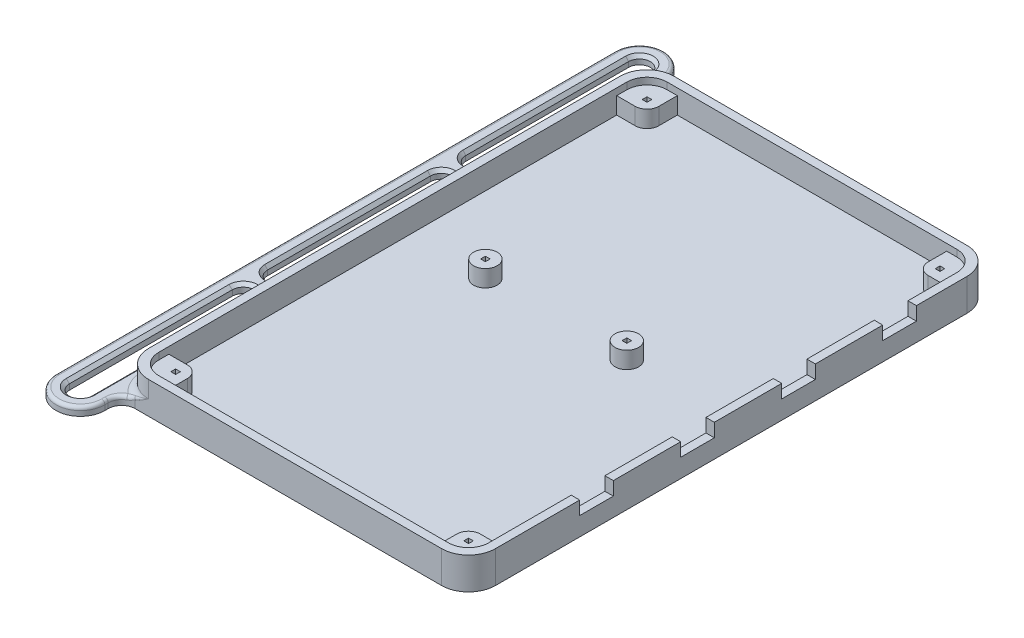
ISO-10303-21;
HEADER;
FILE_DESCRIPTION(('STEP AP214'),'2;1');
FILE_NAME('part.step','',(''),(''),'','','');
FILE_SCHEMA(('AUTOMOTIVE_DESIGN { 1 0 10303 214 1 1 1 1 }'));
ENDSEC;
DATA;
#1=APPLICATION_CONTEXT('core data for automotive mechanical design processes');
#2=APPLICATION_PROTOCOL_DEFINITION('international standard','automotive_design',2000,#1);
#3=PRODUCT_CONTEXT('',#1,'mechanical');
#4=PRODUCT('Part','Part','',(#3));
#5=PRODUCT_RELATED_PRODUCT_CATEGORY('part','',(#4));
#6=PRODUCT_DEFINITION_FORMATION('','',#4);
#7=PRODUCT_DEFINITION_CONTEXT('part definition',#1,'design');
#8=PRODUCT_DEFINITION('design','',#6,#7);
#9=PRODUCT_DEFINITION_SHAPE('','',#8);
#10=(LENGTH_UNIT() NAMED_UNIT(*) SI_UNIT(.MILLI.,.METRE.));
#11=(NAMED_UNIT(*) PLANE_ANGLE_UNIT() SI_UNIT($,.RADIAN.));
#12=(NAMED_UNIT(*) SI_UNIT($,.STERADIAN.) SOLID_ANGLE_UNIT());
#13=UNCERTAINTY_MEASURE_WITH_UNIT(LENGTH_MEASURE(1.E-05),#10,'distance_accuracy_value','');
#14=(GEOMETRIC_REPRESENTATION_CONTEXT(3) GLOBAL_UNCERTAINTY_ASSIGNED_CONTEXT((#13)) GLOBAL_UNIT_ASSIGNED_CONTEXT((#10,
#11,#12)) REPRESENTATION_CONTEXT('',''));
#15=CARTESIAN_POINT('',(0.,0.,0.));
#16=DIRECTION('',(0.,0.,1.));
#17=DIRECTION('',(1.,0.,0.));
#18=AXIS2_PLACEMENT_3D('',#15,#16,#17);
#19=CARTESIAN_POINT('',(0.,7.,0.));
#20=DIRECTION('',(0.,-1.,0.));
#21=DIRECTION('',(0.,0.,-1.));
#22=AXIS2_PLACEMENT_3D('',#19,#20,#21);
#23=PLANE('',#22);
#24=DIRECTION('',(0.,0.,-1.));
#25=VECTOR('',#24,1.);
#26=CARTESIAN_POINT('',(49.,7.,-75.5));
#27=LINE('',#26,#25);
#28=CARTESIAN_POINT('',(49.,7.,-55.));
#29=VERTEX_POINT('',#28);
#30=CARTESIAN_POINT('',(49.,7.,-69.5));
#31=VERTEX_POINT('',#30);
#32=EDGE_CURVE('E826',#29,#31,#27,.T.);
#33=ORIENTED_EDGE('',*,*,#32,.F.);
#34=DIRECTION('',(-1.,0.,0.));
#35=VECTOR('',#34,1.);
#36=CARTESIAN_POINT('',(59.,7.,-55.));
#37=LINE('',#36,#35);
#38=CARTESIAN_POINT('',(51.5,7.,-55.));
#39=VERTEX_POINT('',#38);
#40=EDGE_CURVE('E722',#39,#29,#37,.T.);
#41=ORIENTED_EDGE('',*,*,#40,.F.);
#42=DIRECTION('',(0.,0.,-1.));
#43=VECTOR('',#42,1.);
#44=CARTESIAN_POINT('',(51.5,7.,-78.));
#45=LINE('',#44,#43);
#46=CARTESIAN_POINT('',(51.5,7.,-70.));
#47=VERTEX_POINT('',#46);
#48=EDGE_CURVE('E831',#39,#47,#45,.T.);
#49=ORIENTED_EDGE('',*,*,#48,.T.);
#50=CARTESIAN_POINT('',(43.5,7.,-70.));
#51=DIRECTION('',(0.,-1.,0.));
#52=DIRECTION('',(0.,0.,-1.));
#53=AXIS2_PLACEMENT_3D('',#50,#51,#52);
#54=CIRCLE('',#53,8.);
#55=CARTESIAN_POINT('',(43.5,7.,-78.));
#56=VERTEX_POINT('',#55);
#57=EDGE_CURVE('E1418',#47,#56,#54,.F.);
#58=ORIENTED_EDGE('',*,*,#57,.T.);
#59=DIRECTION('',(-1.,0.,0.));
#60=VECTOR('',#59,1.);
#61=CARTESIAN_POINT('',(51.5,7.,-78.));
#62=LINE('',#61,#60);
#63=CARTESIAN_POINT('',(-43.5,7.,-78.));
#64=VERTEX_POINT('',#63);
#65=EDGE_CURVE('E852',#56,#64,#62,.T.);
#66=ORIENTED_EDGE('',*,*,#65,.T.);
#67=CARTESIAN_POINT('',(-43.5,7.,-70.));
#68=DIRECTION('',(0.,-1.,0.));
#69=DIRECTION('',(0.,0.,-1.));
#70=AXIS2_PLACEMENT_3D('',#67,#68,#69);
#71=CIRCLE('',#70,8.);
#72=CARTESIAN_POINT('',(-51.5,7.,-70.));
#73=VERTEX_POINT('',#72);
#74=EDGE_CURVE('E1441',#64,#73,#71,.F.);
#75=ORIENTED_EDGE('',*,*,#74,.T.);
#76=DIRECTION('',(0.,0.,1.));
#77=VECTOR('',#76,1.);
#78=CARTESIAN_POINT('',(-51.5,7.,-78.));
#79=LINE('',#78,#77);
#80=CARTESIAN_POINT('',(-51.5,7.,70.));
#81=VERTEX_POINT('',#80);
#82=EDGE_CURVE('E857',#73,#81,#79,.T.);
#83=ORIENTED_EDGE('',*,*,#82,.T.);
#84=CARTESIAN_POINT('',(-43.5,7.,70.));
#85=DIRECTION('',(0.,-1.,0.));
#86=DIRECTION('',(0.,0.,-1.));
#87=AXIS2_PLACEMENT_3D('',#84,#85,#86);
#88=CIRCLE('',#87,8.);
#89=CARTESIAN_POINT('',(-43.5,7.,78.));
#90=VERTEX_POINT('',#89);
#91=EDGE_CURVE('E1451',#81,#90,#88,.F.);
#92=ORIENTED_EDGE('',*,*,#91,.T.);
#93=DIRECTION('',(1.,0.,0.));
#94=VECTOR('',#93,1.);
#95=CARTESIAN_POINT('',(51.5,7.,78.));
#96=LINE('',#95,#94);
#97=CARTESIAN_POINT('',(43.5,7.,78.));
#98=VERTEX_POINT('',#97);
#99=EDGE_CURVE('E861',#90,#98,#96,.T.);
#100=ORIENTED_EDGE('',*,*,#99,.T.);
#101=CARTESIAN_POINT('',(43.5,7.,70.));
#102=DIRECTION('',(0.,-1.,0.));
#103=DIRECTION('',(0.,0.,-1.));
#104=AXIS2_PLACEMENT_3D('',#101,#102,#103);
#105=CIRCLE('',#104,8.);
#106=CARTESIAN_POINT('',(51.5,7.,70.));
#107=VERTEX_POINT('',#106);
#108=EDGE_CURVE('E1415',#98,#107,#105,.F.);
#109=ORIENTED_EDGE('',*,*,#108,.T.);
#110=CARTESIAN_POINT('',(51.5,7.,45.));
#111=VERTEX_POINT('',#110);
#112=EDGE_CURVE('E848',#107,#111,#45,.T.);
#113=ORIENTED_EDGE('',*,*,#112,.T.);
#114=DIRECTION('',(-1.,0.,0.));
#115=VECTOR('',#114,1.);
#116=CARTESIAN_POINT('',(59.,7.,45.));
#117=LINE('',#116,#115);
#118=CARTESIAN_POINT('',(49.,7.,45.));
#119=VERTEX_POINT('',#118);
#120=EDGE_CURVE('E804',#111,#119,#117,.T.);
#121=ORIENTED_EDGE('',*,*,#120,.T.);
#122=CARTESIAN_POINT('',(49.,7.,69.5));
#123=VERTEX_POINT('',#122);
#124=EDGE_CURVE('E827',#123,#119,#27,.T.);
#125=ORIENTED_EDGE('',*,*,#124,.F.);
#126=CARTESIAN_POINT('',(43.,7.,69.5));
#127=DIRECTION('',(0.,-1.,0.));
#128=DIRECTION('',(0.,0.,-1.));
#129=AXIS2_PLACEMENT_3D('',#126,#127,#128);
#130=CIRCLE('',#129,6.);
#131=CARTESIAN_POINT('',(43.,7.,75.5));
#132=VERTEX_POINT('',#131);
#133=EDGE_CURVE('E1843',#123,#132,#130,.T.);
#134=ORIENTED_EDGE('',*,*,#133,.T.);
#135=DIRECTION('',(1.,0.,0.));
#136=VECTOR('',#135,1.);
#137=CARTESIAN_POINT('',(49.,7.,75.5));
#138=LINE('',#137,#136);
#139=CARTESIAN_POINT('',(-43.,7.,75.5));
#140=VERTEX_POINT('',#139);
#141=EDGE_CURVE('E822',#140,#132,#138,.T.);
#142=ORIENTED_EDGE('',*,*,#141,.F.);
#143=CARTESIAN_POINT('',(-43.,7.,69.5));
#144=DIRECTION('',(0.,-1.,0.));
#145=DIRECTION('',(0.,0.,-1.));
#146=AXIS2_PLACEMENT_3D('',#143,#144,#145);
#147=CIRCLE('',#146,6.);
#148=CARTESIAN_POINT('',(-49.,7.,69.5));
#149=VERTEX_POINT('',#148);
#150=EDGE_CURVE('E1840',#140,#149,#147,.T.);
#151=ORIENTED_EDGE('',*,*,#150,.T.);
#152=DIRECTION('',(0.,0.,1.));
#153=VECTOR('',#152,1.);
#154=CARTESIAN_POINT('',(-49.,7.,-75.5));
#155=LINE('',#154,#153);
#156=CARTESIAN_POINT('',(-49.,7.,-69.5));
#157=VERTEX_POINT('',#156);
#158=EDGE_CURVE('E817',#157,#149,#155,.T.);
#159=ORIENTED_EDGE('',*,*,#158,.F.);
#160=CARTESIAN_POINT('',(-43.,7.,-69.5));
#161=DIRECTION('',(0.,-1.,0.));
#162=DIRECTION('',(0.,0.,-1.));
#163=AXIS2_PLACEMENT_3D('',#160,#161,#162);
#164=CIRCLE('',#163,6.);
#165=CARTESIAN_POINT('',(-43.,7.,-75.5));
#166=VERTEX_POINT('',#165);
#167=EDGE_CURVE('E1850',#157,#166,#164,.T.);
#168=ORIENTED_EDGE('',*,*,#167,.T.);
#169=DIRECTION('',(-1.,0.,0.));
#170=VECTOR('',#169,1.);
#171=CARTESIAN_POINT('',(49.,7.,-75.5));
#172=LINE('',#171,#170);
#173=CARTESIAN_POINT('',(43.,7.,-75.5));
#174=VERTEX_POINT('',#173);
#175=EDGE_CURVE('E813',#174,#166,#172,.T.);
#176=ORIENTED_EDGE('',*,*,#175,.F.);
#177=CARTESIAN_POINT('',(43.,7.,-69.5));
#178=DIRECTION('',(0.,-1.,0.));
#179=DIRECTION('',(0.,0.,-1.));
#180=AXIS2_PLACEMENT_3D('',#177,#178,#179);
#181=CIRCLE('',#180,6.);
#182=EDGE_CURVE('E1846',#174,#31,#181,.T.);
#183=ORIENTED_EDGE('',*,*,#182,.T.);
#184=EDGE_LOOP('',(#33,#41,#49,#58,#66,#75,#83,#92,#100,#109,#113,#121,#125,#134,#142,#151,#159,
#168,#176,#183));
#185=FACE_BOUND('',#184,.T.);
#186=ADVANCED_FACE('F84',(#185),#23,.F.);
#187=CARTESIAN_POINT('',(51.5,7.,-25.));
#188=VERTEX_POINT('',#187);
#189=CARTESIAN_POINT('',(51.5,7.,-45.));
#190=VERTEX_POINT('',#189);
#191=EDGE_CURVE('E1896',#188,#190,#45,.T.);
#192=ORIENTED_EDGE('',*,*,#191,.T.);
#193=DIRECTION('',(-1.,0.,0.));
#194=VECTOR('',#193,1.);
#195=CARTESIAN_POINT('',(59.,7.,-45.));
#196=LINE('',#195,#194);
#197=CARTESIAN_POINT('',(49.,7.,-45.));
#198=VERTEX_POINT('',#197);
#199=EDGE_CURVE('E738',#190,#198,#196,.T.);
#200=ORIENTED_EDGE('',*,*,#199,.T.);
#201=CARTESIAN_POINT('',(49.,7.,-25.));
#202=VERTEX_POINT('',#201);
#203=EDGE_CURVE('E2119',#202,#198,#27,.T.);
#204=ORIENTED_EDGE('',*,*,#203,.F.);
#205=DIRECTION('',(-1.,0.,0.));
#206=VECTOR('',#205,1.);
#207=CARTESIAN_POINT('',(59.,7.,-25.));
#208=LINE('',#207,#206);
#209=EDGE_CURVE('E726',#188,#202,#208,.T.);
#210=ORIENTED_EDGE('',*,*,#209,.F.);
#211=EDGE_LOOP('',(#192,#200,#204,#210));
#212=FACE_BOUND('',#211,.T.);
#213=ADVANCED_FACE('F1900',(#212),#23,.F.);
#214=CARTESIAN_POINT('',(51.5,7.,5.));
#215=VERTEX_POINT('',#214);
#216=CARTESIAN_POINT('',(51.5,7.,-15.));
#217=VERTEX_POINT('',#216);
#218=EDGE_CURVE('E1903',#215,#217,#45,.T.);
#219=ORIENTED_EDGE('',*,*,#218,.T.);
#220=DIRECTION('',(-1.,0.,0.));
#221=VECTOR('',#220,1.);
#222=CARTESIAN_POINT('',(59.,7.,-15.));
#223=LINE('',#222,#221);
#224=CARTESIAN_POINT('',(49.,7.,-15.));
#225=VERTEX_POINT('',#224);
#226=EDGE_CURVE('E758',#217,#225,#223,.T.);
#227=ORIENTED_EDGE('',*,*,#226,.T.);
#228=CARTESIAN_POINT('',(49.,7.,5.));
#229=VERTEX_POINT('',#228);
#230=EDGE_CURVE('E2116',#229,#225,#27,.T.);
#231=ORIENTED_EDGE('',*,*,#230,.F.);
#232=DIRECTION('',(-1.,0.,0.));
#233=VECTOR('',#232,1.);
#234=CARTESIAN_POINT('',(59.,7.,5.));
#235=LINE('',#234,#233);
#236=EDGE_CURVE('E749',#215,#229,#235,.T.);
#237=ORIENTED_EDGE('',*,*,#236,.F.);
#238=EDGE_LOOP('',(#219,#227,#231,#237));
#239=FACE_BOUND('',#238,.T.);
#240=ADVANCED_FACE('F2081',(#239),#23,.F.);
#241=CARTESIAN_POINT('',(-43.5,-2.5,70.));
#242=DIRECTION('',(0.,1.,0.));
#243=DIRECTION('',(0.,0.,1.));
#244=AXIS2_PLACEMENT_3D('',#241,#242,#243);
#245=CYLINDRICAL_SURFACE('',#244,8.);
#246=DIRECTION('',(0.,-1.,0.));
#247=VECTOR('',#246,1.);
#248=CARTESIAN_POINT('',(-51.5,-2.5,70.));
#249=LINE('',#248,#247);
#250=CARTESIAN_POINT('',(-51.5,2.,70.));
#251=VERTEX_POINT('',#250);
#252=EDGE_CURVE('E1448',#251,#81,#249,.F.);
#253=ORIENTED_EDGE('',*,*,#252,.F.);
#254=CARTESIAN_POINT('',(-43.5,2.,70.));
#255=DIRECTION('',(0.,-1.,0.));
#256=DIRECTION('',(0.,0.,-1.));
#257=AXIS2_PLACEMENT_3D('',#254,#255,#256);
#258=CIRCLE('',#257,8.);
#259=CARTESIAN_POINT('',(-43.5,2.,78.));
#260=VERTEX_POINT('',#259);
#261=EDGE_CURVE('E1454',#251,#260,#258,.F.);
#262=ORIENTED_EDGE('',*,*,#261,.T.);
#263=DIRECTION('',(0.,-1.,0.));
#264=VECTOR('',#263,1.);
#265=CARTESIAN_POINT('',(-43.5,-2.5,78.));
#266=LINE('',#265,#264);
#267=EDGE_CURVE('E1444',#90,#260,#266,.T.);
#268=ORIENTED_EDGE('',*,*,#267,.F.);
#269=ORIENTED_EDGE('',*,*,#91,.F.);
#270=EDGE_LOOP('',(#253,#262,#268,#269));
#271=FACE_BOUND('',#270,.T.);
#272=ADVANCED_FACE('F2099',(#271),#245,.T.);
#273=CARTESIAN_POINT('',(-43.5,5.,-70.));
#274=DIRECTION('',(0.,1.,0.));
#275=DIRECTION('',(0.,0.,1.));
#276=AXIS2_PLACEMENT_3D('',#273,#274,#275);
#277=CYLINDRICAL_SURFACE('',#276,8.);
#278=DIRECTION('',(0.,-1.,0.));
#279=VECTOR('',#278,1.);
#280=CARTESIAN_POINT('',(-43.5,5.,-78.));
#281=LINE('',#280,#279);
#282=CARTESIAN_POINT('',(-43.5,2.,-78.));
#283=VERTEX_POINT('',#282);
#284=EDGE_CURVE('E1438',#283,#64,#281,.F.);
#285=ORIENTED_EDGE('',*,*,#284,.F.);
#286=CARTESIAN_POINT('',(-43.5,2.,-70.));
#287=DIRECTION('',(0.,-1.,0.));
#288=DIRECTION('',(0.,0.,-1.));
#289=AXIS2_PLACEMENT_3D('',#286,#287,#288);
#290=CIRCLE('',#289,8.);
#291=CARTESIAN_POINT('',(-51.5,2.,-70.));
#292=VERTEX_POINT('',#291);
#293=EDGE_CURVE('E1468',#283,#292,#290,.F.);
#294=ORIENTED_EDGE('',*,*,#293,.T.);
#295=DIRECTION('',(0.,-1.,0.));
#296=VECTOR('',#295,1.);
#297=CARTESIAN_POINT('',(-51.5,5.,-70.));
#298=LINE('',#297,#296);
#299=EDGE_CURVE('E1434',#73,#292,#298,.T.);
#300=ORIENTED_EDGE('',*,*,#299,.F.);
#301=ORIENTED_EDGE('',*,*,#74,.F.);
#302=EDGE_LOOP('',(#285,#294,#300,#301));
#303=FACE_BOUND('',#302,.T.);
#304=ADVANCED_FACE('F2104',(#303),#277,.T.);
#305=CARTESIAN_POINT('',(0.,5.,0.));
#306=DIRECTION('',(0.,1.,0.));
#307=DIRECTION('',(0.,0.,1.));
#308=AXIS2_PLACEMENT_3D('',#305,#306,#307);
#309=PLANE('',#308);
#310=DIRECTION('',(-1.,0.,0.));
#311=VECTOR('',#310,1.);
#312=CARTESIAN_POINT('',(49.,5.,-75.5));
#313=LINE('',#312,#311);
#314=CARTESIAN_POINT('',(-40.,5.,-75.5));
#315=VERTEX_POINT('',#314);
#316=CARTESIAN_POINT('',(-43.,5.,-75.5));
#317=VERTEX_POINT('',#316);
#318=EDGE_CURVE('E837',#315,#317,#313,.T.);
#319=ORIENTED_EDGE('',*,*,#318,.T.);
#320=CARTESIAN_POINT('',(-43.,5.,-69.5));
#321=DIRECTION('',(0.,1.,0.));
#322=DIRECTION('',(0.,0.,1.));
#323=AXIS2_PLACEMENT_3D('',#320,#321,#322);
#324=CIRCLE('',#323,6.);
#325=CARTESIAN_POINT('',(-49.,5.,-69.5));
#326=VERTEX_POINT('',#325);
#327=EDGE_CURVE('E1837',#317,#326,#324,.T.);
#328=ORIENTED_EDGE('',*,*,#327,.T.);
#329=DIRECTION('',(0.,0.,1.));
#330=VECTOR('',#329,1.);
#331=CARTESIAN_POINT('',(-49.,5.,-75.5));
#332=LINE('',#331,#330);
#333=CARTESIAN_POINT('',(-49.,5.,-66.5));
#334=VERTEX_POINT('',#333);
#335=EDGE_CURVE('E838',#326,#334,#332,.T.);
#336=ORIENTED_EDGE('',*,*,#335,.T.);
#337=DIRECTION('',(-1.,0.,0.));
#338=VECTOR('',#337,1.);
#339=CARTESIAN_POINT('',(-3.35590141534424E-13,5.,-66.5000000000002));
#340=LINE('',#339,#338);
#341=CARTESIAN_POINT('',(-43.5,5.,-66.5));
#342=VERTEX_POINT('',#341);
#343=EDGE_CURVE('E887',#342,#334,#340,.T.);
#344=ORIENTED_EDGE('',*,*,#343,.F.);
#345=CARTESIAN_POINT('',(-43.5,5.,-70.));
#346=DIRECTION('',(0.,1.,0.));
#347=DIRECTION('',(0.,0.,1.));
#348=AXIS2_PLACEMENT_3D('',#345,#346,#347);
#349=CIRCLE('',#348,3.5);
#350=CARTESIAN_POINT('',(-40.,5.,-70.));
#351=VERTEX_POINT('',#350);
#352=EDGE_CURVE('E891',#351,#342,#349,.F.);
#353=ORIENTED_EDGE('',*,*,#352,.F.);
#354=DIRECTION('',(0.,0.,-1.));
#355=VECTOR('',#354,1.);
#356=CARTESIAN_POINT('',(-40.0000000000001,5.,0.));
#357=LINE('',#356,#355);
#358=EDGE_CURVE('E895',#351,#315,#357,.T.);
#359=ORIENTED_EDGE('',*,*,#358,.T.);
#360=EDGE_LOOP('',(#319,#328,#336,#344,#353,#359));
#361=FACE_BOUND('',#360,.T.);
#362=DIRECTION('',(0.,0.,-1.));
#363=VECTOR('',#362,1.);
#364=CARTESIAN_POINT('',(-42.7928932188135,5.,0.));
#365=LINE('',#364,#363);
#366=CARTESIAN_POINT('',(-42.7928932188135,5.,-69.2928932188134));
#367=VERTEX_POINT('',#366);
#368=CARTESIAN_POINT('',(-42.7928932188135,5.,-70.7071067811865));
#369=VERTEX_POINT('',#368);
#370=EDGE_CURVE('E908',#367,#369,#365,.T.);
#371=ORIENTED_EDGE('',*,*,#370,.F.);
#372=DIRECTION('',(-1.,0.,0.));
#373=VECTOR('',#372,1.);
#374=CARTESIAN_POINT('',(0.,5.,-69.2928932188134));
#375=LINE('',#374,#373);
#376=CARTESIAN_POINT('',(-44.2071067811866,5.,-69.2928932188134));
#377=VERTEX_POINT('',#376);
#378=EDGE_CURVE('E912',#367,#377,#375,.T.);
#379=ORIENTED_EDGE('',*,*,#378,.T.);
#380=DIRECTION('',(0.,0.,-1.));
#381=VECTOR('',#380,1.);
#382=CARTESIAN_POINT('',(-44.2071067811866,5.,0.));
#383=LINE('',#382,#381);
#384=CARTESIAN_POINT('',(-44.2071067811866,5.,-70.7071067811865));
#385=VERTEX_POINT('',#384);
#386=EDGE_CURVE('E916',#377,#385,#383,.T.);
#387=ORIENTED_EDGE('',*,*,#386,.T.);
#388=DIRECTION('',(-1.,0.,0.));
#389=VECTOR('',#388,1.);
#390=CARTESIAN_POINT('',(0.,5.,-70.7071067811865));
#391=LINE('',#390,#389);
#392=EDGE_CURVE('E919',#369,#385,#391,.T.);
#393=ORIENTED_EDGE('',*,*,#392,.F.);
#394=EDGE_LOOP('',(#371,#379,#387,#393));
#395=FACE_BOUND('',#394,.T.);
#396=ADVANCED_FACE('F2237',(#361,#395),#309,.T.);
#397=CARTESIAN_POINT('',(-49.,5.,66.5));
#398=VERTEX_POINT('',#397);
#399=CARTESIAN_POINT('',(-49.,5.,69.5));
#400=VERTEX_POINT('',#399);
#401=EDGE_CURVE('E836',#398,#400,#332,.T.);
#402=ORIENTED_EDGE('',*,*,#401,.T.);
#403=CARTESIAN_POINT('',(-43.,5.,69.5));
#404=DIRECTION('',(0.,1.,0.));
#405=DIRECTION('',(0.,0.,1.));
#406=AXIS2_PLACEMENT_3D('',#403,#404,#405);
#407=CIRCLE('',#406,6.);
#408=CARTESIAN_POINT('',(-43.,5.,75.5));
#409=VERTEX_POINT('',#408);
#410=EDGE_CURVE('E1807',#400,#409,#407,.T.);
#411=ORIENTED_EDGE('',*,*,#410,.T.);
#412=DIRECTION('',(1.,0.,0.));
#413=VECTOR('',#412,1.);
#414=CARTESIAN_POINT('',(49.,5.,75.5));
#415=LINE('',#414,#413);
#416=CARTESIAN_POINT('',(-40.,5.,75.5));
#417=VERTEX_POINT('',#416);
#418=EDGE_CURVE('E842',#409,#417,#415,.T.);
#419=ORIENTED_EDGE('',*,*,#418,.T.);
#420=DIRECTION('',(0.,0.,1.));
#421=VECTOR('',#420,1.);
#422=CARTESIAN_POINT('',(-40.0000000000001,5.,0.));
#423=LINE('',#422,#421);
#424=CARTESIAN_POINT('',(-40.,5.,70.));
#425=VERTEX_POINT('',#424);
#426=EDGE_CURVE('E877',#425,#417,#423,.T.);
#427=ORIENTED_EDGE('',*,*,#426,.F.);
#428=CARTESIAN_POINT('',(-43.5,5.,70.));
#429=DIRECTION('',(0.,1.,0.));
#430=DIRECTION('',(0.,0.,1.));
#431=AXIS2_PLACEMENT_3D('',#428,#429,#430);
#432=CIRCLE('',#431,3.5);
#433=CARTESIAN_POINT('',(-43.5,5.,66.5));
#434=VERTEX_POINT('',#433);
#435=EDGE_CURVE('E881',#425,#434,#432,.T.);
#436=ORIENTED_EDGE('',*,*,#435,.T.);
#437=DIRECTION('',(-1.,0.,0.));
#438=VECTOR('',#437,1.);
#439=CARTESIAN_POINT('',(-3.35590141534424E-13,5.,66.5000000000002));
#440=LINE('',#439,#438);
#441=EDGE_CURVE('E884',#434,#398,#440,.T.);
#442=ORIENTED_EDGE('',*,*,#441,.T.);
#443=EDGE_LOOP('',(#402,#411,#419,#427,#436,#442));
#444=FACE_BOUND('',#443,.T.);
#445=DIRECTION('',(0.,0.,1.));
#446=VECTOR('',#445,1.);
#447=CARTESIAN_POINT('',(-42.7928932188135,5.,0.));
#448=LINE('',#447,#446);
#449=CARTESIAN_POINT('',(-42.7928932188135,5.,69.2928932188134));
#450=VERTEX_POINT('',#449);
#451=CARTESIAN_POINT('',(-42.7928932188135,5.,70.7071067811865));
#452=VERTEX_POINT('',#451);
#453=EDGE_CURVE('E938',#450,#452,#448,.T.);
#454=ORIENTED_EDGE('',*,*,#453,.T.);
#455=DIRECTION('',(-1.,0.,0.));
#456=VECTOR('',#455,1.);
#457=CARTESIAN_POINT('',(0.,5.,70.7071067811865));
#458=LINE('',#457,#456);
#459=CARTESIAN_POINT('',(-44.2071067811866,5.,70.7071067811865));
#460=VERTEX_POINT('',#459);
#461=EDGE_CURVE('E942',#452,#460,#458,.T.);
#462=ORIENTED_EDGE('',*,*,#461,.T.);
#463=DIRECTION('',(0.,0.,1.));
#464=VECTOR('',#463,1.);
#465=CARTESIAN_POINT('',(-44.2071067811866,5.,0.));
#466=LINE('',#465,#464);
#467=CARTESIAN_POINT('',(-44.2071067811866,5.,69.2928932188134));
#468=VERTEX_POINT('',#467);
#469=EDGE_CURVE('E945',#468,#460,#466,.T.);
#470=ORIENTED_EDGE('',*,*,#469,.F.);
#471=DIRECTION('',(-1.,0.,0.));
#472=VECTOR('',#471,1.);
#473=CARTESIAN_POINT('',(0.,5.,69.2928932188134));
#474=LINE('',#473,#472);
#475=EDGE_CURVE('E949',#450,#468,#474,.T.);
#476=ORIENTED_EDGE('',*,*,#475,.F.);
#477=EDGE_LOOP('',(#454,#462,#470,#476));
#478=FACE_BOUND('',#477,.T.);
#479=ADVANCED_FACE('F2242',(#444,#478),#309,.T.);
#480=DIRECTION('',(0.,0.,-1.));
#481=VECTOR('',#480,1.);
#482=CARTESIAN_POINT('',(49.,5.,-75.5));
#483=LINE('',#482,#481);
#484=CARTESIAN_POINT('',(49.,5.,-66.5));
#485=VERTEX_POINT('',#484);
#486=CARTESIAN_POINT('',(49.,5.,-69.5));
#487=VERTEX_POINT('',#486);
#488=EDGE_CURVE('E845',#485,#487,#483,.T.);
#489=ORIENTED_EDGE('',*,*,#488,.T.);
#490=CARTESIAN_POINT('',(43.,5.,-69.5));
#491=DIRECTION('',(0.,1.,0.));
#492=DIRECTION('',(0.,0.,1.));
#493=AXIS2_PLACEMENT_3D('',#490,#491,#492);
#494=CIRCLE('',#493,6.);
#495=CARTESIAN_POINT('',(43.,5.,-75.5));
#496=VERTEX_POINT('',#495);
#497=EDGE_CURVE('E1827',#487,#496,#494,.T.);
#498=ORIENTED_EDGE('',*,*,#497,.T.);
#499=CARTESIAN_POINT('',(40.,5.,-75.5));
#500=VERTEX_POINT('',#499);
#501=EDGE_CURVE('E833',#496,#500,#313,.T.);
#502=ORIENTED_EDGE('',*,*,#501,.T.);
#503=DIRECTION('',(0.,0.,-1.));
#504=VECTOR('',#503,1.);
#505=CARTESIAN_POINT('',(40.0000000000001,5.,0.));
#506=LINE('',#505,#504);
#507=CARTESIAN_POINT('',(40.,5.,-70.));
#508=VERTEX_POINT('',#507);
#509=EDGE_CURVE('E898',#508,#500,#506,.T.);
#510=ORIENTED_EDGE('',*,*,#509,.F.);
#511=CARTESIAN_POINT('',(43.5,5.,-70.));
#512=DIRECTION('',(0.,1.,0.));
#513=DIRECTION('',(0.,0.,1.));
#514=AXIS2_PLACEMENT_3D('',#511,#512,#513);
#515=CIRCLE('',#514,3.5);
#516=CARTESIAN_POINT('',(43.5,5.,-66.5));
#517=VERTEX_POINT('',#516);
#518=EDGE_CURVE('E902',#508,#517,#515,.T.);
#519=ORIENTED_EDGE('',*,*,#518,.T.);
#520=DIRECTION('',(1.,0.,0.));
#521=VECTOR('',#520,1.);
#522=CARTESIAN_POINT('',(3.35590141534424E-13,5.,-66.5000000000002));
#523=LINE('',#522,#521);
#524=EDGE_CURVE('E905',#517,#485,#523,.T.);
#525=ORIENTED_EDGE('',*,*,#524,.T.);
#526=EDGE_LOOP('',(#489,#498,#502,#510,#519,#525));
#527=FACE_BOUND('',#526,.T.);
#528=DIRECTION('',(0.,0.,-1.));
#529=VECTOR('',#528,1.);
#530=CARTESIAN_POINT('',(44.2071067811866,5.,0.));
#531=LINE('',#530,#529);
#532=CARTESIAN_POINT('',(44.2071067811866,5.,-69.2928932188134));
#533=VERTEX_POINT('',#532);
#534=CARTESIAN_POINT('',(44.2071067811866,5.,-70.7071067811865));
#535=VERTEX_POINT('',#534);
#536=EDGE_CURVE('E923',#533,#535,#531,.T.);
#537=ORIENTED_EDGE('',*,*,#536,.F.);
#538=DIRECTION('',(1.,0.,0.));
#539=VECTOR('',#538,1.);
#540=CARTESIAN_POINT('',(0.,5.,-69.2928932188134));
#541=LINE('',#540,#539);
#542=CARTESIAN_POINT('',(42.7928932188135,5.,-69.2928932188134));
#543=VERTEX_POINT('',#542);
#544=EDGE_CURVE('E927',#543,#533,#541,.T.);
#545=ORIENTED_EDGE('',*,*,#544,.F.);
#546=DIRECTION('',(0.,0.,-1.));
#547=VECTOR('',#546,1.);
#548=CARTESIAN_POINT('',(42.7928932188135,5.,0.));
#549=LINE('',#548,#547);
#550=CARTESIAN_POINT('',(42.7928932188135,5.,-70.7071067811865));
#551=VERTEX_POINT('',#550);
#552=EDGE_CURVE('E931',#543,#551,#549,.T.);
#553=ORIENTED_EDGE('',*,*,#552,.T.);
#554=DIRECTION('',(1.,0.,0.));
#555=VECTOR('',#554,1.);
#556=CARTESIAN_POINT('',(0.,5.,-70.7071067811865));
#557=LINE('',#556,#555);
#558=EDGE_CURVE('E935',#551,#535,#557,.T.);
#559=ORIENTED_EDGE('',*,*,#558,.T.);
#560=EDGE_LOOP('',(#537,#545,#553,#559));
#561=FACE_BOUND('',#560,.T.);
#562=ADVANCED_FACE('F2134',(#527,#561),#309,.T.);
#563=CARTESIAN_POINT('',(0.,0.,0.));
#564=DIRECTION('',(0.,-1.,0.));
#565=DIRECTION('',(0.,0.,-1.));
#566=AXIS2_PLACEMENT_3D('',#563,#564,#565);
#567=PLANE('',#566);
#568=DIRECTION('',(1.,0.,0.));
#569=VECTOR('',#568,1.);
#570=CARTESIAN_POINT('',(3.35590141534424E-13,0.,66.5000000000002));
#571=LINE('',#570,#569);
#572=CARTESIAN_POINT('',(43.5,0.,66.5));
#573=VERTEX_POINT('',#572);
#574=CARTESIAN_POINT('',(49.,0.,66.5));
#575=VERTEX_POINT('',#574);
#576=EDGE_CURVE('E971',#573,#575,#571,.T.);
#577=ORIENTED_EDGE('',*,*,#576,.T.);
#578=DIRECTION('',(0.,0.,-1.));
#579=VECTOR('',#578,1.);
#580=CARTESIAN_POINT('',(49.,0.,0.));
#581=LINE('',#580,#579);
#582=CARTESIAN_POINT('',(49.,0.,-66.5));
#583=VERTEX_POINT('',#582);
#584=EDGE_CURVE('E864',#575,#583,#581,.T.);
#585=ORIENTED_EDGE('',*,*,#584,.T.);
#586=DIRECTION('',(1.,0.,0.));
#587=VECTOR('',#586,1.);
#588=CARTESIAN_POINT('',(3.35590141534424E-13,0.,-66.5000000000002));
#589=LINE('',#588,#587);
#590=CARTESIAN_POINT('',(43.5,0.,-66.5));
#591=VERTEX_POINT('',#590);
#592=EDGE_CURVE('E1020',#591,#583,#589,.T.);
#593=ORIENTED_EDGE('',*,*,#592,.F.);
#594=CARTESIAN_POINT('',(43.5,0.,-70.));
#595=DIRECTION('',(0.,1.,0.));
#596=DIRECTION('',(0.,0.,1.));
#597=AXIS2_PLACEMENT_3D('',#594,#595,#596);
#598=CIRCLE('',#597,3.5);
#599=CARTESIAN_POINT('',(40.,0.,-70.));
#600=VERTEX_POINT('',#599);
#601=EDGE_CURVE('E1016',#600,#591,#598,.T.);
#602=ORIENTED_EDGE('',*,*,#601,.F.);
#603=DIRECTION('',(0.,0.,-1.));
#604=VECTOR('',#603,1.);
#605=CARTESIAN_POINT('',(40.0000000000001,0.,0.));
#606=LINE('',#605,#604);
#607=CARTESIAN_POINT('',(40.,0.,-75.5));
#608=VERTEX_POINT('',#607);
#609=EDGE_CURVE('E1013',#600,#608,#606,.T.);
#610=ORIENTED_EDGE('',*,*,#609,.T.);
#611=DIRECTION('',(1.,0.,0.));
#612=VECTOR('',#611,1.);
#613=CARTESIAN_POINT('',(0.,0.,-75.5));
#614=LINE('',#613,#612);
#615=CARTESIAN_POINT('',(-40.,0.,-75.5));
#616=VERTEX_POINT('',#615);
#617=EDGE_CURVE('E1009',#616,#608,#614,.T.);
#618=ORIENTED_EDGE('',*,*,#617,.F.);
#619=DIRECTION('',(0.,0.,-1.));
#620=VECTOR('',#619,1.);
#621=CARTESIAN_POINT('',(-40.0000000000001,0.,0.));
#622=LINE('',#621,#620);
#623=CARTESIAN_POINT('',(-40.,0.,-70.));
#624=VERTEX_POINT('',#623);
#625=EDGE_CURVE('E1005',#624,#616,#622,.T.);
#626=ORIENTED_EDGE('',*,*,#625,.F.);
#627=CARTESIAN_POINT('',(-43.5,0.,-70.));
#628=DIRECTION('',(0.,1.,0.));
#629=DIRECTION('',(0.,0.,1.));
#630=AXIS2_PLACEMENT_3D('',#627,#628,#629);
#631=CIRCLE('',#630,3.5);
#632=CARTESIAN_POINT('',(-43.5,0.,-66.5));
#633=VERTEX_POINT('',#632);
#634=EDGE_CURVE('E1002',#624,#633,#631,.F.);
#635=ORIENTED_EDGE('',*,*,#634,.T.);
#636=DIRECTION('',(-1.,0.,0.));
#637=VECTOR('',#636,1.);
#638=CARTESIAN_POINT('',(-3.35590141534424E-13,0.,-66.5000000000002));
#639=LINE('',#638,#637);
#640=CARTESIAN_POINT('',(-49.,0.,-66.5));
#641=VERTEX_POINT('',#640);
#642=EDGE_CURVE('E999',#633,#641,#639,.T.);
#643=ORIENTED_EDGE('',*,*,#642,.T.);
#644=DIRECTION('',(0.,0.,-1.));
#645=VECTOR('',#644,1.);
#646=CARTESIAN_POINT('',(-49.,0.,0.));
#647=LINE('',#646,#645);
#648=CARTESIAN_POINT('',(-49.,0.,66.5));
#649=VERTEX_POINT('',#648);
#650=EDGE_CURVE('E995',#649,#641,#647,.T.);
#651=ORIENTED_EDGE('',*,*,#650,.F.);
#652=DIRECTION('',(-1.,0.,0.));
#653=VECTOR('',#652,1.);
#654=CARTESIAN_POINT('',(-3.35590141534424E-13,0.,66.5000000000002));
#655=LINE('',#654,#653);
#656=CARTESIAN_POINT('',(-43.5,0.,66.5));
#657=VERTEX_POINT('',#656);
#658=EDGE_CURVE('E991',#657,#649,#655,.T.);
#659=ORIENTED_EDGE('',*,*,#658,.F.);
#660=CARTESIAN_POINT('',(-43.5,0.,70.));
#661=DIRECTION('',(0.,1.,0.));
#662=DIRECTION('',(0.,0.,1.));
#663=AXIS2_PLACEMENT_3D('',#660,#661,#662);
#664=CIRCLE('',#663,3.5);
#665=CARTESIAN_POINT('',(-40.,0.,70.));
#666=VERTEX_POINT('',#665);
#667=EDGE_CURVE('E987',#666,#657,#664,.T.);
#668=ORIENTED_EDGE('',*,*,#667,.F.);
#669=DIRECTION('',(0.,0.,1.));
#670=VECTOR('',#669,1.);
#671=CARTESIAN_POINT('',(-40.0000000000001,0.,0.));
#672=LINE('',#671,#670);
#673=CARTESIAN_POINT('',(-40.,0.,75.5));
#674=VERTEX_POINT('',#673);
#675=EDGE_CURVE('E984',#666,#674,#672,.T.);
#676=ORIENTED_EDGE('',*,*,#675,.T.);
#677=DIRECTION('',(1.,0.,0.));
#678=VECTOR('',#677,1.);
#679=CARTESIAN_POINT('',(0.,0.,75.5));
#680=LINE('',#679,#678);
#681=CARTESIAN_POINT('',(40.,0.,75.5));
#682=VERTEX_POINT('',#681);
#683=EDGE_CURVE('E981',#674,#682,#680,.T.);
#684=ORIENTED_EDGE('',*,*,#683,.T.);
#685=DIRECTION('',(0.,0.,1.));
#686=VECTOR('',#685,1.);
#687=CARTESIAN_POINT('',(40.0000000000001,0.,0.));
#688=LINE('',#687,#686);
#689=CARTESIAN_POINT('',(40.,0.,70.));
#690=VERTEX_POINT('',#689);
#691=EDGE_CURVE('E977',#690,#682,#688,.T.);
#692=ORIENTED_EDGE('',*,*,#691,.F.);
#693=CARTESIAN_POINT('',(43.5,0.,70.));
#694=DIRECTION('',(0.,1.,0.));
#695=DIRECTION('',(0.,0.,1.));
#696=AXIS2_PLACEMENT_3D('',#693,#694,#695);
#697=CIRCLE('',#696,3.5);
#698=EDGE_CURVE('E974',#690,#573,#697,.F.);
#699=ORIENTED_EDGE('',*,*,#698,.T.);
#700=EDGE_LOOP('',(#577,#585,#593,#602,#610,#618,#626,#635,#643,#651,#659,#668,#676,#684,#692,#699));
#701=FACE_BOUND('',#700,.T.);
#702=CARTESIAN_POINT('',(15.5,0.,-4.99999999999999));
#703=DIRECTION('',(0.,1.,0.));
#704=DIRECTION('',(0.,0.,1.));
#705=AXIS2_PLACEMENT_3D('',#702,#703,#704);
#706=CIRCLE('',#705,3.5);
#707=CARTESIAN_POINT('',(15.5,0.,-1.49999999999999));
#708=VERTEX_POINT('',#707);
#709=EDGE_CURVE('E1291',#708,#708,#706,.T.);
#710=ORIENTED_EDGE('',*,*,#709,.F.);
#711=EDGE_LOOP('',(#710));
#712=FACE_BOUND('',#711,.T.);
#713=ADVANCED_FACE('F2355',(#701,#712),#567,.F.);
#714=CARTESIAN_POINT('',(16.2071067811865,5.,0.));
#715=DIRECTION('',(-1.,0.,0.));
#716=DIRECTION('',(0.,0.,1.));
#717=AXIS2_PLACEMENT_3D('',#714,#715,#716);
#718=PLANE('',#717);
#719=DIRECTION('',(0.,0.,-1.));
#720=VECTOR('',#719,1.);
#721=CARTESIAN_POINT('',(16.2071067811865,0.,0.));
#722=LINE('',#721,#720);
#723=CARTESIAN_POINT('',(16.2071067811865,0.,-4.29289321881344));
#724=VERTEX_POINT('',#723);
#725=CARTESIAN_POINT('',(16.2071067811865,0.,-5.70710678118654));
#726=VERTEX_POINT('',#725);
#727=EDGE_CURVE('E1358',#724,#726,#722,.T.);
#728=ORIENTED_EDGE('',*,*,#727,.F.);
#729=DIRECTION('',(0.,-1.,0.));
#730=VECTOR('',#729,1.);
#731=CARTESIAN_POINT('',(16.2071067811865,5.,-4.29289321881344));
#732=LINE('',#731,#730);
#733=CARTESIAN_POINT('',(16.2071067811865,5.,-4.29289321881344));
#734=VERTEX_POINT('',#733);
#735=EDGE_CURVE('E1384',#734,#724,#732,.T.);
#736=ORIENTED_EDGE('',*,*,#735,.F.);
#737=DIRECTION('',(0.,0.,-1.));
#738=VECTOR('',#737,1.);
#739=CARTESIAN_POINT('',(16.2071067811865,5.,0.));
#740=LINE('',#739,#738);
#741=CARTESIAN_POINT('',(16.2071067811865,5.,-5.70710678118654));
#742=VERTEX_POINT('',#741);
#743=EDGE_CURVE('E1338',#734,#742,#740,.T.);
#744=ORIENTED_EDGE('',*,*,#743,.T.);
#745=DIRECTION('',(0.,-1.,0.));
#746=VECTOR('',#745,1.);
#747=CARTESIAN_POINT('',(16.2071067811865,5.,-5.70710678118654));
#748=LINE('',#747,#746);
#749=EDGE_CURVE('E1357',#742,#726,#748,.T.);
#750=ORIENTED_EDGE('',*,*,#749,.T.);
#751=EDGE_LOOP('',(#728,#736,#744,#750));
#752=FACE_BOUND('',#751,.T.);
#753=ADVANCED_FACE('F2377',(#752),#718,.T.);
#754=CARTESIAN_POINT('',(0.,5.,-4.29289321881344));
#755=DIRECTION('',(0.,0.,-1.));
#756=DIRECTION('',(-1.,0.,0.));
#757=AXIS2_PLACEMENT_3D('',#754,#755,#756);
#758=PLANE('',#757);
#759=DIRECTION('',(1.,0.,0.));
#760=VECTOR('',#759,1.);
#761=CARTESIAN_POINT('',(0.,0.,-4.29289321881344));
#762=LINE('',#761,#760);
#763=CARTESIAN_POINT('',(14.7928932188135,0.,-4.29289321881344));
#764=VERTEX_POINT('',#763);
#765=EDGE_CURVE('E1362',#764,#724,#762,.T.);
#766=ORIENTED_EDGE('',*,*,#765,.F.);
#767=DIRECTION('',(0.,-1.,0.));
#768=VECTOR('',#767,1.);
#769=CARTESIAN_POINT('',(14.7928932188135,5.,-4.29289321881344));
#770=LINE('',#769,#768);
#771=CARTESIAN_POINT('',(14.7928932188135,5.,-4.29289321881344));
#772=VERTEX_POINT('',#771);
#773=EDGE_CURVE('E1381',#772,#764,#770,.T.);
#774=ORIENTED_EDGE('',*,*,#773,.F.);
#775=DIRECTION('',(1.,0.,0.));
#776=VECTOR('',#775,1.);
#777=CARTESIAN_POINT('',(0.,5.,-4.29289321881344));
#778=LINE('',#777,#776);
#779=EDGE_CURVE('E1342',#772,#734,#778,.T.);
#780=ORIENTED_EDGE('',*,*,#779,.T.);
#781=ORIENTED_EDGE('',*,*,#735,.T.);
#782=EDGE_LOOP('',(#766,#774,#780,#781));
#783=FACE_BOUND('',#782,.T.);
#784=ADVANCED_FACE('F2501',(#783),#758,.T.);
#785=CARTESIAN_POINT('',(14.7928932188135,5.,0.));
#786=DIRECTION('',(-1.,0.,0.));
#787=DIRECTION('',(0.,0.,1.));
#788=AXIS2_PLACEMENT_3D('',#785,#786,#787);
#789=PLANE('',#788);
#790=DIRECTION('',(0.,0.,-1.));
#791=VECTOR('',#790,1.);
#792=CARTESIAN_POINT('',(14.7928932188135,0.,0.));
#793=LINE('',#792,#791);
#794=CARTESIAN_POINT('',(14.7928932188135,0.,-5.70710678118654));
#795=VERTEX_POINT('',#794);
#796=EDGE_CURVE('E1366',#764,#795,#793,.T.);
#797=ORIENTED_EDGE('',*,*,#796,.T.);
#798=DIRECTION('',(0.,-1.,0.));
#799=VECTOR('',#798,1.);
#800=CARTESIAN_POINT('',(14.7928932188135,5.,-5.70710678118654));
#801=LINE('',#800,#799);
#802=CARTESIAN_POINT('',(14.7928932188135,5.,-5.70710678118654));
#803=VERTEX_POINT('',#802);
#804=EDGE_CURVE('E1377',#803,#795,#801,.T.);
#805=ORIENTED_EDGE('',*,*,#804,.F.);
#806=DIRECTION('',(0.,0.,-1.));
#807=VECTOR('',#806,1.);
#808=CARTESIAN_POINT('',(14.7928932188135,5.,0.));
#809=LINE('',#808,#807);
#810=EDGE_CURVE('E1347',#772,#803,#809,.T.);
#811=ORIENTED_EDGE('',*,*,#810,.F.);
#812=ORIENTED_EDGE('',*,*,#773,.T.);
#813=EDGE_LOOP('',(#797,#805,#811,#812));
#814=FACE_BOUND('',#813,.T.);
#815=ADVANCED_FACE('F2489',(#814),#789,.F.);
#816=CARTESIAN_POINT('',(0.,5.,-5.70710678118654));
#817=DIRECTION('',(0.,0.,-1.));
#818=DIRECTION('',(-1.,0.,0.));
#819=AXIS2_PLACEMENT_3D('',#816,#817,#818);
#820=PLANE('',#819);
#821=DIRECTION('',(1.,0.,0.));
#822=VECTOR('',#821,1.);
#823=CARTESIAN_POINT('',(0.,0.,-5.70710678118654));
#824=LINE('',#823,#822);
#825=EDGE_CURVE('E1343',#795,#726,#824,.T.);
#826=ORIENTED_EDGE('',*,*,#825,.T.);
#827=ORIENTED_EDGE('',*,*,#749,.F.);
#828=DIRECTION('',(1.,0.,0.));
#829=VECTOR('',#828,1.);
#830=CARTESIAN_POINT('',(0.,5.,-5.70710678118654));
#831=LINE('',#830,#829);
#832=EDGE_CURVE('E1350',#803,#742,#831,.T.);
#833=ORIENTED_EDGE('',*,*,#832,.F.);
#834=ORIENTED_EDGE('',*,*,#804,.T.);
#835=EDGE_LOOP('',(#826,#827,#833,#834));
#836=FACE_BOUND('',#835,.T.);
#837=ADVANCED_FACE('F2483',(#836),#820,.F.);
#838=CARTESIAN_POINT('',(15.5,5.,-4.99999999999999));
#839=DIRECTION('',(0.,-1.,0.));
#840=DIRECTION('',(0.,0.,-1.));
#841=AXIS2_PLACEMENT_3D('',#838,#839,#840);
#842=CYLINDRICAL_SURFACE('',#841,3.5);
#843=CARTESIAN_POINT('',(15.5,5.,-4.99999999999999));
#844=DIRECTION('',(0.,1.,0.));
#845=DIRECTION('',(0.,0.,1.));
#846=AXIS2_PLACEMENT_3D('',#843,#844,#845);
#847=CIRCLE('',#846,3.5);
#848=CARTESIAN_POINT('',(15.5,5.,-1.49999999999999));
#849=VERTEX_POINT('',#848);
#850=EDGE_CURVE('E1353',#849,#849,#847,.T.);
#851=ORIENTED_EDGE('',*,*,#850,.F.);
#852=EDGE_LOOP('',(#851));
#853=FACE_BOUND('',#852,.T.);
#854=ORIENTED_EDGE('',*,*,#709,.T.);
#855=EDGE_LOOP('',(#854));
#856=FACE_BOUND('',#855,.T.);
#857=ADVANCED_FACE('F2488',(#853,#856),#842,.T.);
#858=CARTESIAN_POINT('',(0.,5.,0.));
#859=DIRECTION('',(0.,1.,0.));
#860=DIRECTION('',(0.,0.,1.));
#861=AXIS2_PLACEMENT_3D('',#858,#859,#860);
#862=PLANE('',#861);
#863=ORIENTED_EDGE('',*,*,#743,.F.);
#864=ORIENTED_EDGE('',*,*,#779,.F.);
#865=ORIENTED_EDGE('',*,*,#810,.T.);
#866=ORIENTED_EDGE('',*,*,#832,.T.);
#867=EDGE_LOOP('',(#863,#864,#865,#866));
#868=FACE_BOUND('',#867,.T.);
#869=ORIENTED_EDGE('',*,*,#850,.T.);
#870=EDGE_LOOP('',(#869));
#871=FACE_BOUND('',#870,.T.);
#872=ADVANCED_FACE('F2475',(#868,#871),#862,.T.);
#873=ORIENTED_EDGE('',*,*,#765,.T.);
#874=ORIENTED_EDGE('',*,*,#727,.T.);
#875=ORIENTED_EDGE('',*,*,#825,.F.);
#876=ORIENTED_EDGE('',*,*,#796,.F.);
#877=EDGE_LOOP('',(#873,#874,#875,#876));
#878=FACE_BOUND('',#877,.T.);
#879=ADVANCED_FACE('F2342',(#878),#567,.F.);
#880=CARTESIAN_POINT('',(42.7928932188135,5.,0.));
#881=DIRECTION('',(1.,0.,0.));
#882=DIRECTION('',(0.,0.,-1.));
#883=AXIS2_PLACEMENT_3D('',#880,#881,#882);
#884=PLANE('',#883);
#885=DIRECTION('',(0.,0.,1.));
#886=VECTOR('',#885,1.);
#887=CARTESIAN_POINT('',(42.7928932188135,0.,0.));
#888=LINE('',#887,#886);
#889=CARTESIAN_POINT('',(42.7928932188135,0.,69.2928932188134));
#890=VERTEX_POINT('',#889);
#891=CARTESIAN_POINT('',(42.7928932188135,0.,70.7071067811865));
#892=VERTEX_POINT('',#891);
#893=EDGE_CURVE('E1069',#890,#892,#888,.T.);
#894=ORIENTED_EDGE('',*,*,#893,.F.);
#895=DIRECTION('',(0.,-1.,0.));
#896=VECTOR('',#895,1.);
#897=CARTESIAN_POINT('',(42.7928932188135,5.,69.2928932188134));
#898=LINE('',#897,#896);
#899=CARTESIAN_POINT('',(42.7928932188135,5.,69.2928932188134));
#900=VERTEX_POINT('',#899);
#901=EDGE_CURVE('E1094',#900,#890,#898,.T.);
#902=ORIENTED_EDGE('',*,*,#901,.F.);
#903=DIRECTION('',(0.,0.,1.));
#904=VECTOR('',#903,1.);
#905=CARTESIAN_POINT('',(42.7928932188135,5.,0.));
#906=LINE('',#905,#904);
#907=CARTESIAN_POINT('',(42.7928932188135,5.,70.7071067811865));
#908=VERTEX_POINT('',#907);
#909=EDGE_CURVE('E953',#900,#908,#906,.T.);
#910=ORIENTED_EDGE('',*,*,#909,.T.);
#911=DIRECTION('',(0.,-1.,0.));
#912=VECTOR('',#911,1.);
#913=CARTESIAN_POINT('',(42.7928932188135,5.,70.7071067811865));
#914=LINE('',#913,#912);
#915=EDGE_CURVE('E1083',#908,#892,#914,.T.);
#916=ORIENTED_EDGE('',*,*,#915,.T.);
#917=EDGE_LOOP('',(#894,#902,#910,#916));
#918=FACE_BOUND('',#917,.T.);
#919=ADVANCED_FACE('F2395',(#918),#884,.T.);
#920=CARTESIAN_POINT('',(0.,5.,69.2928932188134));
#921=DIRECTION('',(0.,0.,-1.));
#922=DIRECTION('',(-1.,0.,0.));
#923=AXIS2_PLACEMENT_3D('',#920,#921,#922);
#924=PLANE('',#923);
#925=DIRECTION('',(1.,0.,0.));
#926=VECTOR('',#925,1.);
#927=CARTESIAN_POINT('',(0.,0.,69.2928932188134));
#928=LINE('',#927,#926);
#929=CARTESIAN_POINT('',(44.2071067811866,0.,69.2928932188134));
#930=VERTEX_POINT('',#929);
#931=EDGE_CURVE('E1073',#890,#930,#928,.T.);
#932=ORIENTED_EDGE('',*,*,#931,.T.);
#933=DIRECTION('',(0.,-1.,0.));
#934=VECTOR('',#933,1.);
#935=CARTESIAN_POINT('',(44.2071067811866,5.,69.2928932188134));
#936=LINE('',#935,#934);
#937=CARTESIAN_POINT('',(44.2071067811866,5.,69.2928932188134));
#938=VERTEX_POINT('',#937);
#939=EDGE_CURVE('E1091',#938,#930,#936,.T.);
#940=ORIENTED_EDGE('',*,*,#939,.F.);
#941=DIRECTION('',(1.,0.,0.));
#942=VECTOR('',#941,1.);
#943=CARTESIAN_POINT('',(0.,5.,69.2928932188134));
#944=LINE('',#943,#942);
#945=EDGE_CURVE('E957',#900,#938,#944,.T.);
#946=ORIENTED_EDGE('',*,*,#945,.F.);
#947=ORIENTED_EDGE('',*,*,#901,.T.);
#948=EDGE_LOOP('',(#932,#940,#946,#947));
#949=FACE_BOUND('',#948,.T.);
#950=ADVANCED_FACE('F2399',(#949),#924,.F.);
#951=CARTESIAN_POINT('',(44.2071067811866,5.,0.));
#952=DIRECTION('',(1.,0.,0.));
#953=DIRECTION('',(0.,0.,-1.));
#954=AXIS2_PLACEMENT_3D('',#951,#952,#953);
#955=PLANE('',#954);
#956=DIRECTION('',(0.,0.,1.));
#957=VECTOR('',#956,1.);
#958=CARTESIAN_POINT('',(44.2071067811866,0.,0.));
#959=LINE('',#958,#957);
#960=CARTESIAN_POINT('',(44.2071067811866,0.,70.7071067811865));
#961=VERTEX_POINT('',#960);
#962=EDGE_CURVE('E1077',#930,#961,#959,.T.);
#963=ORIENTED_EDGE('',*,*,#962,.T.);
#964=DIRECTION('',(0.,-1.,0.));
#965=VECTOR('',#964,1.);
#966=CARTESIAN_POINT('',(44.2071067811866,5.,70.7071067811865));
#967=LINE('',#966,#965);
#968=CARTESIAN_POINT('',(44.2071067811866,5.,70.7071067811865));
#969=VERTEX_POINT('',#968);
#970=EDGE_CURVE('E1086',#969,#961,#967,.T.);
#971=ORIENTED_EDGE('',*,*,#970,.F.);
#972=DIRECTION('',(0.,0.,1.));
#973=VECTOR('',#972,1.);
#974=CARTESIAN_POINT('',(44.2071067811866,5.,0.));
#975=LINE('',#974,#973);
#976=EDGE_CURVE('E961',#938,#969,#975,.T.);
#977=ORIENTED_EDGE('',*,*,#976,.F.);
#978=ORIENTED_EDGE('',*,*,#939,.T.);
#979=EDGE_LOOP('',(#963,#971,#977,#978));
#980=FACE_BOUND('',#979,.T.);
#981=ADVANCED_FACE('F2402',(#980),#955,.F.);
#982=CARTESIAN_POINT('',(-42.7928932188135,5.,0.));
#983=DIRECTION('',(1.,0.,0.));
#984=DIRECTION('',(0.,0.,-1.));
#985=AXIS2_PLACEMENT_3D('',#982,#983,#984);
#986=PLANE('',#985);
#987=DIRECTION('',(0.,0.,1.));
#988=VECTOR('',#987,1.);
#989=CARTESIAN_POINT('',(-42.7928932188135,0.,0.));
#990=LINE('',#989,#988);
#991=CARTESIAN_POINT('',(-42.7928932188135,0.,69.2928932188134));
#992=VERTEX_POINT('',#991);
#993=CARTESIAN_POINT('',(-42.7928932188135,0.,70.7071067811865));
#994=VERTEX_POINT('',#993);
#995=EDGE_CURVE('E1053',#992,#994,#990,.T.);
#996=ORIENTED_EDGE('',*,*,#995,.T.);
#997=DIRECTION('',(0.,-1.,0.));
#998=VECTOR('',#997,1.);
#999=CARTESIAN_POINT('',(-42.7928932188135,5.,70.7071067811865));
#1000=LINE('',#999,#998);
#1001=EDGE_CURVE('E1087',#452,#994,#1000,.T.);
#1002=ORIENTED_EDGE('',*,*,#1001,.F.);
#1003=ORIENTED_EDGE('',*,*,#453,.F.);
#1004=DIRECTION('',(0.,-1.,0.));
#1005=VECTOR('',#1004,1.);
#1006=CARTESIAN_POINT('',(-42.7928932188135,5.,69.2928932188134));
#1007=LINE('',#1006,#1005);
#1008=EDGE_CURVE('E1098',#450,#992,#1007,.T.);
#1009=ORIENTED_EDGE('',*,*,#1008,.T.);
#1010=EDGE_LOOP('',(#996,#1002,#1003,#1009));
#1011=FACE_BOUND('',#1010,.T.);
#1012=ADVANCED_FACE('F2405',(#1011),#986,.F.);
#1013=CARTESIAN_POINT('',(0.,5.,70.7071067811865));
#1014=DIRECTION('',(0.,0.,1.));
#1015=DIRECTION('',(1.,0.,0.));
#1016=AXIS2_PLACEMENT_3D('',#1013,#1014,#1015);
#1017=PLANE('',#1016);
#1018=DIRECTION('',(-1.,0.,0.));
#1019=VECTOR('',#1018,1.);
#1020=CARTESIAN_POINT('',(0.,0.,70.7071067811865));
#1021=LINE('',#1020,#1019);
#1022=CARTESIAN_POINT('',(-44.2071067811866,0.,70.7071067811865));
#1023=VERTEX_POINT('',#1022);
#1024=EDGE_CURVE('E1057',#994,#1023,#1021,.T.);
#1025=ORIENTED_EDGE('',*,*,#1024,.T.);
#1026=DIRECTION('',(0.,-1.,0.));
#1027=VECTOR('',#1026,1.);
#1028=CARTESIAN_POINT('',(-44.2071067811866,5.,70.7071067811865));
#1029=LINE('',#1028,#1027);
#1030=EDGE_CURVE('E1106',#460,#1023,#1029,.T.);
#1031=ORIENTED_EDGE('',*,*,#1030,.F.);
#1032=ORIENTED_EDGE('',*,*,#461,.F.);
#1033=ORIENTED_EDGE('',*,*,#1001,.T.);
#1034=EDGE_LOOP('',(#1025,#1031,#1032,#1033));
#1035=FACE_BOUND('',#1034,.T.);
#1036=ADVANCED_FACE('F2411',(#1035),#1017,.F.);
#1037=CARTESIAN_POINT('',(-44.2071067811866,5.,0.));
#1038=DIRECTION('',(1.,0.,0.));
#1039=DIRECTION('',(0.,0.,-1.));
#1040=AXIS2_PLACEMENT_3D('',#1037,#1038,#1039);
#1041=PLANE('',#1040);
#1042=DIRECTION('',(0.,0.,1.));
#1043=VECTOR('',#1042,1.);
#1044=CARTESIAN_POINT('',(-44.2071067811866,0.,0.));
#1045=LINE('',#1044,#1043);
#1046=CARTESIAN_POINT('',(-44.2071067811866,0.,69.2928932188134));
#1047=VERTEX_POINT('',#1046);
#1048=EDGE_CURVE('E1061',#1047,#1023,#1045,.T.);
#1049=ORIENTED_EDGE('',*,*,#1048,.F.);
#1050=DIRECTION('',(0.,-1.,0.));
#1051=VECTOR('',#1050,1.);
#1052=CARTESIAN_POINT('',(-44.2071067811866,5.,69.2928932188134));
#1053=LINE('',#1052,#1051);
#1054=EDGE_CURVE('E1101',#468,#1047,#1053,.T.);
#1055=ORIENTED_EDGE('',*,*,#1054,.F.);
#1056=ORIENTED_EDGE('',*,*,#469,.T.);
#1057=ORIENTED_EDGE('',*,*,#1030,.T.);
#1058=EDGE_LOOP('',(#1049,#1055,#1056,#1057));
#1059=FACE_BOUND('',#1058,.T.);
#1060=ADVANCED_FACE('F2421',(#1059),#1041,.T.);
#1061=CARTESIAN_POINT('',(44.2071067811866,5.,0.));
#1062=DIRECTION('',(-1.,0.,0.));
#1063=DIRECTION('',(0.,0.,1.));
#1064=AXIS2_PLACEMENT_3D('',#1061,#1062,#1063);
#1065=PLANE('',#1064);
#1066=DIRECTION('',(0.,0.,-1.));
#1067=VECTOR('',#1066,1.);
#1068=CARTESIAN_POINT('',(44.2071067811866,0.,0.));
#1069=LINE('',#1068,#1067);
#1070=CARTESIAN_POINT('',(44.2071067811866,0.,-69.2928932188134));
#1071=VERTEX_POINT('',#1070);
#1072=CARTESIAN_POINT('',(44.2071067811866,0.,-70.7071067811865));
#1073=VERTEX_POINT('',#1072);
#1074=EDGE_CURVE('E1039',#1071,#1073,#1069,.T.);
#1075=ORIENTED_EDGE('',*,*,#1074,.F.);
#1076=DIRECTION('',(0.,-1.,0.));
#1077=VECTOR('',#1076,1.);
#1078=CARTESIAN_POINT('',(44.2071067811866,5.,-69.2928932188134));
#1079=LINE('',#1078,#1077);
#1080=EDGE_CURVE('E1102',#533,#1071,#1079,.T.);
#1081=ORIENTED_EDGE('',*,*,#1080,.F.);
#1082=ORIENTED_EDGE('',*,*,#536,.T.);
#1083=DIRECTION('',(0.,-1.,0.));
#1084=VECTOR('',#1083,1.);
#1085=CARTESIAN_POINT('',(44.2071067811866,5.,-70.7071067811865));
#1086=LINE('',#1085,#1084);
#1087=EDGE_CURVE('E1111',#535,#1073,#1086,.T.);
#1088=ORIENTED_EDGE('',*,*,#1087,.T.);
#1089=EDGE_LOOP('',(#1075,#1081,#1082,#1088));
#1090=FACE_BOUND('',#1089,.T.);
#1091=ADVANCED_FACE('F2262',(#1090),#1065,.T.);
#1092=CARTESIAN_POINT('',(0.,5.,-69.2928932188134));
#1093=DIRECTION('',(0.,0.,-1.));
#1094=DIRECTION('',(-1.,0.,0.));
#1095=AXIS2_PLACEMENT_3D('',#1092,#1093,#1094);
#1096=PLANE('',#1095);
#1097=DIRECTION('',(1.,0.,0.));
#1098=VECTOR('',#1097,1.);
#1099=CARTESIAN_POINT('',(0.,0.,-69.2928932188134));
#1100=LINE('',#1099,#1098);
#1101=CARTESIAN_POINT('',(42.7928932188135,0.,-69.2928932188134));
#1102=VERTEX_POINT('',#1101);
#1103=EDGE_CURVE('E1042',#1102,#1071,#1100,.T.);
#1104=ORIENTED_EDGE('',*,*,#1103,.F.);
#1105=DIRECTION('',(0.,-1.,0.));
#1106=VECTOR('',#1105,1.);
#1107=CARTESIAN_POINT('',(42.7928932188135,5.,-69.2928932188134));
#1108=LINE('',#1107,#1106);
#1109=EDGE_CURVE('E1120',#543,#1102,#1108,.T.);
#1110=ORIENTED_EDGE('',*,*,#1109,.F.);
#1111=ORIENTED_EDGE('',*,*,#544,.T.);
#1112=ORIENTED_EDGE('',*,*,#1080,.T.);
#1113=EDGE_LOOP('',(#1104,#1110,#1111,#1112));
#1114=FACE_BOUND('',#1113,.T.);
#1115=ADVANCED_FACE('F2363',(#1114),#1096,.T.);
#1116=CARTESIAN_POINT('',(42.7928932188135,5.,0.));
#1117=DIRECTION('',(-1.,0.,0.));
#1118=DIRECTION('',(0.,0.,1.));
#1119=AXIS2_PLACEMENT_3D('',#1116,#1117,#1118);
#1120=PLANE('',#1119);
#1121=DIRECTION('',(0.,0.,-1.));
#1122=VECTOR('',#1121,1.);
#1123=CARTESIAN_POINT('',(42.7928932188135,0.,0.));
#1124=LINE('',#1123,#1122);
#1125=CARTESIAN_POINT('',(42.7928932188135,0.,-70.7071067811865));
#1126=VERTEX_POINT('',#1125);
#1127=EDGE_CURVE('E1045',#1102,#1126,#1124,.T.);
#1128=ORIENTED_EDGE('',*,*,#1127,.T.);
#1129=DIRECTION('',(0.,-1.,0.));
#1130=VECTOR('',#1129,1.);
#1131=CARTESIAN_POINT('',(42.7928932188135,5.,-70.7071067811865));
#1132=LINE('',#1131,#1130);
#1133=EDGE_CURVE('E1115',#551,#1126,#1132,.T.);
#1134=ORIENTED_EDGE('',*,*,#1133,.F.);
#1135=ORIENTED_EDGE('',*,*,#552,.F.);
#1136=ORIENTED_EDGE('',*,*,#1109,.T.);
#1137=EDGE_LOOP('',(#1128,#1134,#1135,#1136));
#1138=FACE_BOUND('',#1137,.T.);
#1139=ADVANCED_FACE('F2280',(#1138),#1120,.F.);
#1140=CARTESIAN_POINT('',(-42.7928932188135,5.,0.));
#1141=DIRECTION('',(-1.,0.,0.));
#1142=DIRECTION('',(0.,0.,1.));
#1143=AXIS2_PLACEMENT_3D('',#1140,#1141,#1142);
#1144=PLANE('',#1143);
#1145=DIRECTION('',(0.,0.,-1.));
#1146=VECTOR('',#1145,1.);
#1147=CARTESIAN_POINT('',(-42.7928932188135,0.,0.));
#1148=LINE('',#1147,#1146);
#1149=CARTESIAN_POINT('',(-42.7928932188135,0.,-69.2928932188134));
#1150=VERTEX_POINT('',#1149);
#1151=CARTESIAN_POINT('',(-42.7928932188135,0.,-70.7071067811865));
#1152=VERTEX_POINT('',#1151);
#1153=EDGE_CURVE('E1024',#1150,#1152,#1148,.T.);
#1154=ORIENTED_EDGE('',*,*,#1153,.F.);
#1155=DIRECTION('',(0.,-1.,0.));
#1156=VECTOR('',#1155,1.);
#1157=CARTESIAN_POINT('',(-42.7928932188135,5.,-69.2928932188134));
#1158=LINE('',#1157,#1156);
#1159=EDGE_CURVE('E1116',#367,#1150,#1158,.T.);
#1160=ORIENTED_EDGE('',*,*,#1159,.F.);
#1161=ORIENTED_EDGE('',*,*,#370,.T.);
#1162=DIRECTION('',(0.,-1.,0.));
#1163=VECTOR('',#1162,1.);
#1164=CARTESIAN_POINT('',(-42.7928932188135,5.,-70.7071067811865));
#1165=LINE('',#1164,#1163);
#1166=EDGE_CURVE('E1127',#369,#1152,#1165,.T.);
#1167=ORIENTED_EDGE('',*,*,#1166,.T.);
#1168=EDGE_LOOP('',(#1154,#1160,#1161,#1167));
#1169=FACE_BOUND('',#1168,.T.);
#1170=ADVANCED_FACE('F2276',(#1169),#1144,.T.);
#1171=CARTESIAN_POINT('',(0.,5.,-69.2928932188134));
#1172=DIRECTION('',(0.,0.,1.));
#1173=DIRECTION('',(1.,0.,0.));
#1174=AXIS2_PLACEMENT_3D('',#1171,#1172,#1173);
#1175=PLANE('',#1174);
#1176=DIRECTION('',(-1.,0.,0.));
#1177=VECTOR('',#1176,1.);
#1178=CARTESIAN_POINT('',(0.,0.,-69.2928932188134));
#1179=LINE('',#1178,#1177);
#1180=CARTESIAN_POINT('',(-44.2071067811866,0.,-69.2928932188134));
#1181=VERTEX_POINT('',#1180);
#1182=EDGE_CURVE('E1028',#1150,#1181,#1179,.T.);
#1183=ORIENTED_EDGE('',*,*,#1182,.T.);
#1184=DIRECTION('',(0.,-1.,0.));
#1185=VECTOR('',#1184,1.);
#1186=CARTESIAN_POINT('',(-44.2071067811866,5.,-69.2928932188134));
#1187=LINE('',#1186,#1185);
#1188=EDGE_CURVE('E1135',#377,#1181,#1187,.T.);
#1189=ORIENTED_EDGE('',*,*,#1188,.F.);
#1190=ORIENTED_EDGE('',*,*,#378,.F.);
#1191=ORIENTED_EDGE('',*,*,#1159,.T.);
#1192=EDGE_LOOP('',(#1183,#1189,#1190,#1191));
#1193=FACE_BOUND('',#1192,.T.);
#1194=ADVANCED_FACE('F2272',(#1193),#1175,.F.);
#1195=CARTESIAN_POINT('',(-44.2071067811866,5.,0.));
#1196=DIRECTION('',(-1.,0.,0.));
#1197=DIRECTION('',(0.,0.,1.));
#1198=AXIS2_PLACEMENT_3D('',#1195,#1196,#1197);
#1199=PLANE('',#1198);
#1200=DIRECTION('',(0.,0.,-1.));
#1201=VECTOR('',#1200,1.);
#1202=CARTESIAN_POINT('',(-44.2071067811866,0.,0.));
#1203=LINE('',#1202,#1201);
#1204=CARTESIAN_POINT('',(-44.2071067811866,0.,-70.7071067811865));
#1205=VERTEX_POINT('',#1204);
#1206=EDGE_CURVE('E1032',#1181,#1205,#1203,.T.);
#1207=ORIENTED_EDGE('',*,*,#1206,.T.);
#1208=DIRECTION('',(0.,-1.,0.));
#1209=VECTOR('',#1208,1.);
#1210=CARTESIAN_POINT('',(-44.2071067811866,5.,-70.7071067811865));
#1211=LINE('',#1210,#1209);
#1212=EDGE_CURVE('E1130',#385,#1205,#1211,.T.);
#1213=ORIENTED_EDGE('',*,*,#1212,.F.);
#1214=ORIENTED_EDGE('',*,*,#386,.F.);
#1215=ORIENTED_EDGE('',*,*,#1188,.T.);
#1216=EDGE_LOOP('',(#1207,#1213,#1214,#1215));
#1217=FACE_BOUND('',#1216,.T.);
#1218=ADVANCED_FACE('F2269',(#1217),#1199,.F.);
#1219=CARTESIAN_POINT('',(49.,5.,0.));
#1220=DIRECTION('',(-1.,0.,0.));
#1221=DIRECTION('',(0.,0.,1.));
#1222=AXIS2_PLACEMENT_3D('',#1219,#1220,#1221);
#1223=PLANE('',#1222);
#1224=DIRECTION('',(0.,-1.,0.));
#1225=VECTOR('',#1224,1.);
#1226=CARTESIAN_POINT('',(49.,7.,-55.));
#1227=LINE('',#1226,#1225);
#1228=CARTESIAN_POINT('',(49.,3.,-55.));
#1229=VERTEX_POINT('',#1228);
#1230=EDGE_CURVE('E719',#29,#1229,#1227,.T.);
#1231=ORIENTED_EDGE('',*,*,#1230,.F.);
#1232=ORIENTED_EDGE('',*,*,#32,.T.);
#1233=DIRECTION('',(0.,-1.,0.));
#1234=VECTOR('',#1233,1.);
#1235=CARTESIAN_POINT('',(49.,5.,-69.5));
#1236=LINE('',#1235,#1234);
#1237=EDGE_CURVE('E1820',#31,#487,#1236,.T.);
#1238=ORIENTED_EDGE('',*,*,#1237,.T.);
#1239=ORIENTED_EDGE('',*,*,#488,.F.);
#1240=DIRECTION('',(0.,-1.,0.));
#1241=VECTOR('',#1240,1.);
#1242=CARTESIAN_POINT('',(49.,5.,-66.5));
#1243=LINE('',#1242,#1241);
#1244=EDGE_CURVE('E968',#485,#583,#1243,.T.);
#1245=ORIENTED_EDGE('',*,*,#1244,.T.);
#1246=ORIENTED_EDGE('',*,*,#584,.F.);
#1247=DIRECTION('',(0.,-1.,0.));
#1248=VECTOR('',#1247,1.);
#1249=CARTESIAN_POINT('',(49.,5.,66.5));
#1250=LINE('',#1249,#1248);
#1251=CARTESIAN_POINT('',(49.,5.,66.5));
#1252=VERTEX_POINT('',#1251);
#1253=EDGE_CURVE('E1131',#1252,#575,#1250,.T.);
#1254=ORIENTED_EDGE('',*,*,#1253,.F.);
#1255=CARTESIAN_POINT('',(49.,5.,69.5));
#1256=VERTEX_POINT('',#1255);
#1257=EDGE_CURVE('E818',#1256,#1252,#483,.T.);
#1258=ORIENTED_EDGE('',*,*,#1257,.F.);
#1259=DIRECTION('',(0.,-1.,0.));
#1260=VECTOR('',#1259,1.);
#1261=CARTESIAN_POINT('',(49.,7.,69.5));
#1262=LINE('',#1261,#1260);
#1263=EDGE_CURVE('E1824',#1256,#123,#1262,.F.);
#1264=ORIENTED_EDGE('',*,*,#1263,.T.);
#1265=ORIENTED_EDGE('',*,*,#124,.T.);
#1266=DIRECTION('',(0.,1.,0.));
#1267=VECTOR('',#1266,1.);
#1268=CARTESIAN_POINT('',(49.,7.,45.));
#1269=LINE('',#1268,#1267);
#1270=CARTESIAN_POINT('',(49.,3.,45.));
#1271=VERTEX_POINT('',#1270);
#1272=EDGE_CURVE('E798',#1271,#119,#1269,.T.);
#1273=ORIENTED_EDGE('',*,*,#1272,.F.);
#1274=DIRECTION('',(0.,0.,1.));
#1275=VECTOR('',#1274,1.);
#1276=CARTESIAN_POINT('',(49.,3.,35.));
#1277=LINE('',#1276,#1275);
#1278=CARTESIAN_POINT('',(49.,3.,35.));
#1279=VERTEX_POINT('',#1278);
#1280=EDGE_CURVE('E794',#1279,#1271,#1277,.T.);
#1281=ORIENTED_EDGE('',*,*,#1280,.F.);
#1282=DIRECTION('',(0.,-1.,0.));
#1283=VECTOR('',#1282,1.);
#1284=CARTESIAN_POINT('',(49.,7.,35.));
#1285=LINE('',#1284,#1283);
#1286=CARTESIAN_POINT('',(49.,7.,35.));
#1287=VERTEX_POINT('',#1286);
#1288=EDGE_CURVE('E790',#1287,#1279,#1285,.T.);
#1289=ORIENTED_EDGE('',*,*,#1288,.F.);
#1290=CARTESIAN_POINT('',(49.,7.,15.));
#1291=VERTEX_POINT('',#1290);
#1292=EDGE_CURVE('E832',#1287,#1291,#27,.T.);
#1293=ORIENTED_EDGE('',*,*,#1292,.T.);
#1294=DIRECTION('',(0.,1.,0.));
#1295=VECTOR('',#1294,1.);
#1296=CARTESIAN_POINT('',(49.,7.,15.));
#1297=LINE('',#1296,#1295);
#1298=CARTESIAN_POINT('',(49.,3.,15.));
#1299=VERTEX_POINT('',#1298);
#1300=EDGE_CURVE('E775',#1299,#1291,#1297,.T.);
#1301=ORIENTED_EDGE('',*,*,#1300,.F.);
#1302=DIRECTION('',(0.,0.,1.));
#1303=VECTOR('',#1302,1.);
#1304=CARTESIAN_POINT('',(49.,3.,5.));
#1305=LINE('',#1304,#1303);
#1306=CARTESIAN_POINT('',(49.,3.,5.));
#1307=VERTEX_POINT('',#1306);
#1308=EDGE_CURVE('E770',#1307,#1299,#1305,.T.);
#1309=ORIENTED_EDGE('',*,*,#1308,.F.);
#1310=DIRECTION('',(0.,-1.,0.));
#1311=VECTOR('',#1310,1.);
#1312=CARTESIAN_POINT('',(49.,7.,5.));
#1313=LINE('',#1312,#1311);
#1314=EDGE_CURVE('E766',#229,#1307,#1313,.T.);
#1315=ORIENTED_EDGE('',*,*,#1314,.F.);
#1316=ORIENTED_EDGE('',*,*,#230,.T.);
#1317=DIRECTION('',(0.,1.,0.));
#1318=VECTOR('',#1317,1.);
#1319=CARTESIAN_POINT('',(49.,7.,-15.));
#1320=LINE('',#1319,#1318);
#1321=CARTESIAN_POINT('',(49.,3.,-15.));
#1322=VERTEX_POINT('',#1321);
#1323=EDGE_CURVE('E752',#1322,#225,#1320,.T.);
#1324=ORIENTED_EDGE('',*,*,#1323,.F.);
#1325=DIRECTION('',(0.,0.,1.));
#1326=VECTOR('',#1325,1.);
#1327=CARTESIAN_POINT('',(49.,3.,-25.));
#1328=LINE('',#1327,#1326);
#1329=CARTESIAN_POINT('',(49.,3.,-25.));
#1330=VERTEX_POINT('',#1329);
#1331=EDGE_CURVE('E748',#1330,#1322,#1328,.T.);
#1332=ORIENTED_EDGE('',*,*,#1331,.F.);
#1333=DIRECTION('',(0.,-1.,0.));
#1334=VECTOR('',#1333,1.);
#1335=CARTESIAN_POINT('',(49.,7.,-25.));
#1336=LINE('',#1335,#1334);
#1337=EDGE_CURVE('E744',#202,#1330,#1336,.T.);
#1338=ORIENTED_EDGE('',*,*,#1337,.F.);
#1339=ORIENTED_EDGE('',*,*,#203,.T.);
#1340=DIRECTION('',(0.,1.,0.));
#1341=VECTOR('',#1340,1.);
#1342=CARTESIAN_POINT('',(49.,7.,-45.));
#1343=LINE('',#1342,#1341);
#1344=CARTESIAN_POINT('',(49.,3.,-45.));
#1345=VERTEX_POINT('',#1344);
#1346=EDGE_CURVE('E716',#1345,#198,#1343,.T.);
#1347=ORIENTED_EDGE('',*,*,#1346,.F.);
#1348=DIRECTION('',(0.,0.,1.));
#1349=VECTOR('',#1348,1.);
#1350=CARTESIAN_POINT('',(49.,3.,-55.));
#1351=LINE('',#1350,#1349);
#1352=EDGE_CURVE('E710',#1229,#1345,#1351,.T.);
#1353=ORIENTED_EDGE('',*,*,#1352,.F.);
#1354=EDGE_LOOP('',(#1231,#1232,#1238,#1239,#1245,#1246,#1254,#1258,#1264,#1265,#1273,#1281,
#1289,#1293,#1301,#1309,#1315,#1316,#1324,#1332,#1338,#1339,#1347,#1353));
#1355=FACE_BOUND('',#1354,.T.);
#1356=ADVANCED_FACE('F728',(#1355),#1223,.T.);
#1357=CARTESIAN_POINT('',(3.35590141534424E-13,5.,66.5000000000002));
#1358=DIRECTION('',(0.,0.,-1.));
#1359=DIRECTION('',(-1.,0.,0.));
#1360=AXIS2_PLACEMENT_3D('',#1357,#1358,#1359);
#1361=PLANE('',#1360);
#1362=ORIENTED_EDGE('',*,*,#576,.F.);
#1363=DIRECTION('',(0.,-1.,0.));
#1364=VECTOR('',#1363,1.);
#1365=CARTESIAN_POINT('',(43.5,5.,66.5));
#1366=LINE('',#1365,#1364);
#1367=CARTESIAN_POINT('',(43.5,5.,66.5));
#1368=VERTEX_POINT('',#1367);
#1369=EDGE_CURVE('E1195',#1368,#573,#1366,.T.);
#1370=ORIENTED_EDGE('',*,*,#1369,.F.);
#1371=DIRECTION('',(1.,0.,0.));
#1372=VECTOR('',#1371,1.);
#1373=CARTESIAN_POINT('',(3.35590141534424E-13,5.,66.5000000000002));
#1374=LINE('',#1373,#1372);
#1375=EDGE_CURVE('E865',#1368,#1252,#1374,.T.);
#1376=ORIENTED_EDGE('',*,*,#1375,.T.);
#1377=ORIENTED_EDGE('',*,*,#1253,.T.);
#1378=EDGE_LOOP('',(#1362,#1370,#1376,#1377));
#1379=FACE_BOUND('',#1378,.T.);
#1380=ADVANCED_FACE('F2331',(#1379),#1361,.T.);
#1381=CARTESIAN_POINT('',(43.5,5.,70.));
#1382=DIRECTION('',(0.,-1.,0.));
#1383=DIRECTION('',(0.,0.,-1.));
#1384=AXIS2_PLACEMENT_3D('',#1381,#1382,#1383);
#1385=CYLINDRICAL_SURFACE('',#1384,3.5);
#1386=ORIENTED_EDGE('',*,*,#698,.F.);
#1387=DIRECTION('',(0.,-1.,0.));
#1388=VECTOR('',#1387,1.);
#1389=CARTESIAN_POINT('',(40.,5.,70.));
#1390=LINE('',#1389,#1388);
#1391=CARTESIAN_POINT('',(40.,5.,70.));
#1392=VERTEX_POINT('',#1391);
#1393=EDGE_CURVE('E1191',#1392,#690,#1390,.T.);
#1394=ORIENTED_EDGE('',*,*,#1393,.F.);
#1395=CARTESIAN_POINT('',(43.5,5.,70.));
#1396=DIRECTION('',(0.,1.,0.));
#1397=DIRECTION('',(0.,0.,1.));
#1398=AXIS2_PLACEMENT_3D('',#1395,#1396,#1397);
#1399=CIRCLE('',#1398,3.5);
#1400=EDGE_CURVE('E869',#1392,#1368,#1399,.F.);
#1401=ORIENTED_EDGE('',*,*,#1400,.T.);
#1402=ORIENTED_EDGE('',*,*,#1369,.T.);
#1403=EDGE_LOOP('',(#1386,#1394,#1401,#1402));
#1404=FACE_BOUND('',#1403,.T.);
#1405=ADVANCED_FACE('F2327',(#1404),#1385,.T.);
#1406=CARTESIAN_POINT('',(40.0000000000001,5.,0.));
#1407=DIRECTION('',(1.,0.,0.));
#1408=DIRECTION('',(0.,0.,-1.));
#1409=AXIS2_PLACEMENT_3D('',#1406,#1407,#1408);
#1410=PLANE('',#1409);
#1411=ORIENTED_EDGE('',*,*,#691,.T.);
#1412=DIRECTION('',(0.,-1.,0.));
#1413=VECTOR('',#1412,1.);
#1414=CARTESIAN_POINT('',(40.,5.,75.5));
#1415=LINE('',#1414,#1413);
#1416=CARTESIAN_POINT('',(40.,5.,75.5));
#1417=VERTEX_POINT('',#1416);
#1418=EDGE_CURVE('E1187',#1417,#682,#1415,.T.);
#1419=ORIENTED_EDGE('',*,*,#1418,.F.);
#1420=DIRECTION('',(0.,0.,1.));
#1421=VECTOR('',#1420,1.);
#1422=CARTESIAN_POINT('',(40.0000000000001,5.,0.));
#1423=LINE('',#1422,#1421);
#1424=EDGE_CURVE('E874',#1392,#1417,#1423,.T.);
#1425=ORIENTED_EDGE('',*,*,#1424,.F.);
#1426=ORIENTED_EDGE('',*,*,#1393,.T.);
#1427=EDGE_LOOP('',(#1411,#1419,#1425,#1426));
#1428=FACE_BOUND('',#1427,.T.);
#1429=ADVANCED_FACE('F2323',(#1428),#1410,.F.);
#1430=CARTESIAN_POINT('',(0.,5.,75.5));
#1431=DIRECTION('',(0.,0.,-1.));
#1432=DIRECTION('',(-1.,0.,0.));
#1433=AXIS2_PLACEMENT_3D('',#1430,#1431,#1432);
#1434=PLANE('',#1433);
#1435=ORIENTED_EDGE('',*,*,#418,.F.);
#1436=DIRECTION('',(0.,-1.,0.));
#1437=VECTOR('',#1436,1.);
#1438=CARTESIAN_POINT('',(-43.,5.,75.5));
#1439=LINE('',#1438,#1437);
#1440=EDGE_CURVE('E1814',#409,#140,#1439,.F.);
#1441=ORIENTED_EDGE('',*,*,#1440,.T.);
#1442=ORIENTED_EDGE('',*,*,#141,.T.);
#1443=DIRECTION('',(0.,-1.,0.));
#1444=VECTOR('',#1443,1.);
#1445=CARTESIAN_POINT('',(43.,5.,75.5));
#1446=LINE('',#1445,#1444);
#1447=CARTESIAN_POINT('',(43.,5.,75.5));
#1448=VERTEX_POINT('',#1447);
#1449=EDGE_CURVE('E1810',#132,#1448,#1446,.T.);
#1450=ORIENTED_EDGE('',*,*,#1449,.T.);
#1451=EDGE_CURVE('E841',#1417,#1448,#415,.T.);
#1452=ORIENTED_EDGE('',*,*,#1451,.F.);
#1453=ORIENTED_EDGE('',*,*,#1418,.T.);
#1454=ORIENTED_EDGE('',*,*,#683,.F.);
#1455=DIRECTION('',(0.,-1.,0.));
#1456=VECTOR('',#1455,1.);
#1457=CARTESIAN_POINT('',(-40.,5.,75.5));
#1458=LINE('',#1457,#1456);
#1459=EDGE_CURVE('E1183',#417,#674,#1458,.T.);
#1460=ORIENTED_EDGE('',*,*,#1459,.F.);
#1461=EDGE_LOOP('',(#1435,#1441,#1442,#1450,#1452,#1453,#1454,#1460));
#1462=FACE_BOUND('',#1461,.T.);
#1463=ADVANCED_FACE('F2319',(#1462),#1434,.T.);
#1464=CARTESIAN_POINT('',(-40.0000000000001,5.,0.));
#1465=DIRECTION('',(1.,0.,0.));
#1466=DIRECTION('',(0.,0.,-1.));
#1467=AXIS2_PLACEMENT_3D('',#1464,#1465,#1466);
#1468=PLANE('',#1467);
#1469=ORIENTED_EDGE('',*,*,#675,.F.);
#1470=DIRECTION('',(0.,-1.,0.));
#1471=VECTOR('',#1470,1.);
#1472=CARTESIAN_POINT('',(-40.,5.,70.));
#1473=LINE('',#1472,#1471);
#1474=EDGE_CURVE('E1179',#425,#666,#1473,.T.);
#1475=ORIENTED_EDGE('',*,*,#1474,.F.);
#1476=ORIENTED_EDGE('',*,*,#426,.T.);
#1477=ORIENTED_EDGE('',*,*,#1459,.T.);
#1478=EDGE_LOOP('',(#1469,#1475,#1476,#1477));
#1479=FACE_BOUND('',#1478,.T.);
#1480=ADVANCED_FACE('F2315',(#1479),#1468,.T.);
#1481=CARTESIAN_POINT('',(-43.5,5.,70.));
#1482=DIRECTION('',(0.,-1.,0.));
#1483=DIRECTION('',(0.,0.,-1.));
#1484=AXIS2_PLACEMENT_3D('',#1481,#1482,#1483);
#1485=CYLINDRICAL_SURFACE('',#1484,3.5);
#1486=ORIENTED_EDGE('',*,*,#667,.T.);
#1487=DIRECTION('',(0.,-1.,0.));
#1488=VECTOR('',#1487,1.);
#1489=CARTESIAN_POINT('',(-43.5,5.,66.5));
#1490=LINE('',#1489,#1488);
#1491=EDGE_CURVE('E1175',#434,#657,#1490,.T.);
#1492=ORIENTED_EDGE('',*,*,#1491,.F.);
#1493=ORIENTED_EDGE('',*,*,#435,.F.);
#1494=ORIENTED_EDGE('',*,*,#1474,.T.);
#1495=EDGE_LOOP('',(#1486,#1492,#1493,#1494));
#1496=FACE_BOUND('',#1495,.T.);
#1497=ADVANCED_FACE('F2311',(#1496),#1485,.T.);
#1498=CARTESIAN_POINT('',(-3.35590141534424E-13,5.,66.5000000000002));
#1499=DIRECTION('',(0.,0.,1.));
#1500=DIRECTION('',(1.,0.,0.));
#1501=AXIS2_PLACEMENT_3D('',#1498,#1499,#1500);
#1502=PLANE('',#1501);
#1503=ORIENTED_EDGE('',*,*,#658,.T.);
#1504=DIRECTION('',(0.,-1.,0.));
#1505=VECTOR('',#1504,1.);
#1506=CARTESIAN_POINT('',(-49.,5.,66.5));
#1507=LINE('',#1506,#1505);
#1508=EDGE_CURVE('E1171',#398,#649,#1507,.T.);
#1509=ORIENTED_EDGE('',*,*,#1508,.F.);
#1510=ORIENTED_EDGE('',*,*,#441,.F.);
#1511=ORIENTED_EDGE('',*,*,#1491,.T.);
#1512=EDGE_LOOP('',(#1503,#1509,#1510,#1511));
#1513=FACE_BOUND('',#1512,.T.);
#1514=ADVANCED_FACE('F2307',(#1513),#1502,.F.);
#1515=CARTESIAN_POINT('',(-49.,5.,0.));
#1516=DIRECTION('',(-1.,0.,0.));
#1517=DIRECTION('',(0.,0.,1.));
#1518=AXIS2_PLACEMENT_3D('',#1515,#1516,#1517);
#1519=PLANE('',#1518);
#1520=ORIENTED_EDGE('',*,*,#158,.T.);
#1521=DIRECTION('',(0.,-1.,0.));
#1522=VECTOR('',#1521,1.);
#1523=CARTESIAN_POINT('',(-49.,5.,69.5));
#1524=LINE('',#1523,#1522);
#1525=EDGE_CURVE('E1802',#149,#400,#1524,.T.);
#1526=ORIENTED_EDGE('',*,*,#1525,.T.);
#1527=ORIENTED_EDGE('',*,*,#401,.F.);
#1528=ORIENTED_EDGE('',*,*,#1508,.T.);
#1529=ORIENTED_EDGE('',*,*,#650,.T.);
#1530=DIRECTION('',(0.,-1.,0.));
#1531=VECTOR('',#1530,1.);
#1532=CARTESIAN_POINT('',(-49.,5.,-66.5));
#1533=LINE('',#1532,#1531);
#1534=EDGE_CURVE('E1167',#334,#641,#1533,.T.);
#1535=ORIENTED_EDGE('',*,*,#1534,.F.);
#1536=ORIENTED_EDGE('',*,*,#335,.F.);
#1537=DIRECTION('',(0.,-1.,0.));
#1538=VECTOR('',#1537,1.);
#1539=CARTESIAN_POINT('',(-49.,7.,-69.5));
#1540=LINE('',#1539,#1538);
#1541=EDGE_CURVE('E1799',#326,#157,#1540,.F.);
#1542=ORIENTED_EDGE('',*,*,#1541,.T.);
#1543=EDGE_LOOP('',(#1520,#1526,#1527,#1528,#1529,#1535,#1536,#1542));
#1544=FACE_BOUND('',#1543,.T.);
#1545=ADVANCED_FACE('F2303',(#1544),#1519,.F.);
#1546=CARTESIAN_POINT('',(-3.35590141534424E-13,5.,-66.5000000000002));
#1547=DIRECTION('',(0.,0.,1.));
#1548=DIRECTION('',(1.,0.,0.));
#1549=AXIS2_PLACEMENT_3D('',#1546,#1547,#1548);
#1550=PLANE('',#1549);
#1551=ORIENTED_EDGE('',*,*,#642,.F.);
#1552=DIRECTION('',(0.,-1.,0.));
#1553=VECTOR('',#1552,1.);
#1554=CARTESIAN_POINT('',(-43.5,5.,-66.5));
#1555=LINE('',#1554,#1553);
#1556=EDGE_CURVE('E1163',#342,#633,#1555,.T.);
#1557=ORIENTED_EDGE('',*,*,#1556,.F.);
#1558=ORIENTED_EDGE('',*,*,#343,.T.);
#1559=ORIENTED_EDGE('',*,*,#1534,.T.);
#1560=EDGE_LOOP('',(#1551,#1557,#1558,#1559));
#1561=FACE_BOUND('',#1560,.T.);
#1562=ADVANCED_FACE('F2299',(#1561),#1550,.T.);
#1563=CARTESIAN_POINT('',(-43.5,5.,-70.));
#1564=DIRECTION('',(0.,-1.,0.));
#1565=DIRECTION('',(0.,0.,-1.));
#1566=AXIS2_PLACEMENT_3D('',#1563,#1564,#1565);
#1567=CYLINDRICAL_SURFACE('',#1566,3.5);
#1568=ORIENTED_EDGE('',*,*,#634,.F.);
#1569=DIRECTION('',(0.,-1.,0.));
#1570=VECTOR('',#1569,1.);
#1571=CARTESIAN_POINT('',(-40.,5.,-70.));
#1572=LINE('',#1571,#1570);
#1573=EDGE_CURVE('E1159',#351,#624,#1572,.T.);
#1574=ORIENTED_EDGE('',*,*,#1573,.F.);
#1575=ORIENTED_EDGE('',*,*,#352,.T.);
#1576=ORIENTED_EDGE('',*,*,#1556,.T.);
#1577=EDGE_LOOP('',(#1568,#1574,#1575,#1576));
#1578=FACE_BOUND('',#1577,.T.);
#1579=ADVANCED_FACE('F2295',(#1578),#1567,.T.);
#1580=CARTESIAN_POINT('',(-40.0000000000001,5.,0.));
#1581=DIRECTION('',(-1.,0.,0.));
#1582=DIRECTION('',(0.,0.,1.));
#1583=AXIS2_PLACEMENT_3D('',#1580,#1581,#1582);
#1584=PLANE('',#1583);
#1585=ORIENTED_EDGE('',*,*,#625,.T.);
#1586=DIRECTION('',(0.,-1.,0.));
#1587=VECTOR('',#1586,1.);
#1588=CARTESIAN_POINT('',(-40.,5.,-75.5));
#1589=LINE('',#1588,#1587);
#1590=EDGE_CURVE('E1155',#315,#616,#1589,.T.);
#1591=ORIENTED_EDGE('',*,*,#1590,.F.);
#1592=ORIENTED_EDGE('',*,*,#358,.F.);
#1593=ORIENTED_EDGE('',*,*,#1573,.T.);
#1594=EDGE_LOOP('',(#1585,#1591,#1592,#1593));
#1595=FACE_BOUND('',#1594,.T.);
#1596=ADVANCED_FACE('F2292',(#1595),#1584,.F.);
#1597=CARTESIAN_POINT('',(0.,5.,-75.5));
#1598=DIRECTION('',(0.,0.,-1.));
#1599=DIRECTION('',(-1.,0.,0.));
#1600=AXIS2_PLACEMENT_3D('',#1597,#1598,#1599);
#1601=PLANE('',#1600);
#1602=ORIENTED_EDGE('',*,*,#501,.F.);
#1603=DIRECTION('',(0.,-1.,0.));
#1604=VECTOR('',#1603,1.);
#1605=CARTESIAN_POINT('',(43.,5.,-75.5));
#1606=LINE('',#1605,#1604);
#1607=EDGE_CURVE('E1834',#496,#174,#1606,.F.);
#1608=ORIENTED_EDGE('',*,*,#1607,.T.);
#1609=ORIENTED_EDGE('',*,*,#175,.T.);
#1610=DIRECTION('',(0.,-1.,0.));
#1611=VECTOR('',#1610,1.);
#1612=CARTESIAN_POINT('',(-43.,5.,-75.5));
#1613=LINE('',#1612,#1611);
#1614=EDGE_CURVE('E1830',#166,#317,#1613,.T.);
#1615=ORIENTED_EDGE('',*,*,#1614,.T.);
#1616=ORIENTED_EDGE('',*,*,#318,.F.);
#1617=ORIENTED_EDGE('',*,*,#1590,.T.);
#1618=ORIENTED_EDGE('',*,*,#617,.T.);
#1619=DIRECTION('',(0.,-1.,0.));
#1620=VECTOR('',#1619,1.);
#1621=CARTESIAN_POINT('',(40.,5.,-75.5));
#1622=LINE('',#1621,#1620);
#1623=EDGE_CURVE('E1151',#500,#608,#1622,.T.);
#1624=ORIENTED_EDGE('',*,*,#1623,.F.);
#1625=EDGE_LOOP('',(#1602,#1608,#1609,#1615,#1616,#1617,#1618,#1624));
#1626=FACE_BOUND('',#1625,.T.);
#1627=ADVANCED_FACE('F2139',(#1626),#1601,.F.);
#1628=CARTESIAN_POINT('',(40.0000000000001,5.,0.));
#1629=DIRECTION('',(-1.,0.,0.));
#1630=DIRECTION('',(0.,0.,1.));
#1631=AXIS2_PLACEMENT_3D('',#1628,#1629,#1630);
#1632=PLANE('',#1631);
#1633=ORIENTED_EDGE('',*,*,#609,.F.);
#1634=DIRECTION('',(0.,-1.,0.));
#1635=VECTOR('',#1634,1.);
#1636=CARTESIAN_POINT('',(40.,5.,-70.));
#1637=LINE('',#1636,#1635);
#1638=EDGE_CURVE('E1147',#508,#600,#1637,.T.);
#1639=ORIENTED_EDGE('',*,*,#1638,.F.);
#1640=ORIENTED_EDGE('',*,*,#509,.T.);
#1641=ORIENTED_EDGE('',*,*,#1623,.T.);
#1642=EDGE_LOOP('',(#1633,#1639,#1640,#1641));
#1643=FACE_BOUND('',#1642,.T.);
#1644=ADVANCED_FACE('F2142',(#1643),#1632,.T.);
#1645=CARTESIAN_POINT('',(43.5,5.,-70.));
#1646=DIRECTION('',(0.,-1.,0.));
#1647=DIRECTION('',(0.,0.,-1.));
#1648=AXIS2_PLACEMENT_3D('',#1645,#1646,#1647);
#1649=CYLINDRICAL_SURFACE('',#1648,3.5);
#1650=ORIENTED_EDGE('',*,*,#601,.T.);
#1651=DIRECTION('',(0.,-1.,0.));
#1652=VECTOR('',#1651,1.);
#1653=CARTESIAN_POINT('',(43.5,5.,-66.5));
#1654=LINE('',#1653,#1652);
#1655=EDGE_CURVE('E1143',#517,#591,#1654,.T.);
#1656=ORIENTED_EDGE('',*,*,#1655,.F.);
#1657=ORIENTED_EDGE('',*,*,#518,.F.);
#1658=ORIENTED_EDGE('',*,*,#1638,.T.);
#1659=EDGE_LOOP('',(#1650,#1656,#1657,#1658));
#1660=FACE_BOUND('',#1659,.T.);
#1661=ADVANCED_FACE('F2148',(#1660),#1649,.T.);
#1662=CARTESIAN_POINT('',(0.,5.,69.2928932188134));
#1663=DIRECTION('',(0.,0.,1.));
#1664=DIRECTION('',(1.,0.,0.));
#1665=AXIS2_PLACEMENT_3D('',#1662,#1663,#1664);
#1666=PLANE('',#1665);
#1667=DIRECTION('',(-1.,0.,0.));
#1668=VECTOR('',#1667,1.);
#1669=CARTESIAN_POINT('',(0.,0.,69.2928932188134));
#1670=LINE('',#1669,#1668);
#1671=EDGE_CURVE('E1065',#992,#1047,#1670,.T.);
#1672=ORIENTED_EDGE('',*,*,#1671,.F.);
#1673=ORIENTED_EDGE('',*,*,#1008,.F.);
#1674=ORIENTED_EDGE('',*,*,#475,.T.);
#1675=ORIENTED_EDGE('',*,*,#1054,.T.);
#1676=EDGE_LOOP('',(#1672,#1673,#1674,#1675));
#1677=FACE_BOUND('',#1676,.T.);
#1678=ADVANCED_FACE('F2287',(#1677),#1666,.T.);
#1679=CARTESIAN_POINT('',(0.,5.,-70.7071067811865));
#1680=DIRECTION('',(0.,0.,-1.));
#1681=DIRECTION('',(-1.,0.,0.));
#1682=AXIS2_PLACEMENT_3D('',#1679,#1680,#1681);
#1683=PLANE('',#1682);
#1684=DIRECTION('',(1.,0.,0.));
#1685=VECTOR('',#1684,1.);
#1686=CARTESIAN_POINT('',(0.,0.,-70.7071067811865));
#1687=LINE('',#1686,#1685);
#1688=EDGE_CURVE('E1049',#1126,#1073,#1687,.T.);
#1689=ORIENTED_EDGE('',*,*,#1688,.T.);
#1690=ORIENTED_EDGE('',*,*,#1087,.F.);
#1691=ORIENTED_EDGE('',*,*,#558,.F.);
#1692=ORIENTED_EDGE('',*,*,#1133,.T.);
#1693=EDGE_LOOP('',(#1689,#1690,#1691,#1692));
#1694=FACE_BOUND('',#1693,.T.);
#1695=ADVANCED_FACE('F2267',(#1694),#1683,.F.);
#1696=CARTESIAN_POINT('',(0.,5.,-70.7071067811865));
#1697=DIRECTION('',(0.,0.,1.));
#1698=DIRECTION('',(1.,0.,0.));
#1699=AXIS2_PLACEMENT_3D('',#1696,#1697,#1698);
#1700=PLANE('',#1699);
#1701=DIRECTION('',(-1.,0.,0.));
#1702=VECTOR('',#1701,1.);
#1703=CARTESIAN_POINT('',(0.,0.,-70.7071067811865));
#1704=LINE('',#1703,#1702);
#1705=EDGE_CURVE('E1035',#1152,#1205,#1704,.T.);
#1706=ORIENTED_EDGE('',*,*,#1705,.F.);
#1707=ORIENTED_EDGE('',*,*,#1166,.F.);
#1708=ORIENTED_EDGE('',*,*,#392,.T.);
#1709=ORIENTED_EDGE('',*,*,#1212,.T.);
#1710=EDGE_LOOP('',(#1706,#1707,#1708,#1709));
#1711=FACE_BOUND('',#1710,.T.);
#1712=ADVANCED_FACE('F2264',(#1711),#1700,.T.);
#1713=CARTESIAN_POINT('',(3.35590141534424E-13,5.,-66.5000000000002));
#1714=DIRECTION('',(0.,0.,-1.));
#1715=DIRECTION('',(-1.,0.,0.));
#1716=AXIS2_PLACEMENT_3D('',#1713,#1714,#1715);
#1717=PLANE('',#1716);
#1718=ORIENTED_EDGE('',*,*,#592,.T.);
#1719=ORIENTED_EDGE('',*,*,#1244,.F.);
#1720=ORIENTED_EDGE('',*,*,#524,.F.);
#1721=ORIENTED_EDGE('',*,*,#1655,.T.);
#1722=EDGE_LOOP('',(#1718,#1719,#1720,#1721));
#1723=FACE_BOUND('',#1722,.T.);
#1724=ADVANCED_FACE('F2150',(#1723),#1717,.F.);
#1725=CARTESIAN_POINT('',(0.,5.,70.7071067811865));
#1726=DIRECTION('',(0.,0.,-1.));
#1727=DIRECTION('',(-1.,0.,0.));
#1728=AXIS2_PLACEMENT_3D('',#1725,#1726,#1727);
#1729=PLANE('',#1728);
#1730=DIRECTION('',(1.,0.,0.));
#1731=VECTOR('',#1730,1.);
#1732=CARTESIAN_POINT('',(0.,0.,70.7071067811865));
#1733=LINE('',#1732,#1731);
#1734=EDGE_CURVE('E870',#892,#961,#1733,.T.);
#1735=ORIENTED_EDGE('',*,*,#1734,.F.);
#1736=ORIENTED_EDGE('',*,*,#915,.F.);
#1737=DIRECTION('',(1.,0.,0.));
#1738=VECTOR('',#1737,1.);
#1739=CARTESIAN_POINT('',(0.,5.,70.7071067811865));
#1740=LINE('',#1739,#1738);
#1741=EDGE_CURVE('E964',#908,#969,#1740,.T.);
#1742=ORIENTED_EDGE('',*,*,#1741,.T.);
#1743=ORIENTED_EDGE('',*,*,#970,.T.);
#1744=EDGE_LOOP('',(#1735,#1736,#1742,#1743));
#1745=FACE_BOUND('',#1744,.T.);
#1746=ADVANCED_FACE('F2284',(#1745),#1729,.T.);
#1747=ORIENTED_EDGE('',*,*,#1451,.T.);
#1748=CARTESIAN_POINT('',(43.,5.,69.5));
#1749=DIRECTION('',(0.,1.,0.));
#1750=DIRECTION('',(0.,0.,1.));
#1751=AXIS2_PLACEMENT_3D('',#1748,#1749,#1750);
#1752=CIRCLE('',#1751,6.);
#1753=EDGE_CURVE('E1817',#1448,#1256,#1752,.T.);
#1754=ORIENTED_EDGE('',*,*,#1753,.T.);
#1755=ORIENTED_EDGE('',*,*,#1257,.T.);
#1756=ORIENTED_EDGE('',*,*,#1375,.F.);
#1757=ORIENTED_EDGE('',*,*,#1400,.F.);
#1758=ORIENTED_EDGE('',*,*,#1424,.T.);
#1759=EDGE_LOOP('',(#1747,#1754,#1755,#1756,#1757,#1758));
#1760=FACE_BOUND('',#1759,.T.);
#1761=ORIENTED_EDGE('',*,*,#909,.F.);
#1762=ORIENTED_EDGE('',*,*,#945,.T.);
#1763=ORIENTED_EDGE('',*,*,#976,.T.);
#1764=ORIENTED_EDGE('',*,*,#1741,.F.);
#1765=EDGE_LOOP('',(#1761,#1762,#1763,#1764));
#1766=FACE_BOUND('',#1765,.T.);
#1767=ADVANCED_FACE('F2244',(#1760,#1766),#309,.T.);
#1768=ORIENTED_EDGE('',*,*,#931,.F.);
#1769=ORIENTED_EDGE('',*,*,#893,.T.);
#1770=ORIENTED_EDGE('',*,*,#1734,.T.);
#1771=ORIENTED_EDGE('',*,*,#962,.F.);
#1772=EDGE_LOOP('',(#1768,#1769,#1770,#1771));
#1773=FACE_BOUND('',#1772,.T.);
#1774=ADVANCED_FACE('F2096',(#1773),#567,.F.);
#1775=ORIENTED_EDGE('',*,*,#1182,.F.);
#1776=ORIENTED_EDGE('',*,*,#1153,.T.);
#1777=ORIENTED_EDGE('',*,*,#1705,.T.);
#1778=ORIENTED_EDGE('',*,*,#1206,.F.);
#1779=EDGE_LOOP('',(#1775,#1776,#1777,#1778));
#1780=FACE_BOUND('',#1779,.T.);
#1781=ADVANCED_FACE('F2340',(#1780),#567,.F.);
#1782=ORIENTED_EDGE('',*,*,#1103,.T.);
#1783=ORIENTED_EDGE('',*,*,#1074,.T.);
#1784=ORIENTED_EDGE('',*,*,#1688,.F.);
#1785=ORIENTED_EDGE('',*,*,#1127,.F.);
#1786=EDGE_LOOP('',(#1782,#1783,#1784,#1785));
#1787=FACE_BOUND('',#1786,.T.);
#1788=ADVANCED_FACE('F2093',(#1787),#567,.F.);
#1789=ORIENTED_EDGE('',*,*,#995,.F.);
#1790=ORIENTED_EDGE('',*,*,#1671,.T.);
#1791=ORIENTED_EDGE('',*,*,#1048,.T.);
#1792=ORIENTED_EDGE('',*,*,#1024,.F.);
#1793=EDGE_LOOP('',(#1789,#1790,#1791,#1792));
#1794=FACE_BOUND('',#1793,.T.);
#1795=ADVANCED_FACE('F2085',(#1794),#567,.F.);
#1796=CARTESIAN_POINT('',(51.5,7.,35.));
#1797=VERTEX_POINT('',#1796);
#1798=CARTESIAN_POINT('',(51.5,7.,15.));
#1799=VERTEX_POINT('',#1798);
#1800=EDGE_CURVE('E853',#1797,#1799,#45,.T.);
#1801=ORIENTED_EDGE('',*,*,#1800,.T.);
#1802=DIRECTION('',(-1.,0.,0.));
#1803=VECTOR('',#1802,1.);
#1804=CARTESIAN_POINT('',(59.,7.,15.));
#1805=LINE('',#1804,#1803);
#1806=EDGE_CURVE('E781',#1799,#1291,#1805,.T.);
#1807=ORIENTED_EDGE('',*,*,#1806,.T.);
#1808=ORIENTED_EDGE('',*,*,#1292,.F.);
#1809=DIRECTION('',(-1.,0.,0.));
#1810=VECTOR('',#1809,1.);
#1811=CARTESIAN_POINT('',(59.,7.,35.));
#1812=LINE('',#1811,#1810);
#1813=EDGE_CURVE('E771',#1797,#1287,#1812,.T.);
#1814=ORIENTED_EDGE('',*,*,#1813,.F.);
#1815=EDGE_LOOP('',(#1801,#1807,#1808,#1814));
#1816=FACE_BOUND('',#1815,.T.);
#1817=ADVANCED_FACE('F2077',(#1816),#23,.F.);
#1818=CARTESIAN_POINT('',(-58.75,-2.5,-83.));
#1819=DIRECTION('',(0.,1.,0.));
#1820=DIRECTION('',(0.,0.,1.));
#1821=AXIS2_PLACEMENT_3D('',#1818,#1819,#1820);
#1822=CYLINDRICAL_SURFACE('',#1821,7.24999999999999);
#1823=DIRECTION('',(0.,1.,0.));
#1824=VECTOR('',#1823,1.);
#1825=CARTESIAN_POINT('',(-66.,-2.5,-83.));
#1826=LINE('',#1825,#1824);
#1827=CARTESIAN_POINT('',(-66.,-2.5,-83.));
#1828=VERTEX_POINT('',#1827);
#1829=CARTESIAN_POINT('',(-66.,-1.,-83.));
#1830=VERTEX_POINT('',#1829);
#1831=EDGE_CURVE('E1287',#1828,#1830,#1826,.T.);
#1832=ORIENTED_EDGE('',*,*,#1831,.T.);
#1833=CARTESIAN_POINT('',(-58.75,-1.,-83.));
#1834=DIRECTION('',(0.,-1.,0.));
#1835=DIRECTION('',(0.,0.,-1.));
#1836=AXIS2_PLACEMENT_3D('',#1833,#1834,#1835);
#1837=CIRCLE('',#1836,7.24999999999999);
#1838=CARTESIAN_POINT('',(-51.5,-1.,-83.));
#1839=VERTEX_POINT('',#1838);
#1840=EDGE_CURVE('E1720',#1830,#1839,#1837,.T.);
#1841=ORIENTED_EDGE('',*,*,#1840,.T.);
#1842=DIRECTION('',(0.,1.,0.));
#1843=VECTOR('',#1842,1.);
#1844=CARTESIAN_POINT('',(-51.5,-2.5,-83.));
#1845=LINE('',#1844,#1843);
#1846=CARTESIAN_POINT('',(-51.5,-2.5,-83.));
#1847=VERTEX_POINT('',#1846);
#1848=EDGE_CURVE('E1283',#1847,#1839,#1845,.T.);
#1849=ORIENTED_EDGE('',*,*,#1848,.F.);
#1850=CARTESIAN_POINT('',(-58.75,-2.5,-83.));
#1851=DIRECTION('',(0.,-1.,0.));
#1852=DIRECTION('',(0.,0.,-1.));
#1853=AXIS2_PLACEMENT_3D('',#1850,#1851,#1852);
#1854=CIRCLE('',#1853,7.24999999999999);
#1855=EDGE_CURVE('E1250',#1828,#1847,#1854,.T.);
#1856=ORIENTED_EDGE('',*,*,#1855,.F.);
#1857=EDGE_LOOP('',(#1832,#1841,#1849,#1856));
#1858=FACE_BOUND('',#1857,.T.);
#1859=ADVANCED_FACE('F1650',(#1858),#1822,.T.);
#1860=CARTESIAN_POINT('',(-66.,-2.5,0.));
#1861=DIRECTION('',(1.,0.,0.));
#1862=DIRECTION('',(0.,0.,-1.));
#1863=AXIS2_PLACEMENT_3D('',#1860,#1861,#1862);
#1864=PLANE('',#1863);
#1865=DIRECTION('',(0.,1.,0.));
#1866=VECTOR('',#1865,1.);
#1867=CARTESIAN_POINT('',(-66.,-2.5,83.));
#1868=LINE('',#1867,#1866);
#1869=CARTESIAN_POINT('',(-66.,-2.5,83.));
#1870=VERTEX_POINT('',#1869);
#1871=CARTESIAN_POINT('',(-66.,-1.,83.));
#1872=VERTEX_POINT('',#1871);
#1873=EDGE_CURVE('E1274',#1870,#1872,#1868,.T.);
#1874=ORIENTED_EDGE('',*,*,#1873,.T.);
#1875=DIRECTION('',(0.,0.,-1.));
#1876=VECTOR('',#1875,1.);
#1877=CARTESIAN_POINT('',(-66.,-1.,0.));
#1878=LINE('',#1877,#1876);
#1879=EDGE_CURVE('E1723',#1872,#1830,#1878,.T.);
#1880=ORIENTED_EDGE('',*,*,#1879,.T.);
#1881=ORIENTED_EDGE('',*,*,#1831,.F.);
#1882=DIRECTION('',(0.,0.,-1.));
#1883=VECTOR('',#1882,1.);
#1884=CARTESIAN_POINT('',(-66.,-2.5,0.));
#1885=LINE('',#1884,#1883);
#1886=EDGE_CURVE('E1246',#1870,#1828,#1885,.T.);
#1887=ORIENTED_EDGE('',*,*,#1886,.F.);
#1888=EDGE_LOOP('',(#1874,#1880,#1881,#1887));
#1889=FACE_BOUND('',#1888,.T.);
#1890=ADVANCED_FACE('F2091',(#1889),#1864,.F.);
#1891=CARTESIAN_POINT('',(-62.,-2.5,0.));
#1892=DIRECTION('',(-1.,0.,0.));
#1893=DIRECTION('',(0.,0.,1.));
#1894=AXIS2_PLACEMENT_3D('',#1891,#1892,#1893);
#1895=PLANE('',#1894);
#1896=DIRECTION('',(0.,1.,0.));
#1897=VECTOR('',#1896,1.);
#1898=CARTESIAN_POINT('',(-62.,-2.5,-83.));
#1899=LINE('',#1898,#1897);
#1900=CARTESIAN_POINT('',(-62.,-2.5,-83.));
#1901=VERTEX_POINT('',#1900);
#1902=CARTESIAN_POINT('',(-62.,-1.,-83.));
#1903=VERTEX_POINT('',#1902);
#1904=EDGE_CURVE('E1296',#1901,#1903,#1899,.T.);
#1905=ORIENTED_EDGE('',*,*,#1904,.T.);
#1906=DIRECTION('',(0.,0.,1.));
#1907=VECTOR('',#1906,1.);
#1908=CARTESIAN_POINT('',(-62.,-1.,0.));
#1909=LINE('',#1908,#1907);
#1910=CARTESIAN_POINT('',(-62.,-1.,-34.6666666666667));
#1911=VERTEX_POINT('',#1910);
#1912=EDGE_CURVE('E2018',#1903,#1911,#1909,.T.);
#1913=ORIENTED_EDGE('',*,*,#1912,.T.);
#1914=DIRECTION('',(0.,1.,0.));
#1915=VECTOR('',#1914,1.);
#1916=CARTESIAN_POINT('',(-62.,-2.5,-34.6666666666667));
#1917=LINE('',#1916,#1915);
#1918=CARTESIAN_POINT('',(-62.,-2.5,-34.6666666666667));
#1919=VERTEX_POINT('',#1918);
#1920=EDGE_CURVE('E1292',#1919,#1911,#1917,.T.);
#1921=ORIENTED_EDGE('',*,*,#1920,.F.);
#1922=DIRECTION('',(0.,0.,1.));
#1923=VECTOR('',#1922,1.);
#1924=CARTESIAN_POINT('',(-62.,-2.5,0.));
#1925=LINE('',#1924,#1923);
#1926=EDGE_CURVE('E1243',#1901,#1919,#1925,.T.);
#1927=ORIENTED_EDGE('',*,*,#1926,.F.);
#1928=EDGE_LOOP('',(#1905,#1913,#1921,#1927));
#1929=FACE_BOUND('',#1928,.T.);
#1930=ADVANCED_FACE('F3029',(#1929),#1895,.F.);
#1931=CARTESIAN_POINT('',(-58.75,-2.5,-83.));
#1932=DIRECTION('',(0.,1.,0.));
#1933=DIRECTION('',(0.,0.,1.));
#1934=AXIS2_PLACEMENT_3D('',#1931,#1932,#1933);
#1935=CYLINDRICAL_SURFACE('',#1934,3.25);
#1936=DIRECTION('',(0.,1.,0.));
#1937=VECTOR('',#1936,1.);
#1938=CARTESIAN_POINT('',(-55.5,-2.5,-83.));
#1939=LINE('',#1938,#1937);
#1940=CARTESIAN_POINT('',(-55.5,-2.5,-83.));
#1941=VERTEX_POINT('',#1940);
#1942=CARTESIAN_POINT('',(-55.5,-1.,-83.));
#1943=VERTEX_POINT('',#1942);
#1944=EDGE_CURVE('E1301',#1941,#1943,#1939,.T.);
#1945=ORIENTED_EDGE('',*,*,#1944,.T.);
#1946=CARTESIAN_POINT('',(-58.75,-1.,-83.));
#1947=DIRECTION('',(0.,-1.,0.));
#1948=DIRECTION('',(0.,0.,-1.));
#1949=AXIS2_PLACEMENT_3D('',#1946,#1947,#1948);
#1950=CIRCLE('',#1949,3.25);
#1951=EDGE_CURVE('E2021',#1943,#1903,#1950,.F.);
#1952=ORIENTED_EDGE('',*,*,#1951,.T.);
#1953=ORIENTED_EDGE('',*,*,#1904,.F.);
#1954=CARTESIAN_POINT('',(-58.75,-2.5,-83.));
#1955=DIRECTION('',(0.,-1.,0.));
#1956=DIRECTION('',(0.,0.,-1.));
#1957=AXIS2_PLACEMENT_3D('',#1954,#1955,#1956);
#1958=CIRCLE('',#1957,3.25);
#1959=EDGE_CURVE('E1239',#1901,#1941,#1958,.T.);
#1960=ORIENTED_EDGE('',*,*,#1959,.T.);
#1961=EDGE_LOOP('',(#1945,#1952,#1953,#1960));
#1962=FACE_BOUND('',#1961,.T.);
#1963=ADVANCED_FACE('F3020',(#1962),#1935,.F.);
#1964=CARTESIAN_POINT('',(-55.5,-2.5,0.));
#1965=DIRECTION('',(-1.,0.,0.));
#1966=DIRECTION('',(0.,0.,1.));
#1967=AXIS2_PLACEMENT_3D('',#1964,#1965,#1966);
#1968=PLANE('',#1967);
#1969=DIRECTION('',(0.,1.,0.));
#1970=VECTOR('',#1969,1.);
#1971=CARTESIAN_POINT('',(-55.5,-2.5,-34.6666666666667));
#1972=LINE('',#1971,#1970);
#1973=CARTESIAN_POINT('',(-55.5,-2.5,-34.6666666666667));
#1974=VERTEX_POINT('',#1973);
#1975=CARTESIAN_POINT('',(-55.5,-1.,-34.6666666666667));
#1976=VERTEX_POINT('',#1975);
#1977=EDGE_CURVE('E1279',#1974,#1976,#1972,.T.);
#1978=ORIENTED_EDGE('',*,*,#1977,.T.);
#1979=DIRECTION('',(0.,0.,-1.));
#1980=VECTOR('',#1979,1.);
#1981=CARTESIAN_POINT('',(-55.5,-1.,-83.));
#1982=LINE('',#1981,#1980);
#1983=EDGE_CURVE('E1803',#1976,#1943,#1982,.T.);
#1984=ORIENTED_EDGE('',*,*,#1983,.T.);
#1985=ORIENTED_EDGE('',*,*,#1944,.F.);
#1986=DIRECTION('',(0.,0.,1.));
#1987=VECTOR('',#1986,1.);
#1988=CARTESIAN_POINT('',(-55.5,-2.5,0.));
#1989=LINE('',#1988,#1987);
#1990=EDGE_CURVE('E1235',#1941,#1974,#1989,.T.);
#1991=ORIENTED_EDGE('',*,*,#1990,.T.);
#1992=EDGE_LOOP('',(#1978,#1984,#1985,#1991));
#1993=FACE_BOUND('',#1992,.T.);
#1994=ADVANCED_FACE('F3009',(#1993),#1968,.T.);
#1995=CARTESIAN_POINT('',(-58.75,-2.5,-34.6666666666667));
#1996=DIRECTION('',(0.,1.,0.));
#1997=DIRECTION('',(0.,0.,1.));
#1998=AXIS2_PLACEMENT_3D('',#1995,#1996,#1997);
#1999=CYLINDRICAL_SURFACE('',#1998,3.25);
#2000=ORIENTED_EDGE('',*,*,#1920,.T.);
#2001=CARTESIAN_POINT('',(-58.75,-1.,-34.6666666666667));
#2002=DIRECTION('',(0.,-1.,0.));
#2003=DIRECTION('',(0.,0.,-1.));
#2004=AXIS2_PLACEMENT_3D('',#2001,#2002,#2003);
#2005=CIRCLE('',#2004,3.25);
#2006=EDGE_CURVE('E2014',#1911,#1976,#2005,.F.);
#2007=ORIENTED_EDGE('',*,*,#2006,.T.);
#2008=ORIENTED_EDGE('',*,*,#1977,.F.);
#2009=CARTESIAN_POINT('',(-58.75,-2.5,-34.6666666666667));
#2010=DIRECTION('',(0.,-1.,0.));
#2011=DIRECTION('',(0.,0.,-1.));
#2012=AXIS2_PLACEMENT_3D('',#2009,#2010,#2011);
#2013=CIRCLE('',#2012,3.25);
#2014=EDGE_CURVE('E1231',#1974,#1919,#2013,.T.);
#2015=ORIENTED_EDGE('',*,*,#2014,.T.);
#2016=EDGE_LOOP('',(#2000,#2007,#2008,#2015));
#2017=FACE_BOUND('',#2016,.T.);
#2018=ADVANCED_FACE('F2999',(#2017),#1999,.F.);
#2019=CARTESIAN_POINT('',(-62.,-2.5,0.));
#2020=DIRECTION('',(-1.,0.,0.));
#2021=DIRECTION('',(0.,0.,1.));
#2022=AXIS2_PLACEMENT_3D('',#2019,#2020,#2021);
#2023=PLANE('',#2022);
#2024=DIRECTION('',(0.,1.,0.));
#2025=VECTOR('',#2024,1.);
#2026=CARTESIAN_POINT('',(-62.,-2.5,-24.1666666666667));
#2027=LINE('',#2026,#2025);
#2028=CARTESIAN_POINT('',(-62.,-2.5,-24.1666666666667));
#2029=VERTEX_POINT('',#2028);
#2030=CARTESIAN_POINT('',(-62.,-0.999999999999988,-24.1666666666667));
#2031=VERTEX_POINT('',#2030);
#2032=EDGE_CURVE('E1312',#2029,#2031,#2027,.T.);
#2033=ORIENTED_EDGE('',*,*,#2032,.T.);
#2034=DIRECTION('',(0.,0.,1.));
#2035=VECTOR('',#2034,1.);
#2036=CARTESIAN_POINT('',(-62.,-0.999999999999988,0.));
#2037=LINE('',#2036,#2035);
#2038=CARTESIAN_POINT('',(-62.,-0.999999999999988,24.1666666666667));
#2039=VERTEX_POINT('',#2038);
#2040=EDGE_CURVE('E2005',#2031,#2039,#2037,.T.);
#2041=ORIENTED_EDGE('',*,*,#2040,.T.);
#2042=DIRECTION('',(0.,1.,0.));
#2043=VECTOR('',#2042,1.);
#2044=CARTESIAN_POINT('',(-62.,-2.5,24.1666666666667));
#2045=LINE('',#2044,#2043);
#2046=CARTESIAN_POINT('',(-62.,-2.5,24.1666666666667));
#2047=VERTEX_POINT('',#2046);
#2048=EDGE_CURVE('E1308',#2047,#2039,#2045,.T.);
#2049=ORIENTED_EDGE('',*,*,#2048,.F.);
#2050=DIRECTION('',(0.,0.,1.));
#2051=VECTOR('',#2050,1.);
#2052=CARTESIAN_POINT('',(-62.,-2.5,0.));
#2053=LINE('',#2052,#2051);
#2054=EDGE_CURVE('E1228',#2029,#2047,#2053,.T.);
#2055=ORIENTED_EDGE('',*,*,#2054,.F.);
#2056=EDGE_LOOP('',(#2033,#2041,#2049,#2055));
#2057=FACE_BOUND('',#2056,.T.);
#2058=ADVANCED_FACE('F2990',(#2057),#2023,.F.);
#2059=CARTESIAN_POINT('',(-58.75,-2.5,-24.1666666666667));
#2060=DIRECTION('',(0.,1.,0.));
#2061=DIRECTION('',(0.,0.,1.));
#2062=AXIS2_PLACEMENT_3D('',#2059,#2060,#2061);
#2063=CYLINDRICAL_SURFACE('',#2062,3.25);
#2064=DIRECTION('',(0.,1.,0.));
#2065=VECTOR('',#2064,1.);
#2066=CARTESIAN_POINT('',(-55.5,-2.5,-24.1666666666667));
#2067=LINE('',#2066,#2065);
#2068=CARTESIAN_POINT('',(-55.5,-2.5,-24.1666666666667));
#2069=VERTEX_POINT('',#2068);
#2070=CARTESIAN_POINT('',(-55.5,-0.999999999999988,-24.1666666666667));
#2071=VERTEX_POINT('',#2070);
#2072=EDGE_CURVE('E1317',#2069,#2071,#2067,.T.);
#2073=ORIENTED_EDGE('',*,*,#2072,.T.);
#2074=CARTESIAN_POINT('',(-58.75,-0.999999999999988,-24.1666666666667));
#2075=DIRECTION('',(0.,-1.,0.));
#2076=DIRECTION('',(0.,0.,-1.));
#2077=AXIS2_PLACEMENT_3D('',#2074,#2075,#2076);
#2078=CIRCLE('',#2077,3.25);
#2079=EDGE_CURVE('E2011',#2071,#2031,#2078,.F.);
#2080=ORIENTED_EDGE('',*,*,#2079,.T.);
#2081=ORIENTED_EDGE('',*,*,#2032,.F.);
#2082=CARTESIAN_POINT('',(-58.75,-2.5,-24.1666666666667));
#2083=DIRECTION('',(0.,-1.,0.));
#2084=DIRECTION('',(0.,0.,-1.));
#2085=AXIS2_PLACEMENT_3D('',#2082,#2083,#2084);
#2086=CIRCLE('',#2085,3.25);
#2087=EDGE_CURVE('E1224',#2029,#2069,#2086,.T.);
#2088=ORIENTED_EDGE('',*,*,#2087,.T.);
#2089=EDGE_LOOP('',(#2073,#2080,#2081,#2088));
#2090=FACE_BOUND('',#2089,.T.);
#2091=ADVANCED_FACE('F2980',(#2090),#2063,.F.);
#2092=CARTESIAN_POINT('',(-55.5,-2.5,0.));
#2093=DIRECTION('',(-1.,0.,0.));
#2094=DIRECTION('',(0.,0.,1.));
#2095=AXIS2_PLACEMENT_3D('',#2092,#2093,#2094);
#2096=PLANE('',#2095);
#2097=DIRECTION('',(0.,1.,0.));
#2098=VECTOR('',#2097,1.);
#2099=CARTESIAN_POINT('',(-55.5,-2.5,24.1666666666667));
#2100=LINE('',#2099,#2098);
#2101=CARTESIAN_POINT('',(-55.5,-2.5,24.1666666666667));
#2102=VERTEX_POINT('',#2101);
#2103=CARTESIAN_POINT('',(-55.5,-0.999999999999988,24.1666666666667));
#2104=VERTEX_POINT('',#2103);
#2105=EDGE_CURVE('E1297',#2102,#2104,#2100,.T.);
#2106=ORIENTED_EDGE('',*,*,#2105,.T.);
#2107=DIRECTION('',(0.,0.,-1.));
#2108=VECTOR('',#2107,1.);
#2109=CARTESIAN_POINT('',(-55.5,-0.999999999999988,-24.1666666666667));
#2110=LINE('',#2109,#2108);
#2111=EDGE_CURVE('E2008',#2104,#2071,#2110,.T.);
#2112=ORIENTED_EDGE('',*,*,#2111,.T.);
#2113=ORIENTED_EDGE('',*,*,#2072,.F.);
#2114=DIRECTION('',(0.,0.,1.));
#2115=VECTOR('',#2114,1.);
#2116=CARTESIAN_POINT('',(-55.5,-2.5,0.));
#2117=LINE('',#2116,#2115);
#2118=EDGE_CURVE('E1220',#2069,#2102,#2117,.T.);
#2119=ORIENTED_EDGE('',*,*,#2118,.T.);
#2120=EDGE_LOOP('',(#2106,#2112,#2113,#2119));
#2121=FACE_BOUND('',#2120,.T.);
#2122=ADVANCED_FACE('F2969',(#2121),#2096,.T.);
#2123=CARTESIAN_POINT('',(-58.75,-2.5,24.1666666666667));
#2124=DIRECTION('',(0.,1.,0.));
#2125=DIRECTION('',(0.,0.,1.));
#2126=AXIS2_PLACEMENT_3D('',#2123,#2124,#2125);
#2127=CYLINDRICAL_SURFACE('',#2126,3.25);
#2128=ORIENTED_EDGE('',*,*,#2048,.T.);
#2129=CARTESIAN_POINT('',(-58.75,-0.999999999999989,24.1666666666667));
#2130=DIRECTION('',(0.,-1.,0.));
#2131=DIRECTION('',(0.,0.,-1.));
#2132=AXIS2_PLACEMENT_3D('',#2129,#2130,#2131);
#2133=CIRCLE('',#2132,3.25);
#2134=EDGE_CURVE('E2001',#2039,#2104,#2133,.F.);
#2135=ORIENTED_EDGE('',*,*,#2134,.T.);
#2136=ORIENTED_EDGE('',*,*,#2105,.F.);
#2137=CARTESIAN_POINT('',(-58.75,-2.5,24.1666666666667));
#2138=DIRECTION('',(0.,-1.,0.));
#2139=DIRECTION('',(0.,0.,-1.));
#2140=AXIS2_PLACEMENT_3D('',#2137,#2138,#2139);
#2141=CIRCLE('',#2140,3.25);
#2142=EDGE_CURVE('E1216',#2102,#2047,#2141,.T.);
#2143=ORIENTED_EDGE('',*,*,#2142,.T.);
#2144=EDGE_LOOP('',(#2128,#2135,#2136,#2143));
#2145=FACE_BOUND('',#2144,.T.);
#2146=ADVANCED_FACE('F2960',(#2145),#2127,.F.);
#2147=CARTESIAN_POINT('',(-55.5,-2.5,0.));
#2148=DIRECTION('',(1.,0.,0.));
#2149=DIRECTION('',(0.,0.,-1.));
#2150=AXIS2_PLACEMENT_3D('',#2147,#2148,#2149);
#2151=PLANE('',#2150);
#2152=DIRECTION('',(0.,1.,0.));
#2153=VECTOR('',#2152,1.);
#2154=CARTESIAN_POINT('',(-55.5,-2.5,83.));
#2155=LINE('',#2154,#2153);
#2156=CARTESIAN_POINT('',(-55.5,-2.5,83.));
#2157=VERTEX_POINT('',#2156);
#2158=CARTESIAN_POINT('',(-55.5,-0.839099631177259,83.));
#2159=VERTEX_POINT('',#2158);
#2160=EDGE_CURVE('E1327',#2157,#2159,#2155,.T.);
#2161=ORIENTED_EDGE('',*,*,#2160,.T.);
#2162=DIRECTION('',(0.,0.,-1.));
#2163=VECTOR('',#2162,1.);
#2164=CARTESIAN_POINT('',(-55.5,-0.839099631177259,0.));
#2165=LINE('',#2164,#2163);
#2166=CARTESIAN_POINT('',(-55.5,-0.839099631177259,34.6666666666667));
#2167=VERTEX_POINT('',#2166);
#2168=EDGE_CURVE('E1998',#2159,#2167,#2165,.T.);
#2169=ORIENTED_EDGE('',*,*,#2168,.T.);
#2170=DIRECTION('',(0.,1.,0.));
#2171=VECTOR('',#2170,1.);
#2172=CARTESIAN_POINT('',(-55.5,-2.5,34.6666666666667));
#2173=LINE('',#2172,#2171);
#2174=CARTESIAN_POINT('',(-55.5,-2.5,34.6666666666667));
#2175=VERTEX_POINT('',#2174);
#2176=EDGE_CURVE('E1273',#2175,#2167,#2173,.T.);
#2177=ORIENTED_EDGE('',*,*,#2176,.F.);
#2178=DIRECTION('',(0.,0.,-1.));
#2179=VECTOR('',#2178,1.);
#2180=CARTESIAN_POINT('',(-55.5,-2.5,0.));
#2181=LINE('',#2180,#2179);
#2182=EDGE_CURVE('E1213',#2157,#2175,#2181,.T.);
#2183=ORIENTED_EDGE('',*,*,#2182,.F.);
#2184=EDGE_LOOP('',(#2161,#2169,#2177,#2183));
#2185=FACE_BOUND('',#2184,.T.);
#2186=ADVANCED_FACE('F2043',(#2185),#2151,.F.);
#2187=CARTESIAN_POINT('',(-58.75,-2.5,83.));
#2188=DIRECTION('',(0.,1.,0.));
#2189=DIRECTION('',(0.,0.,1.));
#2190=AXIS2_PLACEMENT_3D('',#2187,#2188,#2189);
#2191=CYLINDRICAL_SURFACE('',#2190,3.25);
#2192=DIRECTION('',(0.,1.,0.));
#2193=VECTOR('',#2192,1.);
#2194=CARTESIAN_POINT('',(-62.,-2.5,83.));
#2195=LINE('',#2194,#2193);
#2196=CARTESIAN_POINT('',(-62.,-2.5,83.));
#2197=VERTEX_POINT('',#2196);
#2198=CARTESIAN_POINT('',(-62.,-0.839099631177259,83.));
#2199=VERTEX_POINT('',#2198);
#2200=EDGE_CURVE('E1331',#2197,#2199,#2195,.T.);
#2201=ORIENTED_EDGE('',*,*,#2200,.T.);
#2202=CARTESIAN_POINT('',(-58.75,-0.839099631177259,83.));
#2203=DIRECTION('',(0.,-1.,0.));
#2204=DIRECTION('',(0.,0.,-1.));
#2205=AXIS2_PLACEMENT_3D('',#2202,#2203,#2204);
#2206=CIRCLE('',#2205,3.25);
#2207=EDGE_CURVE('E1988',#2199,#2159,#2206,.F.);
#2208=ORIENTED_EDGE('',*,*,#2207,.T.);
#2209=ORIENTED_EDGE('',*,*,#2160,.F.);
#2210=CARTESIAN_POINT('',(-58.75,-2.5,83.));
#2211=DIRECTION('',(0.,-1.,0.));
#2212=DIRECTION('',(0.,0.,-1.));
#2213=AXIS2_PLACEMENT_3D('',#2210,#2211,#2212);
#2214=CIRCLE('',#2213,3.25);
#2215=EDGE_CURVE('E1209',#2157,#2197,#2214,.T.);
#2216=ORIENTED_EDGE('',*,*,#2215,.T.);
#2217=EDGE_LOOP('',(#2201,#2208,#2209,#2216));
#2218=FACE_BOUND('',#2217,.T.);
#2219=ADVANCED_FACE('F2041',(#2218),#2191,.F.);
#2220=CARTESIAN_POINT('',(-62.,-2.5,0.));
#2221=DIRECTION('',(1.,0.,0.));
#2222=DIRECTION('',(0.,0.,-1.));
#2223=AXIS2_PLACEMENT_3D('',#2220,#2221,#2222);
#2224=PLANE('',#2223);
#2225=DIRECTION('',(0.,1.,0.));
#2226=VECTOR('',#2225,1.);
#2227=CARTESIAN_POINT('',(-62.,-2.5,34.6666666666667));
#2228=LINE('',#2227,#2226);
#2229=CARTESIAN_POINT('',(-62.,-2.5,34.6666666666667));
#2230=VERTEX_POINT('',#2229);
#2231=CARTESIAN_POINT('',(-62.,-0.839099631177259,34.6666666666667));
#2232=VERTEX_POINT('',#2231);
#2233=EDGE_CURVE('E1313',#2230,#2232,#2228,.T.);
#2234=ORIENTED_EDGE('',*,*,#2233,.T.);
#2235=DIRECTION('',(0.,0.,1.));
#2236=VECTOR('',#2235,1.);
#2237=CARTESIAN_POINT('',(-62.,-0.839099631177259,83.));
#2238=LINE('',#2237,#2236);
#2239=EDGE_CURVE('E1992',#2232,#2199,#2238,.T.);
#2240=ORIENTED_EDGE('',*,*,#2239,.T.);
#2241=ORIENTED_EDGE('',*,*,#2200,.F.);
#2242=DIRECTION('',(0.,0.,-1.));
#2243=VECTOR('',#2242,1.);
#2244=CARTESIAN_POINT('',(-62.,-2.5,0.));
#2245=LINE('',#2244,#2243);
#2246=EDGE_CURVE('E1205',#2197,#2230,#2245,.T.);
#2247=ORIENTED_EDGE('',*,*,#2246,.T.);
#2248=EDGE_LOOP('',(#2234,#2240,#2241,#2247));
#2249=FACE_BOUND('',#2248,.T.);
#2250=ADVANCED_FACE('F2050',(#2249),#2224,.T.);
#2251=CARTESIAN_POINT('',(-58.75,-2.5,34.6666666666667));
#2252=DIRECTION('',(0.,1.,0.));
#2253=DIRECTION('',(0.,0.,1.));
#2254=AXIS2_PLACEMENT_3D('',#2251,#2252,#2253);
#2255=CYLINDRICAL_SURFACE('',#2254,3.25);
#2256=ORIENTED_EDGE('',*,*,#2176,.T.);
#2257=CARTESIAN_POINT('',(-58.75,-0.839099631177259,34.6666666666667));
#2258=DIRECTION('',(0.,-1.,0.));
#2259=DIRECTION('',(0.,0.,-1.));
#2260=AXIS2_PLACEMENT_3D('',#2257,#2258,#2259);
#2261=CIRCLE('',#2260,3.25);
#2262=EDGE_CURVE('E1995',#2167,#2232,#2261,.F.);
#2263=ORIENTED_EDGE('',*,*,#2262,.T.);
#2264=ORIENTED_EDGE('',*,*,#2233,.F.);
#2265=CARTESIAN_POINT('',(-58.75,-2.5,34.6666666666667));
#2266=DIRECTION('',(0.,-1.,0.));
#2267=DIRECTION('',(0.,0.,-1.));
#2268=AXIS2_PLACEMENT_3D('',#2265,#2266,#2267);
#2269=CIRCLE('',#2268,3.25);
#2270=EDGE_CURVE('E1097',#2230,#2175,#2269,.T.);
#2271=ORIENTED_EDGE('',*,*,#2270,.T.);
#2272=EDGE_LOOP('',(#2256,#2263,#2264,#2271));
#2273=FACE_BOUND('',#2272,.T.);
#2274=ADVANCED_FACE('F2063',(#2273),#2255,.F.);
#2275=CARTESIAN_POINT('',(-58.75,-2.5,83.));
#2276=DIRECTION('',(0.,1.,0.));
#2277=DIRECTION('',(0.,0.,1.));
#2278=AXIS2_PLACEMENT_3D('',#2275,#2276,#2277);
#2279=CYLINDRICAL_SURFACE('',#2278,7.25000000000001);
#2280=DIRECTION('',(0.,1.,0.));
#2281=VECTOR('',#2280,1.);
#2282=CARTESIAN_POINT('',(-51.5,-2.5,83.));
#2283=LINE('',#2282,#2281);
#2284=CARTESIAN_POINT('',(-51.5,-2.5,83.));
#2285=VERTEX_POINT('',#2284);
#2286=CARTESIAN_POINT('',(-51.5,-1.,83.));
#2287=VERTEX_POINT('',#2286);
#2288=EDGE_CURVE('E1278',#2285,#2287,#2283,.T.);
#2289=ORIENTED_EDGE('',*,*,#2288,.T.);
#2290=CARTESIAN_POINT('',(-58.75,-1.,83.));
#2291=DIRECTION('',(0.,-1.,0.));
#2292=DIRECTION('',(0.,0.,-1.));
#2293=AXIS2_PLACEMENT_3D('',#2290,#2291,#2292);
#2294=CIRCLE('',#2293,7.25000000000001);
#2295=EDGE_CURVE('E1726',#2287,#1872,#2294,.T.);
#2296=ORIENTED_EDGE('',*,*,#2295,.T.);
#2297=ORIENTED_EDGE('',*,*,#1873,.F.);
#2298=CARTESIAN_POINT('',(-58.75,-2.5,83.));
#2299=DIRECTION('',(0.,-1.,0.));
#2300=DIRECTION('',(0.,0.,-1.));
#2301=AXIS2_PLACEMENT_3D('',#2298,#2299,#2300);
#2302=CIRCLE('',#2301,7.25000000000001);
#2303=EDGE_CURVE('E1270',#2285,#1870,#2302,.T.);
#2304=ORIENTED_EDGE('',*,*,#2303,.F.);
#2305=EDGE_LOOP('',(#2289,#2296,#2297,#2304));
#2306=FACE_BOUND('',#2305,.T.);
#2307=ADVANCED_FACE('F2065',(#2306),#2279,.T.);
#2308=DIRECTION('',(0.,0.,1.));
#2309=VECTOR('',#2308,1.);
#2310=CARTESIAN_POINT('',(-54.5,0.,0.));
#2311=LINE('',#2310,#2309);
#2312=CARTESIAN_POINT('',(-54.5,0.,34.6666666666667));
#2313=VERTEX_POINT('',#2312);
#2314=CARTESIAN_POINT('',(-54.5,0.,83.));
#2315=VERTEX_POINT('',#2314);
#2316=EDGE_CURVE('E1975',#2313,#2315,#2311,.T.);
#2317=ORIENTED_EDGE('',*,*,#2316,.T.);
#2318=CARTESIAN_POINT('',(-58.75,0.,83.));
#2319=DIRECTION('',(0.,-1.,0.));
#2320=DIRECTION('',(0.,0.,-1.));
#2321=AXIS2_PLACEMENT_3D('',#2318,#2319,#2320);
#2322=CIRCLE('',#2321,4.25);
#2323=CARTESIAN_POINT('',(-63.,0.,83.));
#2324=VERTEX_POINT('',#2323);
#2325=EDGE_CURVE('E1984',#2315,#2324,#2322,.T.);
#2326=ORIENTED_EDGE('',*,*,#2325,.T.);
#2327=DIRECTION('',(0.,0.,-1.));
#2328=VECTOR('',#2327,1.);
#2329=CARTESIAN_POINT('',(-63.,0.,34.6666666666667));
#2330=LINE('',#2329,#2328);
#2331=CARTESIAN_POINT('',(-63.,0.,34.6666666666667));
#2332=VERTEX_POINT('',#2331);
#2333=EDGE_CURVE('E1981',#2324,#2332,#2330,.T.);
#2334=ORIENTED_EDGE('',*,*,#2333,.T.);
#2335=CARTESIAN_POINT('',(-58.75,0.,34.6666666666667));
#2336=DIRECTION('',(0.,-1.,0.));
#2337=DIRECTION('',(0.,0.,-1.));
#2338=AXIS2_PLACEMENT_3D('',#2335,#2336,#2337);
#2339=CIRCLE('',#2338,4.25);
#2340=EDGE_CURVE('E1978',#2332,#2313,#2339,.T.);
#2341=ORIENTED_EDGE('',*,*,#2340,.T.);
#2342=EDGE_LOOP('',(#2317,#2326,#2334,#2341));
#2343=FACE_BOUND('',#2342,.T.);
#2344=DIRECTION('',(0.,0.,1.));
#2345=VECTOR('',#2344,1.);
#2346=CARTESIAN_POINT('',(-54.6609003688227,0.,24.1666666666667));
#2347=LINE('',#2346,#2345);
#2348=CARTESIAN_POINT('',(-54.6609003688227,0.,-24.1666666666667));
#2349=VERTEX_POINT('',#2348);
#2350=CARTESIAN_POINT('',(-54.6609003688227,0.,24.1666666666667));
#2351=VERTEX_POINT('',#2350);
#2352=EDGE_CURVE('E1965',#2349,#2351,#2347,.T.);
#2353=ORIENTED_EDGE('',*,*,#2352,.T.);
#2354=CARTESIAN_POINT('',(-58.75,0.,24.1666666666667));
#2355=DIRECTION('',(0.,-1.,0.));
#2356=DIRECTION('',(0.,0.,-1.));
#2357=AXIS2_PLACEMENT_3D('',#2354,#2355,#2356);
#2358=CIRCLE('',#2357,4.08909963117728);
#2359=CARTESIAN_POINT('',(-62.8390996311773,0.,24.1666666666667));
#2360=VERTEX_POINT('',#2359);
#2361=EDGE_CURVE('E1971',#2351,#2360,#2358,.T.);
#2362=ORIENTED_EDGE('',*,*,#2361,.T.);
#2363=DIRECTION('',(0.,0.,-1.));
#2364=VECTOR('',#2363,1.);
#2365=CARTESIAN_POINT('',(-62.8390996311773,0.,0.));
#2366=LINE('',#2365,#2364);
#2367=CARTESIAN_POINT('',(-62.8390996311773,0.,-24.1666666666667));
#2368=VERTEX_POINT('',#2367);
#2369=EDGE_CURVE('E1968',#2360,#2368,#2366,.T.);
#2370=ORIENTED_EDGE('',*,*,#2369,.T.);
#2371=CARTESIAN_POINT('',(-58.75,0.,-24.1666666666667));
#2372=DIRECTION('',(0.,-1.,0.));
#2373=DIRECTION('',(0.,0.,-1.));
#2374=AXIS2_PLACEMENT_3D('',#2371,#2372,#2373);
#2375=CIRCLE('',#2374,4.08909963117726);
#2376=EDGE_CURVE('E1962',#2368,#2349,#2375,.T.);
#2377=ORIENTED_EDGE('',*,*,#2376,.T.);
#2378=EDGE_LOOP('',(#2353,#2362,#2370,#2377));
#2379=FACE_BOUND('',#2378,.T.);
#2380=DIRECTION('',(0.,0.,1.));
#2381=VECTOR('',#2380,1.);
#2382=CARTESIAN_POINT('',(-54.6609003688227,0.,-34.6666666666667));
#2383=LINE('',#2382,#2381);
#2384=CARTESIAN_POINT('',(-54.6609003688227,0.,-83.));
#2385=VERTEX_POINT('',#2384);
#2386=CARTESIAN_POINT('',(-54.6609003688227,0.,-34.6666666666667));
#2387=VERTEX_POINT('',#2386);
#2388=EDGE_CURVE('E1662',#2385,#2387,#2383,.T.);
#2389=ORIENTED_EDGE('',*,*,#2388,.T.);
#2390=CARTESIAN_POINT('',(-58.75,0.,-34.6666666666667));
#2391=DIRECTION('',(0.,-1.,0.));
#2392=DIRECTION('',(0.,0.,-1.));
#2393=AXIS2_PLACEMENT_3D('',#2390,#2391,#2392);
#2394=CIRCLE('',#2393,4.08909963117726);
#2395=CARTESIAN_POINT('',(-62.8390996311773,0.,-34.6666666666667));
#2396=VERTEX_POINT('',#2395);
#2397=EDGE_CURVE('E1958',#2387,#2396,#2394,.T.);
#2398=ORIENTED_EDGE('',*,*,#2397,.T.);
#2399=DIRECTION('',(0.,0.,-1.));
#2400=VECTOR('',#2399,1.);
#2401=CARTESIAN_POINT('',(-62.8390996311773,0.,0.));
#2402=LINE('',#2401,#2400);
#2403=CARTESIAN_POINT('',(-62.8390996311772,0.,-83.));
#2404=VERTEX_POINT('',#2403);
#2405=EDGE_CURVE('E1955',#2396,#2404,#2402,.T.);
#2406=ORIENTED_EDGE('',*,*,#2405,.T.);
#2407=CARTESIAN_POINT('',(-58.75,0.,-83.));
#2408=DIRECTION('',(0.,-1.,0.));
#2409=DIRECTION('',(0.,0.,-1.));
#2410=AXIS2_PLACEMENT_3D('',#2407,#2408,#2409);
#2411=CIRCLE('',#2410,4.08909963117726);
#2412=EDGE_CURVE('E1953',#2404,#2385,#2411,.T.);
#2413=ORIENTED_EDGE('',*,*,#2412,.T.);
#2414=EDGE_LOOP('',(#2389,#2398,#2406,#2413));
#2415=FACE_BOUND('',#2414,.T.);
#2416=DIRECTION('',(0.,0.,-1.));
#2417=VECTOR('',#2416,1.);
#2418=CARTESIAN_POINT('',(-52.5,0.,82.));
#2419=LINE('',#2418,#2417);
#2420=CARTESIAN_POINT('',(-52.5,0.,83.));
#2421=VERTEX_POINT('',#2420);
#2422=CARTESIAN_POINT('',(-52.5,0.,82.));
#2423=VERTEX_POINT('',#2422);
#2424=EDGE_CURVE('E1498',#2421,#2423,#2419,.T.);
#2425=ORIENTED_EDGE('',*,*,#2424,.T.);
#2426=CARTESIAN_POINT('',(-47.5,0.,82.));
#2427=DIRECTION('',(0.,-1.,0.));
#2428=DIRECTION('',(0.,0.,-1.));
#2429=AXIS2_PLACEMENT_3D('',#2426,#2427,#2428);
#2430=CIRCLE('',#2429,5.);
#2431=CARTESIAN_POINT('',(-49.9503113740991,0.,77.6415628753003));
#2432=VERTEX_POINT('',#2431);
#2433=EDGE_CURVE('E1501',#2423,#2432,#2430,.T.);
#2434=ORIENTED_EDGE('',*,*,#2433,.T.);
#2435=CARTESIAN_POINT('',(-43.5,0.,70.));
#2436=DIRECTION('',(0.,-1.,0.));
#2437=DIRECTION('',(0.,0.,-1.));
#2438=AXIS2_PLACEMENT_3D('',#2435,#2436,#2437);
#2439=CIRCLE('',#2438,10.);
#2440=CARTESIAN_POINT('',(-53.5,0.,70.));
#2441=VERTEX_POINT('',#2440);
#2442=EDGE_CURVE('E1465',#2432,#2441,#2439,.T.);
#2443=ORIENTED_EDGE('',*,*,#2442,.T.);
#2444=DIRECTION('',(0.,0.,-1.));
#2445=VECTOR('',#2444,1.);
#2446=CARTESIAN_POINT('',(-53.5,0.,0.));
#2447=LINE('',#2446,#2445);
#2448=CARTESIAN_POINT('',(-53.5,0.,-70.));
#2449=VERTEX_POINT('',#2448);
#2450=EDGE_CURVE('E1458',#2441,#2449,#2447,.T.);
#2451=ORIENTED_EDGE('',*,*,#2450,.T.);
#2452=CARTESIAN_POINT('',(-43.5,0.,-70.));
#2453=DIRECTION('',(0.,-1.,0.));
#2454=DIRECTION('',(0.,0.,-1.));
#2455=AXIS2_PLACEMENT_3D('',#2452,#2453,#2454);
#2456=CIRCLE('',#2455,10.);
#2457=CARTESIAN_POINT('',(-49.9503113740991,0.,-77.6415628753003));
#2458=VERTEX_POINT('',#2457);
#2459=EDGE_CURVE('E1461',#2449,#2458,#2456,.T.);
#2460=ORIENTED_EDGE('',*,*,#2459,.T.);
#2461=CARTESIAN_POINT('',(-47.5,0.,-82.));
#2462=DIRECTION('',(0.,-1.,0.));
#2463=DIRECTION('',(0.,0.,-1.));
#2464=AXIS2_PLACEMENT_3D('',#2461,#2462,#2463);
#2465=CIRCLE('',#2464,5.);
#2466=CARTESIAN_POINT('',(-52.5,0.,-82.));
#2467=VERTEX_POINT('',#2466);
#2468=EDGE_CURVE('E1474',#2458,#2467,#2465,.T.);
#2469=ORIENTED_EDGE('',*,*,#2468,.T.);
#2470=DIRECTION('',(0.,0.,-1.));
#2471=VECTOR('',#2470,1.);
#2472=CARTESIAN_POINT('',(-52.5,0.,-83.));
#2473=LINE('',#2472,#2471);
#2474=CARTESIAN_POINT('',(-52.5,0.,-83.));
#2475=VERTEX_POINT('',#2474);
#2476=EDGE_CURVE('E1486',#2467,#2475,#2473,.T.);
#2477=ORIENTED_EDGE('',*,*,#2476,.T.);
#2478=CARTESIAN_POINT('',(-58.75,0.,-83.));
#2479=DIRECTION('',(0.,-1.,0.));
#2480=DIRECTION('',(0.,0.,-1.));
#2481=AXIS2_PLACEMENT_3D('',#2478,#2479,#2480);
#2482=CIRCLE('',#2481,6.24999999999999);
#2483=CARTESIAN_POINT('',(-65.,0.,-83.));
#2484=VERTEX_POINT('',#2483);
#2485=EDGE_CURVE('E1489',#2475,#2484,#2482,.F.);
#2486=ORIENTED_EDGE('',*,*,#2485,.T.);
#2487=DIRECTION('',(0.,0.,-1.));
#2488=VECTOR('',#2487,1.);
#2489=CARTESIAN_POINT('',(-65.,0.,0.));
#2490=LINE('',#2489,#2488);
#2491=CARTESIAN_POINT('',(-65.,0.,83.));
#2492=VERTEX_POINT('',#2491);
#2493=EDGE_CURVE('E1492',#2484,#2492,#2490,.F.);
#2494=ORIENTED_EDGE('',*,*,#2493,.T.);
#2495=CARTESIAN_POINT('',(-58.75,0.,83.));
#2496=DIRECTION('',(0.,-1.,0.));
#2497=DIRECTION('',(0.,0.,-1.));
#2498=AXIS2_PLACEMENT_3D('',#2495,#2496,#2497);
#2499=CIRCLE('',#2498,6.25000000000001);
#2500=EDGE_CURVE('E1495',#2492,#2421,#2499,.F.);
#2501=ORIENTED_EDGE('',*,*,#2500,.T.);
#2502=EDGE_LOOP('',(#2425,#2434,#2443,#2451,#2460,#2469,#2477,#2486,#2494,#2501));
#2503=FACE_BOUND('',#2502,.T.);
#2504=ADVANCED_FACE('F1934',(#2343,#2379,#2415,#2503),#567,.F.);
#2505=CARTESIAN_POINT('',(-51.5,-2.5,0.));
#2506=DIRECTION('',(1.,0.,0.));
#2507=DIRECTION('',(0.,0.,-1.));
#2508=AXIS2_PLACEMENT_3D('',#2505,#2506,#2507);
#2509=PLANE('',#2508);
#2510=ORIENTED_EDGE('',*,*,#1848,.T.);
#2511=DIRECTION('',(0.,0.,-1.));
#2512=VECTOR('',#2511,1.);
#2513=CARTESIAN_POINT('',(-51.5,-1.,-82.));
#2514=LINE('',#2513,#2512);
#2515=CARTESIAN_POINT('',(-51.5,-1.,-82.));
#2516=VERTEX_POINT('',#2515);
#2517=EDGE_CURVE('E1717',#1839,#2516,#2514,.F.);
#2518=ORIENTED_EDGE('',*,*,#2517,.T.);
#2519=DIRECTION('',(0.,1.,0.));
#2520=VECTOR('',#2519,1.);
#2521=CARTESIAN_POINT('',(-51.5,-2.5,-82.));
#2522=LINE('',#2521,#2520);
#2523=CARTESIAN_POINT('',(-51.5,-2.5,-82.));
#2524=VERTEX_POINT('',#2523);
#2525=EDGE_CURVE('E1399',#2516,#2524,#2522,.F.);
#2526=ORIENTED_EDGE('',*,*,#2525,.T.);
#2527=DIRECTION('',(0.,0.,-1.));
#2528=VECTOR('',#2527,1.);
#2529=CARTESIAN_POINT('',(-51.5,-2.5,0.));
#2530=LINE('',#2529,#2528);
#2531=EDGE_CURVE('E1254',#2524,#1847,#2530,.T.);
#2532=ORIENTED_EDGE('',*,*,#2531,.T.);
#2533=EDGE_LOOP('',(#2510,#2518,#2526,#2532));
#2534=FACE_BOUND('',#2533,.T.);
#2535=ADVANCED_FACE('F2196',(#2534),#2509,.T.);
#2536=CARTESIAN_POINT('',(0.,-2.5,0.));
#2537=DIRECTION('',(0.,-1.,0.));
#2538=DIRECTION('',(0.,0.,-1.));
#2539=AXIS2_PLACEMENT_3D('',#2536,#2537,#2538);
#2540=PLANE('',#2539);
#2541=ORIENTED_EDGE('',*,*,#2270,.F.);
#2542=ORIENTED_EDGE('',*,*,#2246,.F.);
#2543=ORIENTED_EDGE('',*,*,#2215,.F.);
#2544=ORIENTED_EDGE('',*,*,#2182,.T.);
#2545=EDGE_LOOP('',(#2541,#2542,#2543,#2544));
#2546=FACE_BOUND('',#2545,.T.);
#2547=ORIENTED_EDGE('',*,*,#2142,.F.);
#2548=ORIENTED_EDGE('',*,*,#2118,.F.);
#2549=ORIENTED_EDGE('',*,*,#2087,.F.);
#2550=ORIENTED_EDGE('',*,*,#2054,.T.);
#2551=EDGE_LOOP('',(#2547,#2548,#2549,#2550));
#2552=FACE_BOUND('',#2551,.T.);
#2553=ORIENTED_EDGE('',*,*,#2014,.F.);
#2554=ORIENTED_EDGE('',*,*,#1990,.F.);
#2555=ORIENTED_EDGE('',*,*,#1959,.F.);
#2556=ORIENTED_EDGE('',*,*,#1926,.T.);
#2557=EDGE_LOOP('',(#2553,#2554,#2555,#2556));
#2558=FACE_BOUND('',#2557,.T.);
#2559=DIRECTION('',(1.,0.,0.));
#2560=VECTOR('',#2559,1.);
#2561=CARTESIAN_POINT('',(0.,-2.5,-78.));
#2562=LINE('',#2561,#2560);
#2563=CARTESIAN_POINT('',(-47.5,-2.5,-78.));
#2564=VERTEX_POINT('',#2563);
#2565=CARTESIAN_POINT('',(43.5,-2.5,-78.));
#2566=VERTEX_POINT('',#2565);
#2567=EDGE_CURVE('E1257',#2564,#2566,#2562,.T.);
#2568=ORIENTED_EDGE('',*,*,#2567,.T.);
#2569=CARTESIAN_POINT('',(43.5,-2.5,-70.));
#2570=DIRECTION('',(0.,-1.,0.));
#2571=DIRECTION('',(0.,0.,-1.));
#2572=AXIS2_PLACEMENT_3D('',#2569,#2570,#2571);
#2573=CIRCLE('',#2572,8.);
#2574=CARTESIAN_POINT('',(51.5,-2.5,-70.));
#2575=VERTEX_POINT('',#2574);
#2576=EDGE_CURVE('E1427',#2566,#2575,#2573,.T.);
#2577=ORIENTED_EDGE('',*,*,#2576,.T.);
#2578=DIRECTION('',(0.,0.,1.));
#2579=VECTOR('',#2578,1.);
#2580=CARTESIAN_POINT('',(51.5,-2.5,0.));
#2581=LINE('',#2580,#2579);
#2582=CARTESIAN_POINT('',(51.5,-2.5,70.));
#2583=VERTEX_POINT('',#2582);
#2584=EDGE_CURVE('E1262',#2575,#2583,#2581,.T.);
#2585=ORIENTED_EDGE('',*,*,#2584,.T.);
#2586=CARTESIAN_POINT('',(43.5,-2.5,70.));
#2587=DIRECTION('',(0.,-1.,0.));
#2588=DIRECTION('',(0.,0.,-1.));
#2589=AXIS2_PLACEMENT_3D('',#2586,#2587,#2588);
#2590=CIRCLE('',#2589,8.);
#2591=CARTESIAN_POINT('',(43.5,-2.5,78.));
#2592=VERTEX_POINT('',#2591);
#2593=EDGE_CURVE('E1424',#2583,#2592,#2590,.T.);
#2594=ORIENTED_EDGE('',*,*,#2593,.T.);
#2595=DIRECTION('',(-1.,0.,0.));
#2596=VECTOR('',#2595,1.);
#2597=CARTESIAN_POINT('',(0.,-2.5,78.));
#2598=LINE('',#2597,#2596);
#2599=CARTESIAN_POINT('',(-47.5,-2.5,78.));
#2600=VERTEX_POINT('',#2599);
#2601=EDGE_CURVE('E1266',#2592,#2600,#2598,.T.);
#2602=ORIENTED_EDGE('',*,*,#2601,.T.);
#2603=CARTESIAN_POINT('',(-47.5,-2.5,82.));
#2604=DIRECTION('',(0.,-1.,0.));
#2605=DIRECTION('',(0.,0.,-1.));
#2606=AXIS2_PLACEMENT_3D('',#2603,#2604,#2605);
#2607=CIRCLE('',#2606,4.);
#2608=CARTESIAN_POINT('',(-51.5,-2.5,82.));
#2609=VERTEX_POINT('',#2608);
#2610=EDGE_CURVE('E1402',#2600,#2609,#2607,.F.);
#2611=ORIENTED_EDGE('',*,*,#2610,.T.);
#2612=EDGE_CURVE('E1258',#2285,#2609,#2530,.T.);
#2613=ORIENTED_EDGE('',*,*,#2612,.F.);
#2614=ORIENTED_EDGE('',*,*,#2303,.T.);
#2615=ORIENTED_EDGE('',*,*,#1886,.T.);
#2616=ORIENTED_EDGE('',*,*,#1855,.T.);
#2617=ORIENTED_EDGE('',*,*,#2531,.F.);
#2618=CARTESIAN_POINT('',(-47.5,-2.5,-82.));
#2619=DIRECTION('',(0.,-1.,0.));
#2620=DIRECTION('',(0.,0.,-1.));
#2621=AXIS2_PLACEMENT_3D('',#2618,#2619,#2620);
#2622=CIRCLE('',#2621,4.);
#2623=EDGE_CURVE('E1405',#2524,#2564,#2622,.F.);
#2624=ORIENTED_EDGE('',*,*,#2623,.T.);
#2625=EDGE_LOOP('',(#2568,#2577,#2585,#2594,#2602,#2611,#2613,#2614,#2615,#2616,#2617,#2624));
#2626=FACE_BOUND('',#2625,.T.);
#2627=ADVANCED_FACE('F1920',(#2546,#2552,#2558,#2626),#2540,.T.);
#2628=DIRECTION('',(0.,1.,0.));
#2629=VECTOR('',#2628,1.);
#2630=CARTESIAN_POINT('',(-51.5,-2.5,82.));
#2631=LINE('',#2630,#2629);
#2632=CARTESIAN_POINT('',(-51.5,-1.,82.));
#2633=VERTEX_POINT('',#2632);
#2634=EDGE_CURVE('E1388',#2609,#2633,#2631,.T.);
#2635=ORIENTED_EDGE('',*,*,#2634,.T.);
#2636=DIRECTION('',(0.,0.,-1.));
#2637=VECTOR('',#2636,1.);
#2638=CARTESIAN_POINT('',(-51.5,-1.,83.));
#2639=LINE('',#2638,#2637);
#2640=EDGE_CURVE('E1728',#2633,#2287,#2639,.F.);
#2641=ORIENTED_EDGE('',*,*,#2640,.T.);
#2642=ORIENTED_EDGE('',*,*,#2288,.F.);
#2643=ORIENTED_EDGE('',*,*,#2612,.T.);
#2644=EDGE_LOOP('',(#2635,#2641,#2642,#2643));
#2645=FACE_BOUND('',#2644,.T.);
#2646=ADVANCED_FACE('F1743',(#2645),#2509,.T.);
#2647=CARTESIAN_POINT('',(0.,-2.5,78.));
#2648=DIRECTION('',(0.,0.,-1.));
#2649=DIRECTION('',(-1.,0.,0.));
#2650=AXIS2_PLACEMENT_3D('',#2647,#2648,#2649);
#2651=PLANE('',#2650);
#2652=ORIENTED_EDGE('',*,*,#267,.T.);
#2653=CARTESIAN_POINT('',(-48.111515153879,-0.526588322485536,78.));
#2654=CARTESIAN_POINT('',(-48.316044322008,0.0541371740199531,78.));
#2655=CARTESIAN_POINT('',(-48.4081332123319,0.315607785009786,77.4502482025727));
#2656=CARTESIAN_POINT('',(-48.0083625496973,-0.490257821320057,78.));
#2657=CARTESIAN_POINT('',(-48.2148754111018,0.0744414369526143,78.));
#2658=CARTESIAN_POINT('',(-48.3107588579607,0.339828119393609,77.4690921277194));
#2659=CARTESIAN_POINT('',(-47.9058008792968,-0.452291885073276,78.));
#2660=CARTESIAN_POINT('',(-48.1129606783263,0.0968056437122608,78.));
#2661=CARTESIAN_POINT('',(-48.2130717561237,0.365138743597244,77.4877711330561));
#2662=CARTESIAN_POINT('',(-47.7019714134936,-0.373411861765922,78.));
#2663=CARTESIAN_POINT('',(-47.909335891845,0.145147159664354,78.));
#2664=CARTESIAN_POINT('',(-48.0171859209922,0.41772542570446,77.5246621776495));
#2665=CARTESIAN_POINT('',(-47.600702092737,-0.332501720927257,78.));
#2666=CARTESIAN_POINT('',(-47.8075744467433,0.171087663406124,78.));
#2667=CARTESIAN_POINT('',(-47.9189880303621,0.444998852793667,77.5428747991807));
#2668=CARTESIAN_POINT('',(-47.1473055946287,-0.142180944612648,78.));
#2669=CARTESIAN_POINT('',(-47.3562631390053,0.293754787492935,78.));
#2670=CARTESIAN_POINT('',(-47.475394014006,0.571879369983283,77.6236275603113));
#2671=CARTESIAN_POINT('',(-46.8015690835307,0.022566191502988,78.));
#2672=CARTESIAN_POINT('',(-46.9996050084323,0.410755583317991,78.));
#2673=CARTESIAN_POINT('',(-47.1263136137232,0.681710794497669,77.6830474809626));
#2674=CARTESIAN_POINT('',(-46.1220690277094,0.375264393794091,78.));
#2675=CARTESIAN_POINT('',(-46.2938154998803,0.674471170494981,78.0000000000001));
#2676=CARTESIAN_POINT('',(-46.4205871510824,0.916842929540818,77.7899792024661));
#2677=CARTESIAN_POINT('',(-45.7883181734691,0.56323916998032,78.));
#2678=CARTESIAN_POINT('',(-45.9415871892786,0.821401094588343,78.0000000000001));
#2679=CARTESIAN_POINT('',(-46.0639336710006,1.04215944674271,77.8374786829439));
#2680=CARTESIAN_POINT('',(-45.1287589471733,0.954258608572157,78.));
#2681=CARTESIAN_POINT('',(-45.2441937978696,1.13375981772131,78.));
#2682=CARTESIAN_POINT('',(-45.3437409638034,1.30283907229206,77.9159626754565));
#2683=CARTESIAN_POINT('',(-44.8029724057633,1.15733960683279,78.));
#2684=CARTESIAN_POINT('',(-44.8956036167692,1.30032983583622,78.));
#2685=CARTESIAN_POINT('',(-44.9801868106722,1.43822640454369,77.946905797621));
#2686=CARTESIAN_POINT('',(-44.1561128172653,1.57054320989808,78.));
#2687=CARTESIAN_POINT('',(-44.2048029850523,1.64122498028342,78.0000000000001));
#2688=CARTESIAN_POINT('',(-44.249765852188,1.71369547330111,77.9887650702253));
#2689=CARTESIAN_POINT('',(-43.8350384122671,1.78066372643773,78.));
#2690=CARTESIAN_POINT('',(-43.8589957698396,1.81720683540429,78.0000000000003));
#2691=CARTESIAN_POINT('',(-43.8829000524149,1.85377581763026,77.9996871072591));
#2692=CARTESIAN_POINT('',(-43.5116666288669,1.99236242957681,78.));
#2693=CARTESIAN_POINT('',(-43.5124999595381,1.99363535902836,78.));
#2694=CARTESIAN_POINT('',(-43.5133332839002,1.9949082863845,77.9999955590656));
#2695=CARTESIAN_POINT('',(-43.5093332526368,1.99389000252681,78.));
#2696=CARTESIAN_POINT('',(-43.509999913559,1.99490833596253,78.));
#2697=CARTESIAN_POINT('',(-43.5106665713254,1.99592666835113,77.9999972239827));
#2698=CARTESIAN_POINT('',(-43.5046665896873,1.99694505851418,78.));
#2699=CARTESIAN_POINT('',(-43.5049999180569,1.99745421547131,78.));
#2700=CARTESIAN_POINT('',(-43.5053332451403,1.9979633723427,77.9999994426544));
#2701=CARTESIAN_POINT('',(-43.5023333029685,1.99847254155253,78.));
#2702=CARTESIAN_POINT('',(-43.5024999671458,1.99872711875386,78.));
#2703=CARTESIAN_POINT('',(-43.5026666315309,1.99898169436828,77.9999999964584));
#2704=CARTESIAN_POINT('',(-43.5,2.,78.));
#2705=CARTESIAN_POINT('',(-43.5,2.,78.));
#2706=CARTESIAN_POINT('',(-43.5,2.,78.));
#2707=(BOUNDED_SURFACE() B_SPLINE_SURFACE(3,2,((#2653,#2654,#2655),(#2656,#2657,#2658),(#2659,
#2660,#2661),(#2662,#2663,#2664),(#2665,#2666,#2667),(#2668,#2669,#2670),(#2671,#2672,#2673),
(#2674,#2675,#2676),(#2677,#2678,#2679),(#2680,#2681,#2682),(#2683,#2684,#2685),(#2686,#2687,
#2688),(#2689,#2690,#2691),(#2692,#2693,#2694),(#2695,#2696,#2697),(#2698,#2699,#2700),(#2701,
#2702,#2703),(#2704,#2705,#2706)),.UNSPECIFIED.,.F.,.F.,.F.) B_SPLINE_SURFACE_WITH_KNOTS((4,2,2,
2,2,2,2,2,4),(3,3),(0.,0.328053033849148,0.65567427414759,1.8031199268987,2.95174668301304,
4.10323167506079,5.25437805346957,5.2627448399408,5.27111125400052),(0.,1.),
.UNSPECIFIED.) GEOMETRIC_REPRESENTATION_ITEM() RATIONAL_B_SPLINE_SURFACE(((1.,0.851542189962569,
1.),(1.,0.85707450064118,1.),(1.,0.86250436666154,1.),(1.,0.87313191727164,1.),(1.,
0.878329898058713,1.),(1.,0.901181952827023,1.),(1.,0.917456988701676,1.),(1.,0.946148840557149,
1.),(1.,0.958561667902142,1.),(1.,0.978818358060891,1.),(1.,0.986650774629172,1.),(1.,
0.997201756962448,1.),(1.,0.99992182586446,1.),(1.,0.999998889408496,1.),(1.,0.999999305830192,
1.),(1.,0.999999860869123,1.),(1.,0.999999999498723,1.),(1.,1.,1.))) REPRESENTATION_ITEM('') SURFACE());
#2708=CARTESIAN_POINT('',(-48.111515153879,-0.526588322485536,78.));
#2709=CARTESIAN_POINT('',(-48.0083625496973,-0.490257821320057,78.));
#2710=CARTESIAN_POINT('',(-47.9058008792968,-0.452291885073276,78.));
#2711=CARTESIAN_POINT('',(-47.7019714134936,-0.373411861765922,78.));
#2712=CARTESIAN_POINT('',(-47.600702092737,-0.332501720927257,78.));
#2713=CARTESIAN_POINT('',(-47.1473055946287,-0.142180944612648,78.));
#2714=CARTESIAN_POINT('',(-46.8015690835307,0.0225661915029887,78.));
#2715=CARTESIAN_POINT('',(-46.1220690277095,0.37526439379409,78.));
#2716=CARTESIAN_POINT('',(-45.7883181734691,0.563239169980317,78.));
#2717=CARTESIAN_POINT('',(-45.1287589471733,0.95425860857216,78.));
#2718=CARTESIAN_POINT('',(-44.8029724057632,1.15733960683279,78.));
#2719=CARTESIAN_POINT('',(-44.1561128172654,1.57054320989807,78.));
#2720=CARTESIAN_POINT('',(-43.8350384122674,1.7806637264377,78.));
#2721=CARTESIAN_POINT('',(-43.5116666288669,1.99236242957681,78.));
#2722=CARTESIAN_POINT('',(-43.5093332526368,1.99389000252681,78.));
#2723=CARTESIAN_POINT('',(-43.5046665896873,1.99694505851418,78.));
#2724=CARTESIAN_POINT('',(-43.5023333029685,1.99847254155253,78.));
#2725=CARTESIAN_POINT('',(-43.5,2.,78.));
#2726=B_SPLINE_CURVE_WITH_KNOTS('',3,(#2708,#2709,#2710,#2711,#2712,#2713,#2714,#2715,#2716,
#2717,#2718,#2719,#2720,#2721,#2722,#2723,#2724,#2725),.UNSPECIFIED.,.F.,.F.,(4,2,2,2,2,2,2,2,
4),(0.,0.328053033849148,0.65567427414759,1.8031199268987,2.95174668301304,4.10323167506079,
5.25437805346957,5.2627448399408,5.27111125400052),.UNSPECIFIED.);
#2727=CARTESIAN_POINT('',(-47.5,-0.290230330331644,78.));
#2728=VERTEX_POINT('',#2727);
#2729=EDGE_CURVE('E1698',#260,#2728,#2726,.F.);
#2730=ORIENTED_EDGE('',*,*,#2729,.T.);
#2731=DIRECTION('',(0.,1.,0.));
#2732=VECTOR('',#2731,1.);
#2733=CARTESIAN_POINT('',(-47.5,-2.5,78.));
#2734=LINE('',#2733,#2732);
#2735=EDGE_CURVE('E1392',#2728,#2600,#2734,.F.);
#2736=ORIENTED_EDGE('',*,*,#2735,.T.);
#2737=ORIENTED_EDGE('',*,*,#2601,.F.);
#2738=DIRECTION('',(0.,1.,0.));
#2739=VECTOR('',#2738,1.);
#2740=CARTESIAN_POINT('',(43.5,-2.5,78.));
#2741=LINE('',#2740,#2739);
#2742=EDGE_CURVE('E1430',#2592,#98,#2741,.T.);
#2743=ORIENTED_EDGE('',*,*,#2742,.T.);
#2744=ORIENTED_EDGE('',*,*,#99,.F.);
#2745=EDGE_LOOP('',(#2652,#2730,#2736,#2737,#2743,#2744));
#2746=FACE_BOUND('',#2745,.T.);
#2747=ADVANCED_FACE('F1573',(#2746),#2651,.F.);
#2748=CARTESIAN_POINT('',(51.5,-2.5,0.));
#2749=DIRECTION('',(-1.,0.,0.));
#2750=DIRECTION('',(0.,0.,1.));
#2751=AXIS2_PLACEMENT_3D('',#2748,#2749,#2750);
#2752=PLANE('',#2751);
#2753=ORIENTED_EDGE('',*,*,#48,.F.);
#2754=DIRECTION('',(0.,-1.,0.));
#2755=VECTOR('',#2754,1.);
#2756=CARTESIAN_POINT('',(51.5,-2.5,-55.));
#2757=LINE('',#2756,#2755);
#2758=CARTESIAN_POINT('',(51.5,3.,-55.));
#2759=VERTEX_POINT('',#2758);
#2760=EDGE_CURVE('E13',#39,#2759,#2757,.T.);
#2761=ORIENTED_EDGE('',*,*,#2760,.T.);
#2762=DIRECTION('',(0.,0.,1.));
#2763=VECTOR('',#2762,1.);
#2764=CARTESIAN_POINT('',(51.5,3.,0.));
#2765=LINE('',#2764,#2763);
#2766=CARTESIAN_POINT('',(51.5,3.,-45.));
#2767=VERTEX_POINT('',#2766);
#2768=EDGE_CURVE('E713',#2759,#2767,#2765,.T.);
#2769=ORIENTED_EDGE('',*,*,#2768,.T.);
#2770=DIRECTION('',(0.,1.,0.));
#2771=VECTOR('',#2770,1.);
#2772=CARTESIAN_POINT('',(51.5,-2.5,-45.));
#2773=LINE('',#2772,#2771);
#2774=EDGE_CURVE('E93',#2767,#190,#2773,.T.);
#2775=ORIENTED_EDGE('',*,*,#2774,.T.);
#2776=ORIENTED_EDGE('',*,*,#191,.F.);
#2777=DIRECTION('',(0.,-1.,0.));
#2778=VECTOR('',#2777,1.);
#2779=CARTESIAN_POINT('',(51.5,-2.5,-25.));
#2780=LINE('',#2779,#2778);
#2781=CARTESIAN_POINT('',(51.5,3.,-25.));
#2782=VERTEX_POINT('',#2781);
#2783=EDGE_CURVE('E1885',#188,#2782,#2780,.T.);
#2784=ORIENTED_EDGE('',*,*,#2783,.T.);
#2785=DIRECTION('',(0.,0.,1.));
#2786=VECTOR('',#2785,1.);
#2787=CARTESIAN_POINT('',(51.5,3.,0.));
#2788=LINE('',#2787,#2786);
#2789=CARTESIAN_POINT('',(51.5,3.,-15.));
#2790=VERTEX_POINT('',#2789);
#2791=EDGE_CURVE('E1877',#2782,#2790,#2788,.T.);
#2792=ORIENTED_EDGE('',*,*,#2791,.T.);
#2793=DIRECTION('',(0.,1.,0.));
#2794=VECTOR('',#2793,1.);
#2795=CARTESIAN_POINT('',(51.5,-2.5,-15.));
#2796=LINE('',#2795,#2794);
#2797=EDGE_CURVE('E1881',#2790,#217,#2796,.T.);
#2798=ORIENTED_EDGE('',*,*,#2797,.T.);
#2799=ORIENTED_EDGE('',*,*,#218,.F.);
#2800=DIRECTION('',(0.,-1.,0.));
#2801=VECTOR('',#2800,1.);
#2802=CARTESIAN_POINT('',(51.5,-2.5,5.));
#2803=LINE('',#2802,#2801);
#2804=CARTESIAN_POINT('',(51.5,3.,5.));
#2805=VERTEX_POINT('',#2804);
#2806=EDGE_CURVE('E1873',#215,#2805,#2803,.T.);
#2807=ORIENTED_EDGE('',*,*,#2806,.T.);
#2808=DIRECTION('',(0.,0.,1.));
#2809=VECTOR('',#2808,1.);
#2810=CARTESIAN_POINT('',(51.5,3.,0.));
#2811=LINE('',#2810,#2809);
#2812=CARTESIAN_POINT('',(51.5,3.,15.));
#2813=VERTEX_POINT('',#2812);
#2814=EDGE_CURVE('E1865',#2805,#2813,#2811,.T.);
#2815=ORIENTED_EDGE('',*,*,#2814,.T.);
#2816=DIRECTION('',(0.,1.,0.));
#2817=VECTOR('',#2816,1.);
#2818=CARTESIAN_POINT('',(51.5,-2.5,15.));
#2819=LINE('',#2818,#2817);
#2820=EDGE_CURVE('E1869',#2813,#1799,#2819,.T.);
#2821=ORIENTED_EDGE('',*,*,#2820,.T.);
#2822=ORIENTED_EDGE('',*,*,#1800,.F.);
#2823=DIRECTION('',(0.,-1.,0.));
#2824=VECTOR('',#2823,1.);
#2825=CARTESIAN_POINT('',(51.5,-2.5,35.));
#2826=LINE('',#2825,#2824);
#2827=CARTESIAN_POINT('',(51.5,3.,35.));
#2828=VERTEX_POINT('',#2827);
#2829=EDGE_CURVE('E1861',#1797,#2828,#2826,.T.);
#2830=ORIENTED_EDGE('',*,*,#2829,.T.);
#2831=DIRECTION('',(0.,0.,1.));
#2832=VECTOR('',#2831,1.);
#2833=CARTESIAN_POINT('',(51.5,3.,0.));
#2834=LINE('',#2833,#2832);
#2835=CARTESIAN_POINT('',(51.5,3.,45.));
#2836=VERTEX_POINT('',#2835);
#2837=EDGE_CURVE('E1853',#2828,#2836,#2834,.T.);
#2838=ORIENTED_EDGE('',*,*,#2837,.T.);
#2839=DIRECTION('',(0.,1.,0.));
#2840=VECTOR('',#2839,1.);
#2841=CARTESIAN_POINT('',(51.5,-2.5,45.));
#2842=LINE('',#2841,#2840);
#2843=EDGE_CURVE('E1857',#2836,#111,#2842,.T.);
#2844=ORIENTED_EDGE('',*,*,#2843,.T.);
#2845=ORIENTED_EDGE('',*,*,#112,.F.);
#2846=DIRECTION('',(0.,1.,0.));
#2847=VECTOR('',#2846,1.);
#2848=CARTESIAN_POINT('',(51.5,-2.5,70.));
#2849=LINE('',#2848,#2847);
#2850=EDGE_CURVE('E1408',#107,#2583,#2849,.F.);
#2851=ORIENTED_EDGE('',*,*,#2850,.T.);
#2852=ORIENTED_EDGE('',*,*,#2584,.F.);
#2853=DIRECTION('',(0.,1.,0.));
#2854=VECTOR('',#2853,1.);
#2855=CARTESIAN_POINT('',(51.5,-2.5,-70.));
#2856=LINE('',#2855,#2854);
#2857=EDGE_CURVE('E1411',#2575,#47,#2856,.T.);
#2858=ORIENTED_EDGE('',*,*,#2857,.T.);
#2859=EDGE_LOOP('',(#2753,#2761,#2769,#2775,#2776,#2784,#2792,#2798,#2799,#2807,#2815,#2821,
#2822,#2830,#2838,#2844,#2845,#2851,#2852,#2858));
#2860=FACE_BOUND('',#2859,.T.);
#2861=ADVANCED_FACE('F1648',(#2860),#2752,.F.);
#2862=CARTESIAN_POINT('',(0.,-2.5,-78.));
#2863=DIRECTION('',(0.,0.,1.));
#2864=DIRECTION('',(1.,0.,0.));
#2865=AXIS2_PLACEMENT_3D('',#2862,#2863,#2864);
#2866=PLANE('',#2865);
#2867=DIRECTION('',(0.,1.,0.));
#2868=VECTOR('',#2867,1.);
#2869=CARTESIAN_POINT('',(-47.5,-2.5,-78.));
#2870=LINE('',#2869,#2868);
#2871=CARTESIAN_POINT('',(-47.5,-0.290230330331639,-78.));
#2872=VERTEX_POINT('',#2871);
#2873=EDGE_CURVE('E1395',#2564,#2872,#2870,.T.);
#2874=ORIENTED_EDGE('',*,*,#2873,.T.);
#2875=CARTESIAN_POINT('',(-48.4081332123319,0.315607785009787,-77.4502482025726));
#2876=CARTESIAN_POINT('',(-48.316044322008,0.0541371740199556,-78.));
#2877=CARTESIAN_POINT('',(-48.111515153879,-0.526588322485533,-78.));
#2878=CARTESIAN_POINT('',(-48.3107588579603,0.339828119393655,-77.4690921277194));
#2879=CARTESIAN_POINT('',(-48.2148754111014,0.0744414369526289,-78.));
#2880=CARTESIAN_POINT('',(-48.0083625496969,-0.490257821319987,-78.));
#2881=CARTESIAN_POINT('',(-48.2130717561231,0.365138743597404,-77.4877711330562));
#2882=CARTESIAN_POINT('',(-48.1129606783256,0.0968056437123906,-78.));
#2883=CARTESIAN_POINT('',(-47.9058008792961,-0.452291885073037,-78.));
#2884=CARTESIAN_POINT('',(-48.0171859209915,0.417725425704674,-77.5246621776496));
#2885=CARTESIAN_POINT('',(-47.9093358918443,0.145147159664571,-78.));
#2886=CARTESIAN_POINT('',(-47.7019714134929,-0.3734118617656,-78.));
#2887=CARTESIAN_POINT('',(-47.9189880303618,0.444998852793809,-77.5428747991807));
#2888=CARTESIAN_POINT('',(-47.807574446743,0.171087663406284,-78.));
#2889=CARTESIAN_POINT('',(-47.6007020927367,-0.332501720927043,-78.));
#2890=CARTESIAN_POINT('',(-47.4753940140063,0.571879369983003,-77.6236275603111));
#2891=CARTESIAN_POINT('',(-47.3562631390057,0.293754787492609,-78.));
#2892=CARTESIAN_POINT('',(-47.1473055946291,-0.142180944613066,-78.));
#2893=CARTESIAN_POINT('',(-47.1263136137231,0.681710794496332,-77.6830474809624));
#2894=CARTESIAN_POINT('',(-46.9996050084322,0.410755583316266,-78.));
#2895=CARTESIAN_POINT('',(-46.8015690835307,0.0225661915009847,-78.));
#2896=CARTESIAN_POINT('',(-46.4205871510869,0.916842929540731,-77.7899792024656));
#2897=CARTESIAN_POINT('',(-46.2938154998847,0.674471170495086,-78.));
#2898=CARTESIAN_POINT('',(-46.1220690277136,0.37526439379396,-78.));
#2899=CARTESIAN_POINT('',(-46.0639336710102,1.04215944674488,-77.8374786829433));
#2900=CARTESIAN_POINT('',(-45.9415871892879,0.821401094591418,-78.0000000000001));
#2901=CARTESIAN_POINT('',(-45.7883181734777,0.56323916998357,-78.));
#2902=CARTESIAN_POINT('',(-45.343740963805,1.30283907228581,-77.9159626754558));
#2903=CARTESIAN_POINT('',(-45.2441937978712,1.13375981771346,-77.9999999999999));
#2904=CARTESIAN_POINT('',(-45.128758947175,0.954258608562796,-78.));
#2905=CARTESIAN_POINT('',(-44.9801868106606,1.43822640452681,-77.9469057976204));
#2906=CARTESIAN_POINT('',(-44.8956036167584,1.30032983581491,-77.9999999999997));
#2907=CARTESIAN_POINT('',(-44.8029724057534,1.15733960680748,-78.));
#2908=CARTESIAN_POINT('',(-44.2497658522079,1.71369547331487,-77.9887650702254));
#2909=CARTESIAN_POINT('',(-44.2048029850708,1.64122498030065,-78.0000000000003));
#2910=CARTESIAN_POINT('',(-44.1561128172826,1.57054320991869,-78.));
#2911=CARTESIAN_POINT('',(-43.8829000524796,1.85377581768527,-77.9996871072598));
#2912=CARTESIAN_POINT('',(-43.8589957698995,1.81720683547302,-78.000000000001));
#2913=CARTESIAN_POINT('',(-43.8350384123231,1.78066372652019,-78.));
#2914=CARTESIAN_POINT('',(-43.5133332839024,1.9949082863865,-77.9999955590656));
#2915=CARTESIAN_POINT('',(-43.5124999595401,1.99363535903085,-78.));
#2916=CARTESIAN_POINT('',(-43.5116666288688,1.9923624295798,-78.));
#2917=CARTESIAN_POINT('',(-43.5106665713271,1.99592666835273,-77.9999972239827));
#2918=CARTESIAN_POINT('',(-43.5099999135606,1.99490833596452,-78.));
#2919=CARTESIAN_POINT('',(-43.5093332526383,1.9938900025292,-78.));
#2920=CARTESIAN_POINT('',(-43.5053332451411,1.9979633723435,-77.9999994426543));
#2921=CARTESIAN_POINT('',(-43.5049999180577,1.99745421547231,-78.));
#2922=CARTESIAN_POINT('',(-43.5046665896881,1.99694505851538,-78.));
#2923=CARTESIAN_POINT('',(-43.5026666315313,1.99898169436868,-77.9999999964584));
#2924=CARTESIAN_POINT('',(-43.5024999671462,1.99872711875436,-78.));
#2925=CARTESIAN_POINT('',(-43.5023333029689,1.99847254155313,-78.));
#2926=CARTESIAN_POINT('',(-43.5,2.,-78.));
#2927=CARTESIAN_POINT('',(-43.5,2.,-78.));
#2928=CARTESIAN_POINT('',(-43.5,2.,-78.));
#2929=(BOUNDED_SURFACE() B_SPLINE_SURFACE(3,2,((#2875,#2876,#2877),(#2878,#2879,#2880),(#2881,
#2882,#2883),(#2884,#2885,#2886),(#2887,#2888,#2889),(#2890,#2891,#2892),(#2893,#2894,#2895),
(#2896,#2897,#2898),(#2899,#2900,#2901),(#2902,#2903,#2904),(#2905,#2906,#2907),(#2908,#2909,
#2910),(#2911,#2912,#2913),(#2914,#2915,#2916),(#2917,#2918,#2919),(#2920,#2921,#2922),(#2923,
#2924,#2925),(#2926,#2927,#2928)),.UNSPECIFIED.,.F.,.F.,.F.) B_SPLINE_SURFACE_WITH_KNOTS((4,2,2,
2,2,2,2,2,4),(3,3),(0.,0.328053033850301,0.655674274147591,1.80311992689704,2.95174668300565,
4.10323167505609,5.25437805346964,5.26274483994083,5.27111125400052),(0.,1.),
.UNSPECIFIED.) GEOMETRIC_REPRESENTATION_ITEM() RATIONAL_B_SPLINE_SURFACE(((1.,0.851542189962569,
1.),(1.,0.8570745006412,1.),(1.,0.862504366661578,1.),(1.,0.873131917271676,1.),(1.,
0.878329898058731,1.),(1.,0.901181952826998,1.),(1.,0.917456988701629,1.),(1.,0.946148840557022,
1.),(1.,0.958561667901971,1.),(1.,0.978818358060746,1.),(1.,0.986650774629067,1.),(1.,
0.997201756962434,1.),(1.,0.999921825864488,1.),(1.,0.999998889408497,1.),(1.,0.999999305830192,
1.),(1.,0.999999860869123,1.),(1.,0.999999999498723,1.),(1.,1.,1.))) REPRESENTATION_ITEM('') SURFACE());
#2930=CARTESIAN_POINT('',(-48.111515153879,-0.526588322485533,-78.));
#2931=CARTESIAN_POINT('',(-48.0083625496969,-0.490257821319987,-78.));
#2932=CARTESIAN_POINT('',(-47.9058008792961,-0.452291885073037,-78.));
#2933=CARTESIAN_POINT('',(-47.7019714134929,-0.3734118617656,-78.));
#2934=CARTESIAN_POINT('',(-47.6007020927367,-0.332501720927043,-78.));
#2935=CARTESIAN_POINT('',(-47.1473055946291,-0.142180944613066,-78.));
#2936=CARTESIAN_POINT('',(-46.8015690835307,0.022566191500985,-78.));
#2937=CARTESIAN_POINT('',(-46.1220690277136,0.375264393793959,-78.));
#2938=CARTESIAN_POINT('',(-45.7883181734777,0.563239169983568,-78.));
#2939=CARTESIAN_POINT('',(-45.128758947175,0.954258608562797,-78.));
#2940=CARTESIAN_POINT('',(-44.8029724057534,1.15733960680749,-78.));
#2941=CARTESIAN_POINT('',(-44.1561128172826,1.57054320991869,-78.));
#2942=CARTESIAN_POINT('',(-43.8350384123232,1.78066372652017,-78.));
#2943=CARTESIAN_POINT('',(-43.5116666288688,1.9923624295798,-78.));
#2944=CARTESIAN_POINT('',(-43.5093332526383,1.9938900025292,-78.));
#2945=CARTESIAN_POINT('',(-43.504666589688,1.99694505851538,-78.));
#2946=CARTESIAN_POINT('',(-43.5023333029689,1.99847254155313,-78.));
#2947=CARTESIAN_POINT('',(-43.5,2.,-78.));
#2948=B_SPLINE_CURVE_WITH_KNOTS('',3,(#2930,#2931,#2932,#2933,#2934,#2935,#2936,#2937,#2938,
#2939,#2940,#2941,#2942,#2943,#2944,#2945,#2946,#2947),.UNSPECIFIED.,.F.,.F.,(4,2,2,2,2,2,2,2,
4),(0.,0.328053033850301,0.655674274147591,1.80311992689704,2.95174668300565,4.10323167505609,
5.25437805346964,5.26274483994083,5.27111125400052),.UNSPECIFIED.);
#2949=EDGE_CURVE('E1654',#2872,#283,#2948,.T.);
#2950=ORIENTED_EDGE('',*,*,#2949,.T.);
#2951=ORIENTED_EDGE('',*,*,#284,.T.);
#2952=ORIENTED_EDGE('',*,*,#65,.F.);
#2953=DIRECTION('',(0.,1.,0.));
#2954=VECTOR('',#2953,1.);
#2955=CARTESIAN_POINT('',(43.5,-2.5,-78.));
#2956=LINE('',#2955,#2954);
#2957=EDGE_CURVE('E1421',#56,#2566,#2956,.F.);
#2958=ORIENTED_EDGE('',*,*,#2957,.T.);
#2959=ORIENTED_EDGE('',*,*,#2567,.F.);
#2960=EDGE_LOOP('',(#2874,#2950,#2951,#2952,#2958,#2959));
#2961=FACE_BOUND('',#2960,.T.);
#2962=ADVANCED_FACE('F1643',(#2961),#2866,.F.);
#2963=CARTESIAN_POINT('',(-51.5,5.,0.));
#2964=DIRECTION('',(-1.,0.,0.));
#2965=DIRECTION('',(0.,0.,1.));
#2966=AXIS2_PLACEMENT_3D('',#2963,#2964,#2965);
#2967=PLANE('',#2966);
#2968=ORIENTED_EDGE('',*,*,#299,.T.);
#2969=DIRECTION('',(0.,0.,-1.));
#2970=VECTOR('',#2969,1.);
#2971=CARTESIAN_POINT('',(-51.5,2.,0.));
#2972=LINE('',#2971,#2970);
#2973=EDGE_CURVE('E1471',#292,#251,#2972,.F.);
#2974=ORIENTED_EDGE('',*,*,#2973,.T.);
#2975=ORIENTED_EDGE('',*,*,#252,.T.);
#2976=ORIENTED_EDGE('',*,*,#82,.F.);
#2977=EDGE_LOOP('',(#2968,#2974,#2975,#2976));
#2978=FACE_BOUND('',#2977,.T.);
#2979=ADVANCED_FACE('F1647',(#2978),#2967,.T.);
#2980=CARTESIAN_POINT('',(-47.5,-2.5,82.));
#2981=DIRECTION('',(0.,1.,0.));
#2982=DIRECTION('',(0.,0.,1.));
#2983=AXIS2_PLACEMENT_3D('',#2980,#2981,#2982);
#2984=CYLINDRICAL_SURFACE('',#2983,4.);
#2985=CARTESIAN_POINT('',(-46.7028689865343,0.722109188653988,77.8318926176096));
#2986=CARTESIAN_POINT('',(-46.7010800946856,0.446547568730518,78.0799071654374));
#2987=CARTESIAN_POINT('',(-46.6293516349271,0.0831637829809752,78.0959032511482));
#2988=CARTESIAN_POINT('',(-46.8023114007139,0.709283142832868,77.8027355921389));
#2989=CARTESIAN_POINT('',(-46.7888910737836,0.432830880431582,78.0617475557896));
#2990=CARTESIAN_POINT('',(-46.7035676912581,0.063924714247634,78.0793614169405));
#2991=CARTESIAN_POINT('',(-46.9002291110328,0.693432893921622,77.7751659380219));
#2992=CARTESIAN_POINT('',(-46.8757756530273,0.416014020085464,78.0468184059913));
#2993=CARTESIAN_POINT('',(-46.7773651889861,0.040149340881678,78.0651159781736));
#2994=CARTESIAN_POINT('',(-47.0926289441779,0.657340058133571,77.7233594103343));
#2995=CARTESIAN_POINT('',(-47.0473120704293,0.378379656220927,78.0228264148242));
#2996=CARTESIAN_POINT('',(-46.9239016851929,-0.0139899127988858,78.041007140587));
#2997=CARTESIAN_POINT('',(-47.1871205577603,0.637110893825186,77.6991127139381));
#2998=CARTESIAN_POINT('',(-47.1321572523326,0.357497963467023,78.0137634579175));
#2999=CARTESIAN_POINT('',(-46.9966432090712,-0.0443336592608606,78.0311306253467));
#3000=CARTESIAN_POINT('',(-47.3730494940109,0.593780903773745,77.6538927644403));
#3001=CARTESIAN_POINT('',(-47.2996648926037,0.313752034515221,78.0009973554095));
#3002=CARTESIAN_POINT('',(-47.1414236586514,-0.109328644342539,78.0154379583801));
#3003=CARTESIAN_POINT('',(-47.4644810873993,0.570675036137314,77.6329254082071));
#3004=CARTESIAN_POINT('',(-47.3824637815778,0.290821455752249,77.9973462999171));
#3005=CARTESIAN_POINT('',(-47.2134611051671,-0.143987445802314,78.0096290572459));
#3006=CARTESIAN_POINT('',(-47.6445233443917,0.52286493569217,77.5943317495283));
#3007=CARTESIAN_POINT('',(-47.5457978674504,0.244672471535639,77.9949954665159));
#3008=CARTESIAN_POINT('',(-47.3570433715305,-0.215702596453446,78.0019084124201));
#3009=CARTESIAN_POINT('',(-47.7331312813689,0.498159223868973,77.5767085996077));
#3010=CARTESIAN_POINT('',(-47.6264365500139,0.221412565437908,77.9963592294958));
#3011=CARTESIAN_POINT('',(-47.4285876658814,-0.252761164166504,78.000000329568));
#3012=CARTESIAN_POINT('',(-47.934746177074,0.440491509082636,77.5400060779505));
#3013=CARTESIAN_POINT('',(-47.8102093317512,0.168920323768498,78.0048412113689));
#3014=CARTESIAN_POINT('',(-47.5934506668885,-0.339262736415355,77.9999995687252));
#3015=CARTESIAN_POINT('',(-48.0468439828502,0.407334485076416,77.5221557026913));
#3016=CARTESIAN_POINT('',(-47.9122378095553,0.140177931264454,78.0137209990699));
#3017=CARTESIAN_POINT('',(-47.6866753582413,-0.388998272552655,78.0032660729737));
#3018=CARTESIAN_POINT('',(-48.2672090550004,0.341968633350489,77.4927188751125));
#3019=CARTESIAN_POINT('',(-48.11170713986,0.0870493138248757,78.0385572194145));
#3020=CARTESIAN_POINT('',(-47.8730911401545,-0.487047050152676,78.0163416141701));
#3021=CARTESIAN_POINT('',(-48.3754766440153,0.30975972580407,77.4811318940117));
#3022=CARTESIAN_POINT('',(-48.2092105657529,0.0627121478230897,78.0546818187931));
#3023=CARTESIAN_POINT('',(-47.9662822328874,-0.535360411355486,78.0261500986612));
#3024=CARTESIAN_POINT('',(-48.6950351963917,0.216987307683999,77.4565586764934));
#3025=CARTESIAN_POINT('',(-48.4965003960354,-0.00138461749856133,78.1130513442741));
#3026=CARTESIAN_POINT('',(-48.2461864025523,-0.674519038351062,78.0657052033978));
#3027=CARTESIAN_POINT('',(-48.9014950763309,0.160146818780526,77.4536807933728));
#3028=CARTESIAN_POINT('',(-48.674725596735,-0.0301186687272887,78.1649968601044));
#3029=CARTESIAN_POINT('',(-48.4335682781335,-0.759779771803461,78.1055801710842));
#3030=CARTESIAN_POINT('',(-49.2526941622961,0.0791786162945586,77.4766555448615));
#3031=CARTESIAN_POINT('',(-48.960473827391,-0.0528800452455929,78.268094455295));
#3032=CARTESIAN_POINT('',(-48.7634071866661,-0.881232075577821,78.2018607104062));
#3033=CARTESIAN_POINT('',(-49.4004757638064,0.0504924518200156,77.4958692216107));
#3034=CARTESIAN_POINT('',(-49.0746702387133,-0.0527749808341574,78.3171182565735));
#3035=CARTESIAN_POINT('',(-48.9060000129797,-0.924261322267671,78.2521198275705));
#3036=CARTESIAN_POINT('',(-49.6847172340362,0.0109354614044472,77.5541463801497));
#3037=CARTESIAN_POINT('',(-49.2831128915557,-0.0369298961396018,78.4161833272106));
#3038=CARTESIAN_POINT('',(-49.187261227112,-0.983596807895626,78.3700935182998));
#3039=CARTESIAN_POINT('',(-49.8212149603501,2.56151484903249E-06,77.5931400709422));
#3040=CARTESIAN_POINT('',(-49.3758630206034,-0.0208139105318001,78.4658133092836));
#3041=CARTESIAN_POINT('',(-49.3259416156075,-0.999996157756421,78.4377463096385));
#3042=CARTESIAN_POINT('',(-50.0506303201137,-1.99051594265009E-06,77.6791915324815));
#3043=CARTESIAN_POINT('',(-49.5270609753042,0.0164792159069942,78.5508080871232));
#3044=CARTESIAN_POINT('',(-49.5646174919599,-1.00000298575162,78.5719233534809));
#3045=CARTESIAN_POINT('',(-50.1464798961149,0.00659643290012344,77.7225140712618));
#3046=CARTESIAN_POINT('',(-49.5880049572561,0.0357543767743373,78.5866418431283));
#3047=CARTESIAN_POINT('',(-49.6663452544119,-0.990105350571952,78.6353374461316));
#3048=CARTESIAN_POINT('',(-50.282521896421,0.0272375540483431,77.7948240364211));
#3049=CARTESIAN_POINT('',(-49.6760192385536,0.0679559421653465,78.6393886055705));
#3050=CARTESIAN_POINT('',(-49.8133088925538,-0.959143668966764,78.7362304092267));
#3051=CARTESIAN_POINT('',(-50.3267588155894,0.0359713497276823,77.8202775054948));
#3052=CARTESIAN_POINT('',(-49.7048832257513,0.0792958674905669,78.6568646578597));
#3053=CARTESIAN_POINT('',(-49.861559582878,-0.946042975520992,78.7709901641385));
#3054=CARTESIAN_POINT('',(-50.4123599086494,0.0571060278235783,77.8732789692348));
#3055=CARTESIAN_POINT('',(-49.7619011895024,0.103201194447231,78.6917663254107));
#3056=CARTESIAN_POINT('',(-49.9557698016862,-0.914340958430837,78.8420436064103));
#3057=CARTESIAN_POINT('',(-50.453722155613,0.0695093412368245,77.9008283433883));
#3058=CARTESIAN_POINT('',(-49.7899875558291,0.11574168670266,78.7091514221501));
#3059=CARTESIAN_POINT('',(-50.0017277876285,-0.895735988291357,78.878338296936));
#3060=CARTESIAN_POINT('',(-50.4935619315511,0.0837627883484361,77.9292492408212));
#3061=CARTESIAN_POINT('',(-49.8180039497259,0.128953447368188,78.7266897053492));
#3062=CARTESIAN_POINT('',(-50.0463907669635,-0.874355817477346,78.9152157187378));
#3063=(BOUNDED_SURFACE() B_SPLINE_SURFACE(3,2,((#2985,#2986,#2987),(#2988,#2989,#2990),(#2991,
#2992,#2993),(#2994,#2995,#2996),(#2997,#2998,#2999),(#3000,#3001,#3002),(#3003,#3004,#3005),
(#3006,#3007,#3008),(#3009,#3010,#3011),(#3012,#3013,#3014),(#3015,#3016,#3017),(#3018,#3019,
#3020),(#3021,#3022,#3023),(#3024,#3025,#3026),(#3027,#3028,#3029),(#3030,#3031,#3032),(#3033,
#3034,#3035),(#3036,#3037,#3038),(#3039,#3040,#3041),(#3042,#3043,#3044),(#3045,#3046,#3047),
(#3048,#3049,#3050),(#3051,#3052,#3053),(#3054,#3055,#3056),(#3057,#3058,#3059),(#3060,#3061,
#3062)),.UNSPECIFIED.,.F.,.F.,.F.) B_SPLINE_SURFACE_WITH_KNOTS((4,2,2,2,2,2,2,2,2,2,2,2,4),(3,
3),(0.,0.290470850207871,0.580063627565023,0.870171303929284,1.16055111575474,1.54054411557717,
1.92050502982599,2.67903913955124,3.25803700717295,3.83500602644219,4.28336026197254,
4.50954799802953,4.73588591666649),(0.,1.),
.UNSPECIFIED.) GEOMETRIC_REPRESENTATION_ITEM() RATIONAL_B_SPLINE_SURFACE(((1.,0.937635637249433,
1.),(1.,0.935163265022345,1.),(1.,0.932056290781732,1.),(1.,0.924768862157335,1.),(1.,
0.920591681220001,1.),(1.,0.911334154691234,1.),(1.,0.906252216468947,1.),(1.,0.895347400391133,
1.),(1.,0.889523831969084,1.),(1.,0.875398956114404,1.),(1.,0.866887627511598,1.),(1.,
0.849198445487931,1.),(1.,0.840020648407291,1.),(1.,0.812019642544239,1.),(1.,0.792697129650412,
1.),(1.,0.760673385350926,1.),(1.,0.747487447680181,1.),(1.,0.724431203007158,1.),(1.,
0.714549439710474,1.),(1.,0.701323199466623,1.),(1.,0.697012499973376,1.),(1.,0.69295865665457,
1.),(1.,0.692010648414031,1.),(1.,0.690912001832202,1.),(1.,0.690761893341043,1.),(1.,
0.690998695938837,1.))) REPRESENTATION_ITEM('') SURFACE());
#3064=CARTESIAN_POINT('',(-46.6293516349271,0.0831637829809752,78.0959032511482));
#3065=CARTESIAN_POINT('',(-46.7035676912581,0.0639247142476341,78.0793614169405));
#3066=CARTESIAN_POINT('',(-46.7773651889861,0.040149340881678,78.0651159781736));
#3067=CARTESIAN_POINT('',(-46.9239016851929,-0.0139899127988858,78.0410071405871));
#3068=CARTESIAN_POINT('',(-46.9966432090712,-0.0443336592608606,78.0311306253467));
#3069=CARTESIAN_POINT('',(-47.1414236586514,-0.109328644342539,78.0154379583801));
#3070=CARTESIAN_POINT('',(-47.2134611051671,-0.143987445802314,78.0096290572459));
#3071=CARTESIAN_POINT('',(-47.3570433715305,-0.215702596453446,78.0019084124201));
#3072=CARTESIAN_POINT('',(-47.4285876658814,-0.252761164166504,78.000000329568));
#3073=CARTESIAN_POINT('',(-47.5934506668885,-0.339262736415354,77.9999995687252));
#3074=CARTESIAN_POINT('',(-47.6866753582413,-0.388998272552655,78.0032660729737));
#3075=CARTESIAN_POINT('',(-47.8730911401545,-0.487047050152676,78.0163416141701));
#3076=CARTESIAN_POINT('',(-47.9662822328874,-0.535360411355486,78.0261500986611));
#3077=CARTESIAN_POINT('',(-48.2461864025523,-0.674519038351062,78.0657052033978));
#3078=CARTESIAN_POINT('',(-48.4335682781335,-0.759779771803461,78.1055801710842));
#3079=CARTESIAN_POINT('',(-48.7634071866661,-0.881232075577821,78.2018607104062));
#3080=CARTESIAN_POINT('',(-48.9060000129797,-0.924261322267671,78.2521198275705));
#3081=CARTESIAN_POINT('',(-49.187261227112,-0.983596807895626,78.3700935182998));
#3082=CARTESIAN_POINT('',(-49.3259416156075,-0.999996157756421,78.4377463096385));
#3083=CARTESIAN_POINT('',(-49.5646174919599,-1.00000298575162,78.5719233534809));
#3084=CARTESIAN_POINT('',(-49.6663452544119,-0.990105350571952,78.6353374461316));
#3085=CARTESIAN_POINT('',(-49.8133088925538,-0.959143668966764,78.7362304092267));
#3086=CARTESIAN_POINT('',(-49.861559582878,-0.946042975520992,78.7709901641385));
#3087=CARTESIAN_POINT('',(-49.9557698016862,-0.914340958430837,78.8420436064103));
#3088=CARTESIAN_POINT('',(-50.0017277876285,-0.895735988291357,78.878338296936));
#3089=CARTESIAN_POINT('',(-50.0463907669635,-0.874355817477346,78.9152157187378));
#3090=B_SPLINE_CURVE_WITH_KNOTS('',3,(#3064,#3065,#3066,#3067,#3068,#3069,#3070,#3071,#3072,
#3073,#3074,#3075,#3076,#3077,#3078,#3079,#3080,#3081,#3082,#3083,#3084,#3085,#3086,#3087,#3088,
#3089),.UNSPECIFIED.,.F.,.F.,(4,2,2,2,2,2,2,2,2,2,2,2,4),(0.,0.290470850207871,
0.580063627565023,0.870171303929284,1.16055111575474,1.54054411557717,1.92050502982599,
2.67903913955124,3.25803700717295,3.83500602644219,4.28336026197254,4.50954799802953,
4.73588591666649),.UNSPECIFIED.);
#3091=CARTESIAN_POINT('',(-49.4602490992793,-1.,78.5132503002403));
#3092=VERTEX_POINT('',#3091);
#3093=EDGE_CURVE('E1505',#2728,#3092,#3090,.T.);
#3094=ORIENTED_EDGE('',*,*,#3093,.T.);
#3095=CARTESIAN_POINT('',(-47.5,-1.,82.));
#3096=DIRECTION('',(0.,-1.,0.));
#3097=DIRECTION('',(0.,0.,-1.));
#3098=AXIS2_PLACEMENT_3D('',#3095,#3096,#3097);
#3099=CIRCLE('',#3098,4.);
#3100=EDGE_CURVE('E1514',#3092,#2633,#3099,.F.);
#3101=ORIENTED_EDGE('',*,*,#3100,.T.);
#3102=ORIENTED_EDGE('',*,*,#2634,.F.);
#3103=ORIENTED_EDGE('',*,*,#2610,.F.);
#3104=ORIENTED_EDGE('',*,*,#2735,.F.);
#3105=EDGE_LOOP('',(#3094,#3101,#3102,#3103,#3104));
#3106=FACE_BOUND('',#3105,.T.);
#3107=ADVANCED_FACE('F1516',(#3106),#2984,.F.);
#3108=CARTESIAN_POINT('',(-47.5,-2.5,-82.));
#3109=DIRECTION('',(0.,1.,0.));
#3110=DIRECTION('',(0.,0.,1.));
#3111=AXIS2_PLACEMENT_3D('',#3108,#3109,#3110);
#3112=CYLINDRICAL_SURFACE('',#3111,4.);
#3113=ORIENTED_EDGE('',*,*,#2525,.F.);
#3114=CARTESIAN_POINT('',(-47.5,-1.,-82.));
#3115=DIRECTION('',(0.,-1.,0.));
#3116=DIRECTION('',(0.,0.,-1.));
#3117=AXIS2_PLACEMENT_3D('',#3114,#3115,#3116);
#3118=CIRCLE('',#3117,4.);
#3119=CARTESIAN_POINT('',(-49.4602490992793,-1.,-78.5132503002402));
#3120=VERTEX_POINT('',#3119);
#3121=EDGE_CURVE('E1707',#2516,#3120,#3118,.F.);
#3122=ORIENTED_EDGE('',*,*,#3121,.T.);
#3123=CARTESIAN_POINT('',(-50.4935619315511,0.0837627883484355,-77.9292492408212));
#3124=CARTESIAN_POINT('',(-49.8180039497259,0.128953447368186,-78.7266897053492));
#3125=CARTESIAN_POINT('',(-50.0463907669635,-0.874355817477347,-78.9152157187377));
#3126=CARTESIAN_POINT('',(-50.4537207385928,0.0695087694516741,-77.9008272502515));
#3127=CARTESIAN_POINT('',(-49.78998668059,0.115741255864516,-78.7091509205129));
#3128=CARTESIAN_POINT('',(-50.0017261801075,-0.895736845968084,-78.8783369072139));
#3129=CARTESIAN_POINT('',(-50.4123568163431,0.057105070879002,-77.8732768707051));
#3130=CARTESIAN_POINT('',(-49.7618991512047,0.103200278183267,-78.6917650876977));
#3131=CARTESIAN_POINT('',(-49.9557663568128,-0.914342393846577,-78.8420408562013));
#3132=CARTESIAN_POINT('',(-50.3267523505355,0.0359699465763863,-77.820273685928));
#3133=CARTESIAN_POINT('',(-49.7048789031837,0.0792941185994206,-78.656862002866));
#3134=CARTESIAN_POINT('',(-49.8615525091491,-0.946045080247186,-78.7709849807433));
#3135=CARTESIAN_POINT('',(-50.2825137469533,0.0272360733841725,-77.7948194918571));
#3136=CARTESIAN_POINT('',(-49.6760138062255,0.0679538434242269,-78.6393852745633));
#3137=CARTESIAN_POINT('',(-49.8133000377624,-0.959145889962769,-78.7362241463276));
#3138=CARTESIAN_POINT('',(-50.146473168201,0.00659589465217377,-77.722510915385));
#3139=CARTESIAN_POINT('',(-49.5880008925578,0.0357531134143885,-78.5866395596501));
#3140=CARTESIAN_POINT('',(-49.6663380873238,-0.990106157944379,-78.6353328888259));
#3141=CARTESIAN_POINT('',(-50.0506276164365,-2.28009608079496E-06,-77.679190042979));
#3142=CARTESIAN_POINT('',(-49.5270603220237,0.0164792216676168,-78.5508082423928));
#3143=CARTESIAN_POINT('',(-49.5646145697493,-1.00000342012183,-78.571921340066));
#3144=CARTESIAN_POINT('',(-49.8202122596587,2.95703341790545E-06,-77.5927645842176));
#3145=CARTESIAN_POINT('',(-49.375213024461,-0.0209744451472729,-78.46544725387));
#3146=CARTESIAN_POINT('',(-49.3248985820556,-0.99999556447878,-78.4371604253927));
#3147=CARTESIAN_POINT('',(-49.6825937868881,0.0111073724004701,-77.5535426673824));
#3148=CARTESIAN_POINT('',(-49.2816838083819,-0.0371794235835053,-78.4154156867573));
#3149=CARTESIAN_POINT('',(-49.1851045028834,-0.983338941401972,-78.3690437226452));
#3150=CARTESIAN_POINT('',(-49.395954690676,0.0512492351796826,-77.4951160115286));
#3151=CARTESIAN_POINT('',(-49.0712864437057,-0.0528928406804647,-78.315596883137));
#3152=CARTESIAN_POINT('',(-48.9015835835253,-0.923126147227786,-78.2504171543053));
#3153=CARTESIAN_POINT('',(-49.2468946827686,0.0803513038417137,-77.475984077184));
#3154=CARTESIAN_POINT('',(-48.9559467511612,-0.0527887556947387,-78.2662269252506));
#3155=CARTESIAN_POINT('',(-48.7578443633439,-0.879473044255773,-78.1999717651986));
#3156=CARTESIAN_POINT('',(-48.8953609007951,0.161781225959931,-77.4536732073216));
#3157=CARTESIAN_POINT('',(-48.669448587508,-0.0293588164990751,-78.163391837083));
#3158=CARTESIAN_POINT('',(-48.4279631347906,-0.757328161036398,-78.104302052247));
#3159=CARTESIAN_POINT('',(-48.6900079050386,0.218411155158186,-77.4567903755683));
#3160=CARTESIAN_POINT('',(-48.4920376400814,-0.000511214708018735,-78.1119633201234));
#3161=CARTESIAN_POINT('',(-48.2417053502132,-0.672383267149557,-78.0649118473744));
#3162=CARTESIAN_POINT('',(-48.3722231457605,0.310722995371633,-77.4814620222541));
#3163=CARTESIAN_POINT('',(-48.2062739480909,0.0634306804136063,-78.0541762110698));
#3164=CARTESIAN_POINT('',(-47.963472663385,-0.533915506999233,-78.0258354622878));
#3165=CARTESIAN_POINT('',(-48.2645753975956,0.342751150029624,-77.4930365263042));
#3166=CARTESIAN_POINT('',(-48.1093166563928,0.0876671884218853,-78.0382127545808));
#3167=CARTESIAN_POINT('',(-47.870844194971,-0.485873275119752,-78.0161451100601));
#3168=CARTESIAN_POINT('',(-48.0454928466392,0.407733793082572,-77.5223709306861));
#3169=CARTESIAN_POINT('',(-47.9109966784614,0.140526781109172,-78.0136130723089));
#3170=CARTESIAN_POINT('',(-47.6855516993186,-0.388399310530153,-78.0032268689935));
#3171=CARTESIAN_POINT('',(-47.9340576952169,0.440688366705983,-77.540131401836));
#3172=CARTESIAN_POINT('',(-47.8095718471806,0.169102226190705,-78.0048117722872));
#3173=CARTESIAN_POINT('',(-47.5928876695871,-0.338967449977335,-77.9999995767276));
#3174=CARTESIAN_POINT('',(-47.7331394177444,0.498156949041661,-77.5767071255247));
#3175=CARTESIAN_POINT('',(-47.6264437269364,0.221410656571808,-77.9963595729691));
#3176=CARTESIAN_POINT('',(-47.4285943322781,-0.252764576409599,-78.0000003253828));
#3177=CARTESIAN_POINT('',(-47.6445396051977,0.52286041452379,-77.5943285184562));
#3178=CARTESIAN_POINT('',(-47.5458125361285,0.244668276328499,-77.9949957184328));
#3179=CARTESIAN_POINT('',(-47.3570565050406,-0.215709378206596,-78.0019080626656));
#3180=CARTESIAN_POINT('',(-47.4645140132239,0.57066649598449,-77.6329180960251));
#3181=CARTESIAN_POINT('',(-47.3824935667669,0.290813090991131,-77.9973454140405));
#3182=CARTESIAN_POINT('',(-47.2134871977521,-0.144000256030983,-78.0096272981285));
#3183=CARTESIAN_POINT('',(-47.3730909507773,0.593770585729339,-77.6538831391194));
#3184=CARTESIAN_POINT('',(-47.2997023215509,0.313741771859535,-78.0009954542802));
#3185=CARTESIAN_POINT('',(-47.1414562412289,-0.10934412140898,-78.0154351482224));
#3186=CARTESIAN_POINT('',(-47.1871629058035,0.637101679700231,-77.6991019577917));
#3187=CARTESIAN_POINT('',(-47.1321953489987,0.357488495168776,-78.0137596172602));
#3188=CARTESIAN_POINT('',(-46.9966758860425,-0.0443474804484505,-78.0311263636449));
#3189=CARTESIAN_POINT('',(-47.0926630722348,0.657333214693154,-77.723350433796));
#3190=CARTESIAN_POINT('',(-47.0473426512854,0.378372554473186,-78.0228226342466));
#3191=CARTESIAN_POINT('',(-46.9239278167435,-0.0140001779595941,-78.0410032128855));
#3192=CARTESIAN_POINT('',(-46.9002464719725,0.693430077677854,-77.7751610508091));
#3193=CARTESIAN_POINT('',(-46.8757911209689,0.416011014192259,-78.0468157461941));
#3194=CARTESIAN_POINT('',(-46.777378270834,0.0401451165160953,-78.0651134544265));
#3195=CARTESIAN_POINT('',(-46.8023202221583,0.709281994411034,-77.8027330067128));
#3196=CARTESIAN_POINT('',(-46.788898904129,0.432829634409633,-78.0617459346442));
#3197=CARTESIAN_POINT('',(-46.7035742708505,0.0639229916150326,-78.0793599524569));
#3198=CARTESIAN_POINT('',(-46.7028689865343,0.722109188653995,-77.8318926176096));
#3199=CARTESIAN_POINT('',(-46.7010800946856,0.446547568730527,-78.0799071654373));
#3200=CARTESIAN_POINT('',(-46.6293516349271,0.0831637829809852,-78.0959032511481));
#3201=(BOUNDED_SURFACE() B_SPLINE_SURFACE(3,2,((#3123,#3124,#3125),(#3126,#3127,#3128),(#3129,
#3130,#3131),(#3132,#3133,#3134),(#3135,#3136,#3137),(#3138,#3139,#3140),(#3141,#3142,#3143),
(#3144,#3145,#3146),(#3147,#3148,#3149),(#3150,#3151,#3152),(#3153,#3154,#3155),(#3156,#3157,
#3158),(#3159,#3160,#3161),(#3162,#3163,#3164),(#3165,#3166,#3167),(#3168,#3169,#3170),(#3171,
#3172,#3173),(#3174,#3175,#3176),(#3177,#3178,#3179),(#3180,#3181,#3182),(#3183,#3184,#3185),
(#3186,#3187,#3188),(#3189,#3190,#3191),(#3192,#3193,#3194),(#3195,#3196,#3197),(#3198,#3199,
#3200)),.UNSPECIFIED.,.F.,.F.,.F.) B_SPLINE_SURFACE_WITH_KNOTS((4,2,2,2,2,2,2,2,2,2,2,2,4),(3,
3),(0.,0.226346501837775,0.452541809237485,0.900879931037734,1.48232508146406,2.065870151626,
2.81995154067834,3.1976210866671,3.57532549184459,3.8656787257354,4.15576074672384,
4.44538002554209,4.73587658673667),(0.,1.),
.UNSPECIFIED.) GEOMETRIC_REPRESENTATION_ITEM() RATIONAL_B_SPLINE_SURFACE(((1.,0.690998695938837,
1.),(1.,0.69076186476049,1.),(1.,0.690912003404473,1.),(1.,0.692010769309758,1.),(1.,
0.692958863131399,1.),(1.,0.697012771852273,1.),(1.,0.701323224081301,1.),(1.,0.71460741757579,
1.),(1.,0.724585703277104,1.),(1.,0.74787265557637,1.),(1.,0.761193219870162,1.),(1.,
0.793268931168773,1.),(1.,0.812474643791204,1.),(1.,0.84029815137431,1.),(1.,0.849415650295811,
1.),(1.,0.866990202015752,1.),(1.,0.875447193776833,1.),(1.,0.889523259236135,1.),(1.,
0.895346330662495,1.),(1.,0.906250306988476,1.),(1.,0.911331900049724,1.),(1.,0.920589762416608,
1.),(1.,0.924767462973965,1.),(1.,0.932055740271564,1.),(1.,0.935163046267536,1.),(1.,
0.937635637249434,1.))) REPRESENTATION_ITEM('') SURFACE());
#3202=CARTESIAN_POINT('',(-50.0463907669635,-0.874355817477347,-78.9152157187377));
#3203=CARTESIAN_POINT('',(-50.0017261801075,-0.895736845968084,-78.8783369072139));
#3204=CARTESIAN_POINT('',(-49.9557663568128,-0.914342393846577,-78.8420408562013));
#3205=CARTESIAN_POINT('',(-49.8615525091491,-0.946045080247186,-78.7709849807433));
#3206=CARTESIAN_POINT('',(-49.8133000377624,-0.959145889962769,-78.7362241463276));
#3207=CARTESIAN_POINT('',(-49.6663380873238,-0.990106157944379,-78.6353328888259));
#3208=CARTESIAN_POINT('',(-49.5646145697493,-1.00000342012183,-78.571921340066));
#3209=CARTESIAN_POINT('',(-49.3248985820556,-0.99999556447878,-78.4371604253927));
#3210=CARTESIAN_POINT('',(-49.1851045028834,-0.983338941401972,-78.3690437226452));
#3211=CARTESIAN_POINT('',(-48.9015835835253,-0.923126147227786,-78.2504171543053));
#3212=CARTESIAN_POINT('',(-48.7578443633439,-0.879473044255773,-78.1999717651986));
#3213=CARTESIAN_POINT('',(-48.4279631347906,-0.757328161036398,-78.104302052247));
#3214=CARTESIAN_POINT('',(-48.2417053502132,-0.672383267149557,-78.0649118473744));
#3215=CARTESIAN_POINT('',(-47.963472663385,-0.533915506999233,-78.0258354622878));
#3216=CARTESIAN_POINT('',(-47.870844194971,-0.485873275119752,-78.0161451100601));
#3217=CARTESIAN_POINT('',(-47.6855516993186,-0.388399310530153,-78.0032268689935));
#3218=CARTESIAN_POINT('',(-47.5928876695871,-0.338967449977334,-77.9999995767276));
#3219=CARTESIAN_POINT('',(-47.4285943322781,-0.252764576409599,-78.0000003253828));
#3220=CARTESIAN_POINT('',(-47.3570565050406,-0.215709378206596,-78.0019080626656));
#3221=CARTESIAN_POINT('',(-47.2134871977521,-0.144000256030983,-78.0096272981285));
#3222=CARTESIAN_POINT('',(-47.1414562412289,-0.10934412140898,-78.0154351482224));
#3223=CARTESIAN_POINT('',(-46.9966758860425,-0.0443474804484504,-78.0311263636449));
#3224=CARTESIAN_POINT('',(-46.9239278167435,-0.014000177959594,-78.0410032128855));
#3225=CARTESIAN_POINT('',(-46.777378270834,0.0401451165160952,-78.0651134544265));
#3226=CARTESIAN_POINT('',(-46.7035742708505,0.0639229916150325,-78.0793599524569));
#3227=CARTESIAN_POINT('',(-46.6293516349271,0.0831637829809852,-78.0959032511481));
#3228=B_SPLINE_CURVE_WITH_KNOTS('',3,(#3202,#3203,#3204,#3205,#3206,#3207,#3208,#3209,#3210,
#3211,#3212,#3213,#3214,#3215,#3216,#3217,#3218,#3219,#3220,#3221,#3222,#3223,#3224,#3225,#3226,
#3227),.UNSPECIFIED.,.F.,.F.,(4,2,2,2,2,2,2,2,2,2,2,2,4),(0.,0.226346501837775,
0.452541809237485,0.900879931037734,1.48232508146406,2.065870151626,2.81995154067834,
3.1976210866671,3.57532549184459,3.8656787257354,4.15576074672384,4.44538002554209,
4.73587658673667),.UNSPECIFIED.);
#3229=EDGE_CURVE('E1710',#3120,#2872,#3228,.T.);
#3230=ORIENTED_EDGE('',*,*,#3229,.T.);
#3231=ORIENTED_EDGE('',*,*,#2873,.F.);
#3232=ORIENTED_EDGE('',*,*,#2623,.F.);
#3233=EDGE_LOOP('',(#3113,#3122,#3230,#3231,#3232));
#3234=FACE_BOUND('',#3233,.T.);
#3235=ADVANCED_FACE('F1615',(#3234),#3112,.F.);
#3236=CARTESIAN_POINT('',(43.5,-2.5,-70.));
#3237=DIRECTION('',(0.,1.,0.));
#3238=DIRECTION('',(0.,0.,1.));
#3239=AXIS2_PLACEMENT_3D('',#3236,#3237,#3238);
#3240=CYLINDRICAL_SURFACE('',#3239,8.);
#3241=ORIENTED_EDGE('',*,*,#2576,.F.);
#3242=ORIENTED_EDGE('',*,*,#2957,.F.);
#3243=ORIENTED_EDGE('',*,*,#57,.F.);
#3244=ORIENTED_EDGE('',*,*,#2857,.F.);
#3245=EDGE_LOOP('',(#3241,#3242,#3243,#3244));
#3246=FACE_BOUND('',#3245,.T.);
#3247=ADVANCED_FACE('F1914',(#3246),#3240,.T.);
#3248=CARTESIAN_POINT('',(43.5,-2.5,70.));
#3249=DIRECTION('',(0.,1.,0.));
#3250=DIRECTION('',(0.,0.,1.));
#3251=AXIS2_PLACEMENT_3D('',#3248,#3249,#3250);
#3252=CYLINDRICAL_SURFACE('',#3251,8.);
#3253=ORIENTED_EDGE('',*,*,#2593,.F.);
#3254=ORIENTED_EDGE('',*,*,#2850,.F.);
#3255=ORIENTED_EDGE('',*,*,#108,.F.);
#3256=ORIENTED_EDGE('',*,*,#2742,.F.);
#3257=EDGE_LOOP('',(#3253,#3254,#3255,#3256));
#3258=FACE_BOUND('',#3257,.T.);
#3259=ADVANCED_FACE('F1924',(#3258),#3252,.T.);
#3260=CARTESIAN_POINT('',(-43.5,2.,-70.));
#3261=DIRECTION('',(0.,-1.,0.));
#3262=DIRECTION('',(0.,0.,-1.));
#3263=AXIS2_PLACEMENT_3D('',#3260,#3261,#3262);
#3264=TOROIDAL_SURFACE('',#3263,10.,2.);
#3265=CARTESIAN_POINT('',(-48.4081332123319,0.315607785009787,-77.4502482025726));
#3266=CARTESIAN_POINT('',(-48.3107588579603,0.339828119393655,-77.4690921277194));
#3267=CARTESIAN_POINT('',(-48.213071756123,0.365138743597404,-77.4877711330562));
#3268=CARTESIAN_POINT('',(-48.0171859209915,0.417725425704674,-77.5246621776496));
#3269=CARTESIAN_POINT('',(-47.9189880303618,0.444998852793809,-77.5428747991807));
#3270=CARTESIAN_POINT('',(-47.4753940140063,0.571879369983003,-77.6236275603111));
#3271=CARTESIAN_POINT('',(-47.1263136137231,0.681710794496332,-77.6830474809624));
#3272=CARTESIAN_POINT('',(-46.4205871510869,0.916842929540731,-77.7899792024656));
#3273=CARTESIAN_POINT('',(-46.0639336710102,1.04215944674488,-77.8374786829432));
#3274=CARTESIAN_POINT('',(-45.3437409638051,1.30283907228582,-77.9159626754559));
#3275=CARTESIAN_POINT('',(-44.9801868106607,1.43822640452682,-77.9469057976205));
#3276=CARTESIAN_POINT('',(-44.2497658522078,1.71369547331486,-77.9887650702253));
#3277=CARTESIAN_POINT('',(-43.8829000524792,1.85377581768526,-77.9996871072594));
#3278=CARTESIAN_POINT('',(-43.5133332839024,1.9949082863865,-77.9999955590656));
#3279=CARTESIAN_POINT('',(-43.5106665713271,1.99592666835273,-77.9999972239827));
#3280=CARTESIAN_POINT('',(-43.5053332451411,1.9979633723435,-77.9999994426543));
#3281=CARTESIAN_POINT('',(-43.5026666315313,1.99898169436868,-77.9999999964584));
#3282=CARTESIAN_POINT('',(-43.5,2.,-78.));
#3283=B_SPLINE_CURVE_WITH_KNOTS('',3,(#3265,#3266,#3267,#3268,#3269,#3270,#3271,#3272,#3273,
#3274,#3275,#3276,#3277,#3278,#3279,#3280,#3281,#3282),.UNSPECIFIED.,.F.,.F.,(4,2,2,2,2,2,2,2,
4),(0.,0.328053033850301,0.655674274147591,1.80311992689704,2.95174668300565,4.10323167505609,
5.25437805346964,5.26274483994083,5.27111125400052),.UNSPECIFIED.);
#3284=CARTESIAN_POINT('',(-47.8204631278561,0.473179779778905,-77.5608104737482));
#3285=VERTEX_POINT('',#3284);
#3286=EDGE_CURVE('E1677',#283,#3285,#3283,.F.);
#3287=ORIENTED_EDGE('',*,*,#3286,.T.);
#3288=CARTESIAN_POINT('',(-46.7028689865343,0.722109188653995,-77.8318926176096));
#3289=CARTESIAN_POINT('',(-46.8023202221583,0.709281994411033,-77.8027330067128));
#3290=CARTESIAN_POINT('',(-46.9002464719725,0.693430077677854,-77.7751610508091));
#3291=CARTESIAN_POINT('',(-47.0926630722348,0.657333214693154,-77.723350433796));
#3292=CARTESIAN_POINT('',(-47.1871629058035,0.637101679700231,-77.6991019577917));
#3293=CARTESIAN_POINT('',(-47.3730909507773,0.593770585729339,-77.6538831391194));
#3294=CARTESIAN_POINT('',(-47.4645140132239,0.57066649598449,-77.6329180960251));
#3295=CARTESIAN_POINT('',(-47.6445396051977,0.52286041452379,-77.5943285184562));
#3296=CARTESIAN_POINT('',(-47.7331394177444,0.498156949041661,-77.5767071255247));
#3297=CARTESIAN_POINT('',(-47.9340576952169,0.440688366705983,-77.540131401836));
#3298=CARTESIAN_POINT('',(-48.0454928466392,0.407733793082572,-77.5223709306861));
#3299=CARTESIAN_POINT('',(-48.2645753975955,0.342751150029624,-77.4930365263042));
#3300=CARTESIAN_POINT('',(-48.3722231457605,0.310722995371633,-77.4814620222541));
#3301=CARTESIAN_POINT('',(-48.6900079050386,0.218411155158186,-77.4567903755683));
#3302=CARTESIAN_POINT('',(-48.8953609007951,0.161781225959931,-77.4536732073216));
#3303=CARTESIAN_POINT('',(-49.2468946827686,0.0803513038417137,-77.475984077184));
#3304=CARTESIAN_POINT('',(-49.395954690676,0.0512492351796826,-77.4951160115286));
#3305=CARTESIAN_POINT('',(-49.6825937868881,0.0111073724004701,-77.5535426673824));
#3306=CARTESIAN_POINT('',(-49.8202122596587,2.95703341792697E-06,-77.5927645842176));
#3307=CARTESIAN_POINT('',(-50.0506276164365,-2.28009608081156E-06,-77.679190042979));
#3308=CARTESIAN_POINT('',(-50.146473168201,0.00659589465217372,-77.722510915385));
#3309=CARTESIAN_POINT('',(-50.2825137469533,0.0272360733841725,-77.7948194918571));
#3310=CARTESIAN_POINT('',(-50.3267523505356,0.0359699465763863,-77.820273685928));
#3311=CARTESIAN_POINT('',(-50.4123568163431,0.0571050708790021,-77.8732768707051));
#3312=CARTESIAN_POINT('',(-50.4537207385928,0.0695087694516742,-77.9008272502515));
#3313=CARTESIAN_POINT('',(-50.4935619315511,0.0837627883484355,-77.9292492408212));
#3314=B_SPLINE_CURVE_WITH_KNOTS('',3,(#3288,#3289,#3290,#3291,#3292,#3293,#3294,#3295,#3296,
#3297,#3298,#3299,#3300,#3301,#3302,#3303,#3304,#3305,#3306,#3307,#3308,#3309,#3310,#3311,#3312,
#3313),.UNSPECIFIED.,.F.,.F.,(4,2,2,2,2,2,2,2,2,2,2,2,4),(0.,0.290496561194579,
0.580115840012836,0.870197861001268,1.16055109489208,1.53825550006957,1.91592504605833,
2.67000643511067,3.25355150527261,3.83499665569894,4.28333477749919,4.5095300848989,
4.73587658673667),.UNSPECIFIED.);
#3315=EDGE_CURVE('E1663',#3285,#2458,#3314,.T.);
#3316=ORIENTED_EDGE('',*,*,#3315,.T.);
#3317=ORIENTED_EDGE('',*,*,#2459,.F.);
#3318=CARTESIAN_POINT('',(-53.5,2.,-70.));
#3319=DIRECTION('',(0.,0.,-1.));
#3320=DIRECTION('',(-1.,0.,0.));
#3321=AXIS2_PLACEMENT_3D('',#3318,#3319,#3320);
#3322=CIRCLE('',#3321,2.);
#3323=EDGE_CURVE('E1479',#292,#2449,#3322,.T.);
#3324=ORIENTED_EDGE('',*,*,#3323,.F.);
#3325=ORIENTED_EDGE('',*,*,#293,.F.);
#3326=EDGE_LOOP('',(#3287,#3316,#3317,#3324,#3325));
#3327=FACE_BOUND('',#3326,.T.);
#3328=ADVANCED_FACE('F1524',(#3327),#3264,.F.);
#3329=CARTESIAN_POINT('',(-53.5,2.,0.));
#3330=DIRECTION('',(0.,0.,-1.));
#3331=DIRECTION('',(-1.,0.,0.));
#3332=AXIS2_PLACEMENT_3D('',#3329,#3330,#3331);
#3333=CYLINDRICAL_SURFACE('',#3332,2.);
#3334=ORIENTED_EDGE('',*,*,#3323,.T.);
#3335=ORIENTED_EDGE('',*,*,#2450,.F.);
#3336=CARTESIAN_POINT('',(-53.5,2.,70.));
#3337=DIRECTION('',(0.,0.,-1.));
#3338=DIRECTION('',(-1.,0.,0.));
#3339=AXIS2_PLACEMENT_3D('',#3336,#3337,#3338);
#3340=CIRCLE('',#3339,2.);
#3341=EDGE_CURVE('E1475',#251,#2441,#3340,.T.);
#3342=ORIENTED_EDGE('',*,*,#3341,.F.);
#3343=ORIENTED_EDGE('',*,*,#2973,.F.);
#3344=EDGE_LOOP('',(#3334,#3335,#3342,#3343));
#3345=FACE_BOUND('',#3344,.T.);
#3346=ADVANCED_FACE('F1940',(#3345),#3333,.F.);
#3347=CARTESIAN_POINT('',(-43.5,2.,70.));
#3348=DIRECTION('',(0.,-1.,0.));
#3349=DIRECTION('',(0.,0.,-1.));
#3350=AXIS2_PLACEMENT_3D('',#3347,#3348,#3349);
#3351=TOROIDAL_SURFACE('',#3350,10.,2.);
#3352=CARTESIAN_POINT('',(-50.4935619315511,0.0837627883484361,77.9292492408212));
#3353=CARTESIAN_POINT('',(-50.453722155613,0.0695093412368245,77.9008283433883));
#3354=CARTESIAN_POINT('',(-50.4123599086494,0.0571060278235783,77.8732789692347));
#3355=CARTESIAN_POINT('',(-50.3267588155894,0.0359713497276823,77.8202775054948));
#3356=CARTESIAN_POINT('',(-50.282521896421,0.0272375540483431,77.7948240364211));
#3357=CARTESIAN_POINT('',(-50.1464798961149,0.00659643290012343,77.7225140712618));
#3358=CARTESIAN_POINT('',(-50.0506303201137,-1.99051594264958E-06,77.6791915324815));
#3359=CARTESIAN_POINT('',(-49.8212149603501,2.56151484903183E-06,77.5931400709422));
#3360=CARTESIAN_POINT('',(-49.6847172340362,0.0109354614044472,77.5541463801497));
#3361=CARTESIAN_POINT('',(-49.4004757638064,0.0504924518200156,77.4958692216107));
#3362=CARTESIAN_POINT('',(-49.2526941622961,0.0791786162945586,77.4766555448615));
#3363=CARTESIAN_POINT('',(-48.9014950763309,0.160146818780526,77.4536807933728));
#3364=CARTESIAN_POINT('',(-48.6950351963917,0.216987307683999,77.4565586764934));
#3365=CARTESIAN_POINT('',(-48.3754766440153,0.30975972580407,77.4811318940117));
#3366=CARTESIAN_POINT('',(-48.2672090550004,0.341968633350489,77.4927188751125));
#3367=CARTESIAN_POINT('',(-48.0468439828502,0.407334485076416,77.5221557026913));
#3368=CARTESIAN_POINT('',(-47.934746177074,0.440491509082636,77.5400060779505));
#3369=CARTESIAN_POINT('',(-47.7331312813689,0.498159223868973,77.5767085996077));
#3370=CARTESIAN_POINT('',(-47.6445233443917,0.52286493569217,77.5943317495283));
#3371=CARTESIAN_POINT('',(-47.4644810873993,0.570675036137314,77.6329254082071));
#3372=CARTESIAN_POINT('',(-47.3730494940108,0.593780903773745,77.6538927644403));
#3373=CARTESIAN_POINT('',(-47.1871205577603,0.637110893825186,77.6991127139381));
#3374=CARTESIAN_POINT('',(-47.0926289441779,0.657340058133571,77.7233594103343));
#3375=CARTESIAN_POINT('',(-46.9002291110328,0.693432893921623,77.7751659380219));
#3376=CARTESIAN_POINT('',(-46.8023114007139,0.709283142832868,77.8027355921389));
#3377=CARTESIAN_POINT('',(-46.7028689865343,0.722109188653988,77.8318926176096));
#3378=B_SPLINE_CURVE_WITH_KNOTS('',3,(#3352,#3353,#3354,#3355,#3356,#3357,#3358,#3359,#3360,
#3361,#3362,#3363,#3364,#3365,#3366,#3367,#3368,#3369,#3370,#3371,#3372,#3373,#3374,#3375,#3376,
#3377),.UNSPECIFIED.,.F.,.F.,(4,2,2,2,2,2,2,2,2,2,2,2,4),(0.,0.226337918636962,
0.452525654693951,0.900879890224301,1.47784890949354,2.05684677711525,2.8153808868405,
3.19534180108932,3.57533480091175,3.8657146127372,4.15582228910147,4.44541506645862,
4.73588591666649),.UNSPECIFIED.);
#3379=CARTESIAN_POINT('',(-47.8204631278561,0.473179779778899,77.5608104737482));
#3380=VERTEX_POINT('',#3379);
#3381=EDGE_CURVE('E1691',#2432,#3380,#3378,.T.);
#3382=ORIENTED_EDGE('',*,*,#3381,.T.);
#3383=CARTESIAN_POINT('',(-48.4081332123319,0.315607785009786,77.4502482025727));
#3384=CARTESIAN_POINT('',(-48.3107588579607,0.339828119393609,77.4690921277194));
#3385=CARTESIAN_POINT('',(-48.2130717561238,0.365138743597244,77.4877711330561));
#3386=CARTESIAN_POINT('',(-48.0171859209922,0.41772542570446,77.5246621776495));
#3387=CARTESIAN_POINT('',(-47.9189880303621,0.444998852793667,77.5428747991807));
#3388=CARTESIAN_POINT('',(-47.475394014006,0.571879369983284,77.6236275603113));
#3389=CARTESIAN_POINT('',(-47.1263136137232,0.68171079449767,77.6830474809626));
#3390=CARTESIAN_POINT('',(-46.4205871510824,0.916842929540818,77.7899792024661));
#3391=CARTESIAN_POINT('',(-46.0639336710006,1.04215944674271,77.8374786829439));
#3392=CARTESIAN_POINT('',(-45.3437409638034,1.30283907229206,77.9159626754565));
#3393=CARTESIAN_POINT('',(-44.9801868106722,1.43822640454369,77.9469057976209));
#3394=CARTESIAN_POINT('',(-44.249765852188,1.71369547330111,77.9887650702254));
#3395=CARTESIAN_POINT('',(-43.882900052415,1.85377581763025,77.9996871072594));
#3396=CARTESIAN_POINT('',(-43.5133332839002,1.9949082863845,77.9999955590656));
#3397=CARTESIAN_POINT('',(-43.5106665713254,1.99592666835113,77.9999972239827));
#3398=CARTESIAN_POINT('',(-43.5053332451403,1.9979633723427,77.9999994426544));
#3399=CARTESIAN_POINT('',(-43.5026666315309,1.99898169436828,77.9999999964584));
#3400=CARTESIAN_POINT('',(-43.5,2.,78.));
#3401=B_SPLINE_CURVE_WITH_KNOTS('',3,(#3383,#3384,#3385,#3386,#3387,#3388,#3389,#3390,#3391,
#3392,#3393,#3394,#3395,#3396,#3397,#3398,#3399,#3400),.UNSPECIFIED.,.F.,.F.,(4,2,2,2,2,2,2,2,
4),(0.,0.328053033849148,0.65567427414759,1.8031199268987,2.95174668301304,4.10323167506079,
5.25437805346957,5.2627448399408,5.27111125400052),.UNSPECIFIED.);
#3402=EDGE_CURVE('E1684',#3380,#260,#3401,.T.);
#3403=ORIENTED_EDGE('',*,*,#3402,.T.);
#3404=ORIENTED_EDGE('',*,*,#261,.F.);
#3405=ORIENTED_EDGE('',*,*,#3341,.T.);
#3406=ORIENTED_EDGE('',*,*,#2442,.F.);
#3407=EDGE_LOOP('',(#3382,#3403,#3404,#3405,#3406));
#3408=FACE_BOUND('',#3407,.T.);
#3409=ADVANCED_FACE('F1544',(#3408),#3351,.F.);
#3410=ORIENTED_EDGE('',*,*,#3286,.F.);
#3411=ORIENTED_EDGE('',*,*,#2949,.F.);
#3412=CARTESIAN_POINT('',(-47.5,-0.290230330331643,-77.));
#3413=DIRECTION('',(-0.92205501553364,-0.387058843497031,0.));
#3414=DIRECTION('',(0.387058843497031,-0.92205501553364,0.));
#3415=AXIS2_PLACEMENT_3D('',#3412,#3413,#3414);
#3416=CIRCLE('',#3415,1.);
#3417=EDGE_CURVE('E1480',#3285,#2872,#3416,.T.);
#3418=ORIENTED_EDGE('',*,*,#3417,.F.);
#3419=EDGE_LOOP('',(#3410,#3411,#3418));
#3420=FACE_BOUND('',#3419,.T.);
#3421=ADVANCED_FACE('F1610',(#3420),#2929,.T.);
#3422=ORIENTED_EDGE('',*,*,#3417,.T.);
#3423=ORIENTED_EDGE('',*,*,#3229,.F.);
#3424=CARTESIAN_POINT('',(-49.9503113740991,-1.,-77.6415628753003));
#3425=DIRECTION('',(-0.87168742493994,0.,-0.490062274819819));
#3426=DIRECTION('',(-0.490062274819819,0.,0.87168742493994));
#3427=AXIS2_PLACEMENT_3D('',#3424,#3425,#3426);
#3428=CIRCLE('',#3427,1.);
#3429=EDGE_CURVE('E2161',#2458,#3120,#3428,.T.);
#3430=ORIENTED_EDGE('',*,*,#3429,.F.);
#3431=ORIENTED_EDGE('',*,*,#3315,.F.);
#3432=EDGE_LOOP('',(#3422,#3423,#3430,#3431));
#3433=FACE_BOUND('',#3432,.T.);
#3434=ADVANCED_FACE('F1604',(#3433),#3201,.T.);
#3435=CARTESIAN_POINT('',(-47.5,-1.,-82.));
#3436=DIRECTION('',(0.,-1.,0.));
#3437=DIRECTION('',(0.,0.,-1.));
#3438=AXIS2_PLACEMENT_3D('',#3435,#3436,#3437);
#3439=TOROIDAL_SURFACE('',#3438,5.,1.);
#3440=ORIENTED_EDGE('',*,*,#3429,.T.);
#3441=ORIENTED_EDGE('',*,*,#3121,.F.);
#3442=CARTESIAN_POINT('',(-52.5,-1.,-82.));
#3443=DIRECTION('',(0.,0.,-1.));
#3444=DIRECTION('',(-1.,0.,0.));
#3445=AXIS2_PLACEMENT_3D('',#3442,#3443,#3444);
#3446=CIRCLE('',#3445,1.);
#3447=EDGE_CURVE('E2164',#2467,#2516,#3446,.T.);
#3448=ORIENTED_EDGE('',*,*,#3447,.F.);
#3449=ORIENTED_EDGE('',*,*,#2468,.F.);
#3450=EDGE_LOOP('',(#3440,#3441,#3448,#3449));
#3451=FACE_BOUND('',#3450,.T.);
#3452=ADVANCED_FACE('F1601',(#3451),#3439,.T.);
#3453=CARTESIAN_POINT('',(-52.5,-1.,0.));
#3454=DIRECTION('',(0.,0.,1.));
#3455=DIRECTION('',(1.,0.,0.));
#3456=AXIS2_PLACEMENT_3D('',#3453,#3454,#3455);
#3457=CYLINDRICAL_SURFACE('',#3456,1.);
#3458=ORIENTED_EDGE('',*,*,#3447,.T.);
#3459=ORIENTED_EDGE('',*,*,#2517,.F.);
#3460=CARTESIAN_POINT('',(-52.5,-1.,-83.));
#3461=DIRECTION('',(0.,0.,-1.));
#3462=DIRECTION('',(-1.,0.,0.));
#3463=AXIS2_PLACEMENT_3D('',#3460,#3461,#3462);
#3464=CIRCLE('',#3463,1.);
#3465=EDGE_CURVE('E2167',#2475,#1839,#3464,.T.);
#3466=ORIENTED_EDGE('',*,*,#3465,.F.);
#3467=ORIENTED_EDGE('',*,*,#2476,.F.);
#3468=EDGE_LOOP('',(#3458,#3459,#3466,#3467));
#3469=FACE_BOUND('',#3468,.T.);
#3470=ADVANCED_FACE('F1597',(#3469),#3457,.T.);
#3471=CARTESIAN_POINT('',(-58.75,-1.,-83.));
#3472=DIRECTION('',(0.,-1.,0.));
#3473=DIRECTION('',(0.,0.,-1.));
#3474=AXIS2_PLACEMENT_3D('',#3471,#3472,#3473);
#3475=TOROIDAL_SURFACE('',#3474,6.24999999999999,1.);
#3476=ORIENTED_EDGE('',*,*,#3465,.T.);
#3477=ORIENTED_EDGE('',*,*,#1840,.F.);
#3478=CARTESIAN_POINT('',(-65.,-1.,-83.));
#3479=DIRECTION('',(0.,0.,1.));
#3480=DIRECTION('',(1.,0.,0.));
#3481=AXIS2_PLACEMENT_3D('',#3478,#3479,#3480);
#3482=CIRCLE('',#3481,1.);
#3483=EDGE_CURVE('E2171',#2484,#1830,#3482,.T.);
#3484=ORIENTED_EDGE('',*,*,#3483,.F.);
#3485=ORIENTED_EDGE('',*,*,#2485,.F.);
#3486=EDGE_LOOP('',(#3476,#3477,#3484,#3485));
#3487=FACE_BOUND('',#3486,.T.);
#3488=ADVANCED_FACE('F1593',(#3487),#3475,.T.);
#3489=CARTESIAN_POINT('',(-65.,-1.,0.));
#3490=DIRECTION('',(0.,0.,-1.));
#3491=DIRECTION('',(-1.,0.,0.));
#3492=AXIS2_PLACEMENT_3D('',#3489,#3490,#3491);
#3493=CYLINDRICAL_SURFACE('',#3492,1.);
#3494=ORIENTED_EDGE('',*,*,#3483,.T.);
#3495=ORIENTED_EDGE('',*,*,#1879,.F.);
#3496=CARTESIAN_POINT('',(-65.,-1.,83.));
#3497=DIRECTION('',(0.,0.,1.));
#3498=DIRECTION('',(1.,0.,0.));
#3499=AXIS2_PLACEMENT_3D('',#3496,#3497,#3498);
#3500=CIRCLE('',#3499,1.);
#3501=EDGE_CURVE('E1583',#2492,#1872,#3500,.T.);
#3502=ORIENTED_EDGE('',*,*,#3501,.F.);
#3503=ORIENTED_EDGE('',*,*,#2493,.F.);
#3504=EDGE_LOOP('',(#3494,#3495,#3502,#3503));
#3505=FACE_BOUND('',#3504,.T.);
#3506=ADVANCED_FACE('F1589',(#3505),#3493,.T.);
#3507=CARTESIAN_POINT('',(-58.75,-1.,83.));
#3508=DIRECTION('',(0.,-1.,0.));
#3509=DIRECTION('',(0.,0.,-1.));
#3510=AXIS2_PLACEMENT_3D('',#3507,#3508,#3509);
#3511=TOROIDAL_SURFACE('',#3510,6.25000000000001,1.);
#3512=ORIENTED_EDGE('',*,*,#3501,.T.);
#3513=ORIENTED_EDGE('',*,*,#2295,.F.);
#3514=CARTESIAN_POINT('',(-52.5,-1.,83.));
#3515=DIRECTION('',(0.,0.,-1.));
#3516=DIRECTION('',(-1.,0.,0.));
#3517=AXIS2_PLACEMENT_3D('',#3514,#3515,#3516);
#3518=CIRCLE('',#3517,1.);
#3519=EDGE_CURVE('E1556',#2421,#2287,#3518,.T.);
#3520=ORIENTED_EDGE('',*,*,#3519,.F.);
#3521=ORIENTED_EDGE('',*,*,#2500,.F.);
#3522=EDGE_LOOP('',(#3512,#3513,#3520,#3521));
#3523=FACE_BOUND('',#3522,.T.);
#3524=ADVANCED_FACE('F1568',(#3523),#3511,.T.);
#3525=ORIENTED_EDGE('',*,*,#2729,.F.);
#3526=ORIENTED_EDGE('',*,*,#3402,.F.);
#3527=CARTESIAN_POINT('',(-47.5,-0.290230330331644,77.));
#3528=DIRECTION('',(-0.92205501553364,-0.387058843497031,0.));
#3529=DIRECTION('',(0.387058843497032,-0.92205501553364,0.));
#3530=AXIS2_PLACEMENT_3D('',#3527,#3528,#3529);
#3531=CIRCLE('',#3530,1.);
#3532=EDGE_CURVE('E1554',#2728,#3380,#3531,.T.);
#3533=ORIENTED_EDGE('',*,*,#3532,.F.);
#3534=EDGE_LOOP('',(#3525,#3526,#3533));
#3535=FACE_BOUND('',#3534,.T.);
#3536=ADVANCED_FACE('F1562',(#3535),#2707,.T.);
#3537=CARTESIAN_POINT('',(-52.5,-1.,0.));
#3538=DIRECTION('',(0.,0.,1.));
#3539=DIRECTION('',(1.,0.,0.));
#3540=AXIS2_PLACEMENT_3D('',#3537,#3538,#3539);
#3541=CYLINDRICAL_SURFACE('',#3540,1.);
#3542=ORIENTED_EDGE('',*,*,#3519,.T.);
#3543=ORIENTED_EDGE('',*,*,#2640,.F.);
#3544=CARTESIAN_POINT('',(-52.5,-1.,82.));
#3545=DIRECTION('',(0.,0.,-1.));
#3546=DIRECTION('',(-1.,0.,0.));
#3547=AXIS2_PLACEMENT_3D('',#3544,#3545,#3546);
#3548=CIRCLE('',#3547,1.);
#3549=EDGE_CURVE('E1748',#2423,#2633,#3548,.T.);
#3550=ORIENTED_EDGE('',*,*,#3549,.F.);
#3551=ORIENTED_EDGE('',*,*,#2424,.F.);
#3552=EDGE_LOOP('',(#3542,#3543,#3550,#3551));
#3553=FACE_BOUND('',#3552,.T.);
#3554=ADVANCED_FACE('F1538',(#3553),#3541,.T.);
#3555=ORIENTED_EDGE('',*,*,#3532,.T.);
#3556=ORIENTED_EDGE('',*,*,#3381,.F.);
#3557=CARTESIAN_POINT('',(-49.9503113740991,-1.,77.6415628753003));
#3558=DIRECTION('',(-0.87168742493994,0.,0.490062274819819));
#3559=DIRECTION('',(0.490062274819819,0.,0.87168742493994));
#3560=AXIS2_PLACEMENT_3D('',#3557,#3558,#3559);
#3561=CIRCLE('',#3560,1.);
#3562=EDGE_CURVE('E1670',#3092,#2432,#3561,.T.);
#3563=ORIENTED_EDGE('',*,*,#3562,.F.);
#3564=ORIENTED_EDGE('',*,*,#3093,.F.);
#3565=EDGE_LOOP('',(#3555,#3556,#3563,#3564));
#3566=FACE_BOUND('',#3565,.T.);
#3567=ADVANCED_FACE('F1530',(#3566),#3063,.T.);
#3568=CARTESIAN_POINT('',(-47.5,-1.,82.));
#3569=DIRECTION('',(0.,-1.,0.));
#3570=DIRECTION('',(0.,0.,-1.));
#3571=AXIS2_PLACEMENT_3D('',#3568,#3569,#3570);
#3572=TOROIDAL_SURFACE('',#3571,5.,1.);
#3573=ORIENTED_EDGE('',*,*,#3549,.T.);
#3574=ORIENTED_EDGE('',*,*,#3100,.F.);
#3575=ORIENTED_EDGE('',*,*,#3562,.T.);
#3576=ORIENTED_EDGE('',*,*,#2433,.F.);
#3577=EDGE_LOOP('',(#3573,#3574,#3575,#3576));
#3578=FACE_BOUND('',#3577,.T.);
#3579=ADVANCED_FACE('F1537',(#3578),#3572,.T.);
#3580=CARTESIAN_POINT('',(-58.75,0.,34.6666666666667));
#3581=DIRECTION('',(0.,1.,0.));
#3582=DIRECTION('',(0.,0.,1.));
#3583=AXIS2_PLACEMENT_3D('',#3580,#3581,#3582);
#3584=CONICAL_SURFACE('',#3583,4.25,0.872664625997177);
#3585=DIRECTION('',(-0.766044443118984,0.642787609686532,0.));
#3586=VECTOR('',#3585,1.);
#3587=CARTESIAN_POINT('',(-62.,-0.839099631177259,34.6666666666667));
#3588=LINE('',#3587,#3586);
#3589=EDGE_CURVE('E1759',#2232,#2332,#3588,.T.);
#3590=ORIENTED_EDGE('',*,*,#3589,.F.);
#3591=ORIENTED_EDGE('',*,*,#2262,.F.);
#3592=DIRECTION('',(-0.766044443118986,-0.64278760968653,0.));
#3593=VECTOR('',#3592,1.);
#3594=CARTESIAN_POINT('',(-54.5,0.,34.6666666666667));
#3595=LINE('',#3594,#3593);
#3596=EDGE_CURVE('E1755',#2313,#2167,#3595,.T.);
#3597=ORIENTED_EDGE('',*,*,#3596,.F.);
#3598=ORIENTED_EDGE('',*,*,#2340,.F.);
#3599=EDGE_LOOP('',(#3590,#3591,#3597,#3598));
#3600=FACE_BOUND('',#3599,.T.);
#3601=ADVANCED_FACE('F2061',(#3600),#3584,.F.);
#3602=CARTESIAN_POINT('',(-55.5,-0.839099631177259,0.));
#3603=DIRECTION('',(0.64278760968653,-0.766044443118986,0.));
#3604=DIRECTION('',(0.,0.,-1.));
#3605=AXIS2_PLACEMENT_3D('',#3602,#3603,#3604);
#3606=PLANE('',#3605);
#3607=ORIENTED_EDGE('',*,*,#3596,.T.);
#3608=ORIENTED_EDGE('',*,*,#2168,.F.);
#3609=DIRECTION('',(-0.766044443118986,-0.642787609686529,0.));
#3610=VECTOR('',#3609,1.);
#3611=CARTESIAN_POINT('',(-54.5,0.,83.));
#3612=LINE('',#3611,#3610);
#3613=EDGE_CURVE('E1767',#2315,#2159,#3612,.T.);
#3614=ORIENTED_EDGE('',*,*,#3613,.F.);
#3615=ORIENTED_EDGE('',*,*,#2316,.F.);
#3616=EDGE_LOOP('',(#3607,#3608,#3614,#3615));
#3617=FACE_BOUND('',#3616,.T.);
#3618=ADVANCED_FACE('F2037',(#3617),#3606,.F.);
#3619=CARTESIAN_POINT('',(-63.,0.,0.));
#3620=DIRECTION('',(0.64278760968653,0.766044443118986,0.));
#3621=DIRECTION('',(0.,0.,1.));
#3622=AXIS2_PLACEMENT_3D('',#3619,#3620,#3621);
#3623=PLANE('',#3622);
#3624=ORIENTED_EDGE('',*,*,#3589,.T.);
#3625=ORIENTED_EDGE('',*,*,#2333,.F.);
#3626=DIRECTION('',(-0.766044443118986,0.64278760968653,0.));
#3627=VECTOR('',#3626,1.);
#3628=CARTESIAN_POINT('',(-62.,-0.839099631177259,83.));
#3629=LINE('',#3628,#3627);
#3630=EDGE_CURVE('E1786',#2199,#2324,#3629,.T.);
#3631=ORIENTED_EDGE('',*,*,#3630,.F.);
#3632=ORIENTED_EDGE('',*,*,#2239,.F.);
#3633=EDGE_LOOP('',(#3624,#3625,#3631,#3632));
#3634=FACE_BOUND('',#3633,.T.);
#3635=ADVANCED_FACE('F2054',(#3634),#3623,.T.);
#3636=CARTESIAN_POINT('',(-58.75,0.,83.));
#3637=DIRECTION('',(0.,1.,0.));
#3638=DIRECTION('',(0.,0.,1.));
#3639=AXIS2_PLACEMENT_3D('',#3636,#3637,#3638);
#3640=CONICAL_SURFACE('',#3639,4.25,0.872664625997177);
#3641=ORIENTED_EDGE('',*,*,#3613,.T.);
#3642=ORIENTED_EDGE('',*,*,#2207,.F.);
#3643=ORIENTED_EDGE('',*,*,#3630,.T.);
#3644=ORIENTED_EDGE('',*,*,#2325,.F.);
#3645=EDGE_LOOP('',(#3641,#3642,#3643,#3644));
#3646=FACE_BOUND('',#3645,.T.);
#3647=ADVANCED_FACE('F2035',(#3646),#3640,.F.);
#3648=CARTESIAN_POINT('',(-58.75,0.,-24.1666666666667));
#3649=DIRECTION('',(0.,1.,0.));
#3650=DIRECTION('',(0.,0.,1.));
#3651=AXIS2_PLACEMENT_3D('',#3648,#3649,#3650);
#3652=CONICAL_SURFACE('',#3651,4.08909963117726,0.698131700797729);
#3653=DIRECTION('',(-0.642787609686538,0.766044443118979,0.));
#3654=VECTOR('',#3653,1.);
#3655=CARTESIAN_POINT('',(-62.,-0.999999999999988,-24.1666666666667));
#3656=LINE('',#3655,#3654);
#3657=EDGE_CURVE('E1778',#2031,#2368,#3656,.T.);
#3658=ORIENTED_EDGE('',*,*,#3657,.F.);
#3659=ORIENTED_EDGE('',*,*,#2079,.F.);
#3660=DIRECTION('',(-0.642787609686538,-0.766044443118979,0.));
#3661=VECTOR('',#3660,1.);
#3662=CARTESIAN_POINT('',(-54.6609003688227,0.,-24.1666666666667));
#3663=LINE('',#3662,#3661);
#3664=EDGE_CURVE('E1782',#2349,#2071,#3663,.T.);
#3665=ORIENTED_EDGE('',*,*,#3664,.F.);
#3666=ORIENTED_EDGE('',*,*,#2376,.F.);
#3667=EDGE_LOOP('',(#3658,#3659,#3665,#3666));
#3668=FACE_BOUND('',#3667,.T.);
#3669=ADVANCED_FACE('F2881',(#3668),#3652,.F.);
#3670=CARTESIAN_POINT('',(-54.6609003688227,0.,0.));
#3671=DIRECTION('',(-0.766044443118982,0.642787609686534,0.));
#3672=DIRECTION('',(0.,0.,-1.));
#3673=AXIS2_PLACEMENT_3D('',#3670,#3671,#3672);
#3674=PLANE('',#3673);
#3675=ORIENTED_EDGE('',*,*,#3664,.T.);
#3676=ORIENTED_EDGE('',*,*,#2111,.F.);
#3677=DIRECTION('',(-0.642787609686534,-0.766044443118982,0.));
#3678=VECTOR('',#3677,1.);
#3679=CARTESIAN_POINT('',(-54.6609003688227,0.,24.1666666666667));
#3680=LINE('',#3679,#3678);
#3681=EDGE_CURVE('E1774',#2351,#2104,#3680,.T.);
#3682=ORIENTED_EDGE('',*,*,#3681,.F.);
#3683=ORIENTED_EDGE('',*,*,#2352,.F.);
#3684=EDGE_LOOP('',(#3675,#3676,#3682,#3683));
#3685=FACE_BOUND('',#3684,.T.);
#3686=ADVANCED_FACE('F2871',(#3685),#3674,.T.);
#3687=CARTESIAN_POINT('',(-62.,-0.999999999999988,0.));
#3688=DIRECTION('',(-0.766044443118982,-0.642787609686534,0.));
#3689=DIRECTION('',(0.,0.,1.));
#3690=AXIS2_PLACEMENT_3D('',#3687,#3688,#3689);
#3691=PLANE('',#3690);
#3692=ORIENTED_EDGE('',*,*,#3657,.T.);
#3693=ORIENTED_EDGE('',*,*,#2369,.F.);
#3694=DIRECTION('',(-0.642787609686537,0.76604444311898,0.));
#3695=VECTOR('',#3694,1.);
#3696=CARTESIAN_POINT('',(-62.,-0.999999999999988,24.1666666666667));
#3697=LINE('',#3696,#3695);
#3698=EDGE_CURVE('E1771',#2039,#2360,#3697,.T.);
#3699=ORIENTED_EDGE('',*,*,#3698,.F.);
#3700=ORIENTED_EDGE('',*,*,#2040,.F.);
#3701=EDGE_LOOP('',(#3692,#3693,#3699,#3700));
#3702=FACE_BOUND('',#3701,.T.);
#3703=ADVANCED_FACE('F2861',(#3702),#3691,.F.);
#3704=CARTESIAN_POINT('',(-58.75,0.,24.1666666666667));
#3705=DIRECTION('',(0.,1.,0.));
#3706=DIRECTION('',(0.,0.,1.));
#3707=AXIS2_PLACEMENT_3D('',#3704,#3705,#3706);
#3708=CONICAL_SURFACE('',#3707,4.08909963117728,0.698131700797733);
#3709=ORIENTED_EDGE('',*,*,#3681,.T.);
#3710=ORIENTED_EDGE('',*,*,#2134,.F.);
#3711=ORIENTED_EDGE('',*,*,#3698,.T.);
#3712=ORIENTED_EDGE('',*,*,#2361,.F.);
#3713=EDGE_LOOP('',(#3709,#3710,#3711,#3712));
#3714=FACE_BOUND('',#3713,.T.);
#3715=ADVANCED_FACE('F2851',(#3714),#3708,.F.);
#3716=CARTESIAN_POINT('',(-58.75,0.,-83.));
#3717=DIRECTION('',(0.,1.,0.));
#3718=DIRECTION('',(0.,0.,1.));
#3719=AXIS2_PLACEMENT_3D('',#3716,#3717,#3718);
#3720=CONICAL_SURFACE('',#3719,4.08909963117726,0.698131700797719);
#3721=DIRECTION('',(-0.642787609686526,0.766044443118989,0.));
#3722=VECTOR('',#3721,1.);
#3723=CARTESIAN_POINT('',(-62.,-1.,-83.));
#3724=LINE('',#3723,#3722);
#3725=EDGE_CURVE('E1792',#1903,#2404,#3724,.T.);
#3726=ORIENTED_EDGE('',*,*,#3725,.F.);
#3727=ORIENTED_EDGE('',*,*,#1951,.F.);
#3728=DIRECTION('',(-0.64278760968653,-0.766044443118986,0.));
#3729=VECTOR('',#3728,1.);
#3730=CARTESIAN_POINT('',(-54.6609003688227,0.,-83.));
#3731=LINE('',#3730,#3729);
#3732=EDGE_CURVE('E1775',#2385,#1943,#3731,.T.);
#3733=ORIENTED_EDGE('',*,*,#3732,.F.);
#3734=ORIENTED_EDGE('',*,*,#2412,.F.);
#3735=EDGE_LOOP('',(#3726,#3727,#3733,#3734));
#3736=FACE_BOUND('',#3735,.T.);
#3737=ADVANCED_FACE('F2841',(#3736),#3720,.F.);
#3738=CARTESIAN_POINT('',(-54.6609003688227,0.,0.));
#3739=DIRECTION('',(-0.766044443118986,0.64278760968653,0.));
#3740=DIRECTION('',(0.,0.,-1.));
#3741=AXIS2_PLACEMENT_3D('',#3738,#3739,#3740);
#3742=PLANE('',#3741);
#3743=ORIENTED_EDGE('',*,*,#3732,.T.);
#3744=ORIENTED_EDGE('',*,*,#1983,.F.);
#3745=DIRECTION('',(-0.64278760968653,-0.766044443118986,0.));
#3746=VECTOR('',#3745,1.);
#3747=CARTESIAN_POINT('',(-54.6609003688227,0.,-34.6666666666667));
#3748=LINE('',#3747,#3746);
#3749=EDGE_CURVE('E1789',#2387,#1976,#3748,.T.);
#3750=ORIENTED_EDGE('',*,*,#3749,.F.);
#3751=ORIENTED_EDGE('',*,*,#2388,.F.);
#3752=EDGE_LOOP('',(#3743,#3744,#3750,#3751));
#3753=FACE_BOUND('',#3752,.T.);
#3754=ADVANCED_FACE('F2831',(#3753),#3742,.T.);
#3755=CARTESIAN_POINT('',(-62.,-1.,0.));
#3756=DIRECTION('',(-0.766044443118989,-0.642787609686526,0.));
#3757=DIRECTION('',(0.,0.,1.));
#3758=AXIS2_PLACEMENT_3D('',#3755,#3756,#3757);
#3759=PLANE('',#3758);
#3760=ORIENTED_EDGE('',*,*,#3725,.T.);
#3761=ORIENTED_EDGE('',*,*,#2405,.F.);
#3762=DIRECTION('',(-0.64278760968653,0.766044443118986,0.));
#3763=VECTOR('',#3762,1.);
#3764=CARTESIAN_POINT('',(-62.,-1.,-34.6666666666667));
#3765=LINE('',#3764,#3763);
#3766=EDGE_CURVE('E737',#1911,#2396,#3765,.T.);
#3767=ORIENTED_EDGE('',*,*,#3766,.F.);
#3768=ORIENTED_EDGE('',*,*,#1912,.F.);
#3769=EDGE_LOOP('',(#3760,#3761,#3767,#3768));
#3770=FACE_BOUND('',#3769,.T.);
#3771=ADVANCED_FACE('F2819',(#3770),#3759,.F.);
#3772=CARTESIAN_POINT('',(-58.75,0.,-34.6666666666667));
#3773=DIRECTION('',(0.,1.,0.));
#3774=DIRECTION('',(0.,0.,1.));
#3775=AXIS2_PLACEMENT_3D('',#3772,#3773,#3774);
#3776=CONICAL_SURFACE('',#3775,4.08909963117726,0.698131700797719);
#3777=ORIENTED_EDGE('',*,*,#3749,.T.);
#3778=ORIENTED_EDGE('',*,*,#2006,.F.);
#3779=ORIENTED_EDGE('',*,*,#3766,.T.);
#3780=ORIENTED_EDGE('',*,*,#2397,.F.);
#3781=EDGE_LOOP('',(#3777,#3778,#3779,#3780));
#3782=FACE_BOUND('',#3781,.T.);
#3783=ADVANCED_FACE('F2813',(#3782),#3776,.F.);
#3784=CARTESIAN_POINT('',(-43.,5.,69.5));
#3785=DIRECTION('',(0.,-1.,0.));
#3786=DIRECTION('',(0.,0.,-1.));
#3787=AXIS2_PLACEMENT_3D('',#3784,#3785,#3786);
#3788=CYLINDRICAL_SURFACE('',#3787,6.);
#3789=ORIENTED_EDGE('',*,*,#150,.F.);
#3790=ORIENTED_EDGE('',*,*,#1440,.F.);
#3791=ORIENTED_EDGE('',*,*,#410,.F.);
#3792=ORIENTED_EDGE('',*,*,#1525,.F.);
#3793=EDGE_LOOP('',(#3789,#3790,#3791,#3792));
#3794=FACE_BOUND('',#3793,.T.);
#3795=ADVANCED_FACE('F2818',(#3794),#3788,.F.);
#3796=CARTESIAN_POINT('',(43.,5.,69.5));
#3797=DIRECTION('',(0.,1.,0.));
#3798=DIRECTION('',(0.,0.,1.));
#3799=AXIS2_PLACEMENT_3D('',#3796,#3797,#3798);
#3800=CYLINDRICAL_SURFACE('',#3799,6.);
#3801=ORIENTED_EDGE('',*,*,#133,.F.);
#3802=ORIENTED_EDGE('',*,*,#1263,.F.);
#3803=ORIENTED_EDGE('',*,*,#1753,.F.);
#3804=ORIENTED_EDGE('',*,*,#1449,.F.);
#3805=EDGE_LOOP('',(#3801,#3802,#3803,#3804));
#3806=FACE_BOUND('',#3805,.T.);
#3807=ADVANCED_FACE('F3340',(#3806),#3800,.F.);
#3808=CARTESIAN_POINT('',(43.,5.,-69.5));
#3809=DIRECTION('',(0.,-1.,0.));
#3810=DIRECTION('',(0.,0.,-1.));
#3811=AXIS2_PLACEMENT_3D('',#3808,#3809,#3810);
#3812=CYLINDRICAL_SURFACE('',#3811,6.);
#3813=ORIENTED_EDGE('',*,*,#182,.F.);
#3814=ORIENTED_EDGE('',*,*,#1607,.F.);
#3815=ORIENTED_EDGE('',*,*,#497,.F.);
#3816=ORIENTED_EDGE('',*,*,#1237,.F.);
#3817=EDGE_LOOP('',(#3813,#3814,#3815,#3816));
#3818=FACE_BOUND('',#3817,.T.);
#3819=ADVANCED_FACE('F2131',(#3818),#3812,.F.);
#3820=CARTESIAN_POINT('',(-43.,5.,-69.5));
#3821=DIRECTION('',(0.,1.,0.));
#3822=DIRECTION('',(0.,0.,1.));
#3823=AXIS2_PLACEMENT_3D('',#3820,#3821,#3822);
#3824=CYLINDRICAL_SURFACE('',#3823,6.);
#3825=ORIENTED_EDGE('',*,*,#167,.F.);
#3826=ORIENTED_EDGE('',*,*,#1541,.F.);
#3827=ORIENTED_EDGE('',*,*,#327,.F.);
#3828=ORIENTED_EDGE('',*,*,#1614,.F.);
#3829=EDGE_LOOP('',(#3825,#3826,#3827,#3828));
#3830=FACE_BOUND('',#3829,.T.);
#3831=ADVANCED_FACE('F86',(#3830),#3824,.F.);
#3832=CARTESIAN_POINT('',(59.,7.,35.));
#3833=DIRECTION('',(0.,0.,-1.));
#3834=DIRECTION('',(-1.,0.,0.));
#3835=AXIS2_PLACEMENT_3D('',#3832,#3833,#3834);
#3836=PLANE('',#3835);
#3837=ORIENTED_EDGE('',*,*,#1813,.T.);
#3838=ORIENTED_EDGE('',*,*,#1288,.T.);
#3839=DIRECTION('',(-1.,0.,0.));
#3840=VECTOR('',#3839,1.);
#3841=CARTESIAN_POINT('',(59.,3.,35.));
#3842=LINE('',#3841,#3840);
#3843=EDGE_CURVE('E801',#2828,#1279,#3842,.T.);
#3844=ORIENTED_EDGE('',*,*,#3843,.F.);
#3845=ORIENTED_EDGE('',*,*,#2829,.F.);
#3846=EDGE_LOOP('',(#3837,#3838,#3844,#3845));
#3847=FACE_BOUND('',#3846,.T.);
#3848=ADVANCED_FACE('F2222',(#3847),#3836,.F.);
#3849=CARTESIAN_POINT('',(59.,7.,45.));
#3850=DIRECTION('',(0.,0.,1.));
#3851=DIRECTION('',(1.,0.,0.));
#3852=AXIS2_PLACEMENT_3D('',#3849,#3850,#3851);
#3853=PLANE('',#3852);
#3854=DIRECTION('',(-1.,0.,0.));
#3855=VECTOR('',#3854,1.);
#3856=CARTESIAN_POINT('',(59.,3.,45.));
#3857=LINE('',#3856,#3855);
#3858=EDGE_CURVE('E808',#2836,#1271,#3857,.T.);
#3859=ORIENTED_EDGE('',*,*,#3858,.T.);
#3860=ORIENTED_EDGE('',*,*,#1272,.T.);
#3861=ORIENTED_EDGE('',*,*,#120,.F.);
#3862=ORIENTED_EDGE('',*,*,#2843,.F.);
#3863=EDGE_LOOP('',(#3859,#3860,#3861,#3862));
#3864=FACE_BOUND('',#3863,.T.);
#3865=ADVANCED_FACE('F3231',(#3864),#3853,.F.);
#3866=CARTESIAN_POINT('',(59.,3.,35.));
#3867=DIRECTION('',(0.,-1.,0.));
#3868=DIRECTION('',(0.,0.,-1.));
#3869=AXIS2_PLACEMENT_3D('',#3866,#3867,#3868);
#3870=PLANE('',#3869);
#3871=ORIENTED_EDGE('',*,*,#3843,.T.);
#3872=ORIENTED_EDGE('',*,*,#1280,.T.);
#3873=ORIENTED_EDGE('',*,*,#3858,.F.);
#3874=ORIENTED_EDGE('',*,*,#2837,.F.);
#3875=EDGE_LOOP('',(#3871,#3872,#3873,#3874));
#3876=FACE_BOUND('',#3875,.T.);
#3877=ADVANCED_FACE('F2224',(#3876),#3870,.F.);
#3878=CARTESIAN_POINT('',(59.,7.,5.));
#3879=DIRECTION('',(0.,0.,-1.));
#3880=DIRECTION('',(-1.,0.,0.));
#3881=AXIS2_PLACEMENT_3D('',#3878,#3879,#3880);
#3882=PLANE('',#3881);
#3883=ORIENTED_EDGE('',*,*,#236,.T.);
#3884=ORIENTED_EDGE('',*,*,#1314,.T.);
#3885=DIRECTION('',(-1.,0.,0.));
#3886=VECTOR('',#3885,1.);
#3887=CARTESIAN_POINT('',(59.,3.,5.));
#3888=LINE('',#3887,#3886);
#3889=EDGE_CURVE('E778',#2805,#1307,#3888,.T.);
#3890=ORIENTED_EDGE('',*,*,#3889,.F.);
#3891=ORIENTED_EDGE('',*,*,#2806,.F.);
#3892=EDGE_LOOP('',(#3883,#3884,#3890,#3891));
#3893=FACE_BOUND('',#3892,.T.);
#3894=ADVANCED_FACE('F3249',(#3893),#3882,.F.);
#3895=CARTESIAN_POINT('',(59.,7.,15.));
#3896=DIRECTION('',(0.,0.,1.));
#3897=DIRECTION('',(1.,0.,0.));
#3898=AXIS2_PLACEMENT_3D('',#3895,#3896,#3897);
#3899=PLANE('',#3898);
#3900=DIRECTION('',(-1.,0.,0.));
#3901=VECTOR('',#3900,1.);
#3902=CARTESIAN_POINT('',(59.,3.,15.));
#3903=LINE('',#3902,#3901);
#3904=EDGE_CURVE('E785',#2813,#1299,#3903,.T.);
#3905=ORIENTED_EDGE('',*,*,#3904,.T.);
#3906=ORIENTED_EDGE('',*,*,#1300,.T.);
#3907=ORIENTED_EDGE('',*,*,#1806,.F.);
#3908=ORIENTED_EDGE('',*,*,#2820,.F.);
#3909=EDGE_LOOP('',(#3905,#3906,#3907,#3908));
#3910=FACE_BOUND('',#3909,.T.);
#3911=ADVANCED_FACE('F2215',(#3910),#3899,.F.);
#3912=CARTESIAN_POINT('',(59.,3.,5.));
#3913=DIRECTION('',(0.,-1.,0.));
#3914=DIRECTION('',(0.,0.,-1.));
#3915=AXIS2_PLACEMENT_3D('',#3912,#3913,#3914);
#3916=PLANE('',#3915);
#3917=ORIENTED_EDGE('',*,*,#3889,.T.);
#3918=ORIENTED_EDGE('',*,*,#1308,.T.);
#3919=ORIENTED_EDGE('',*,*,#3904,.F.);
#3920=ORIENTED_EDGE('',*,*,#2814,.F.);
#3921=EDGE_LOOP('',(#3917,#3918,#3919,#3920));
#3922=FACE_BOUND('',#3921,.T.);
#3923=ADVANCED_FACE('F3267',(#3922),#3916,.F.);
#3924=CARTESIAN_POINT('',(59.,7.,-25.));
#3925=DIRECTION('',(0.,0.,-1.));
#3926=DIRECTION('',(-1.,0.,0.));
#3927=AXIS2_PLACEMENT_3D('',#3924,#3925,#3926);
#3928=PLANE('',#3927);
#3929=ORIENTED_EDGE('',*,*,#209,.T.);
#3930=ORIENTED_EDGE('',*,*,#1337,.T.);
#3931=DIRECTION('',(-1.,0.,0.));
#3932=VECTOR('',#3931,1.);
#3933=CARTESIAN_POINT('',(59.,3.,-25.));
#3934=LINE('',#3933,#3932);
#3935=EDGE_CURVE('E755',#2782,#1330,#3934,.T.);
#3936=ORIENTED_EDGE('',*,*,#3935,.F.);
#3937=ORIENTED_EDGE('',*,*,#2783,.F.);
#3938=EDGE_LOOP('',(#3929,#3930,#3936,#3937));
#3939=FACE_BOUND('',#3938,.T.);
#3940=ADVANCED_FACE('F3276',(#3939),#3928,.F.);
#3941=CARTESIAN_POINT('',(59.,7.,-15.));
#3942=DIRECTION('',(0.,0.,1.));
#3943=DIRECTION('',(1.,0.,0.));
#3944=AXIS2_PLACEMENT_3D('',#3941,#3942,#3943);
#3945=PLANE('',#3944);
#3946=DIRECTION('',(-1.,0.,0.));
#3947=VECTOR('',#3946,1.);
#3948=CARTESIAN_POINT('',(59.,3.,-15.));
#3949=LINE('',#3948,#3947);
#3950=EDGE_CURVE('E108',#2790,#1322,#3949,.T.);
#3951=ORIENTED_EDGE('',*,*,#3950,.T.);
#3952=ORIENTED_EDGE('',*,*,#1323,.T.);
#3953=ORIENTED_EDGE('',*,*,#226,.F.);
#3954=ORIENTED_EDGE('',*,*,#2797,.F.);
#3955=EDGE_LOOP('',(#3951,#3952,#3953,#3954));
#3956=FACE_BOUND('',#3955,.T.);
#3957=ADVANCED_FACE('F2111',(#3956),#3945,.F.);
#3958=CARTESIAN_POINT('',(59.,3.,-25.));
#3959=DIRECTION('',(0.,-1.,0.));
#3960=DIRECTION('',(0.,0.,-1.));
#3961=AXIS2_PLACEMENT_3D('',#3958,#3959,#3960);
#3962=PLANE('',#3961);
#3963=ORIENTED_EDGE('',*,*,#3935,.T.);
#3964=ORIENTED_EDGE('',*,*,#1331,.T.);
#3965=ORIENTED_EDGE('',*,*,#3950,.F.);
#3966=ORIENTED_EDGE('',*,*,#2791,.F.);
#3967=EDGE_LOOP('',(#3963,#3964,#3965,#3966));
#3968=FACE_BOUND('',#3967,.T.);
#3969=ADVANCED_FACE('F3295',(#3968),#3962,.F.);
#3970=CARTESIAN_POINT('',(59.,7.,-55.));
#3971=DIRECTION('',(0.,0.,-1.));
#3972=DIRECTION('',(-1.,0.,0.));
#3973=AXIS2_PLACEMENT_3D('',#3970,#3971,#3972);
#3974=PLANE('',#3973);
#3975=ORIENTED_EDGE('',*,*,#40,.T.);
#3976=ORIENTED_EDGE('',*,*,#1230,.T.);
#3977=DIRECTION('',(-1.,0.,0.));
#3978=VECTOR('',#3977,1.);
#3979=CARTESIAN_POINT('',(59.,3.,-55.));
#3980=LINE('',#3979,#3978);
#3981=EDGE_CURVE('E706',#2759,#1229,#3980,.T.);
#3982=ORIENTED_EDGE('',*,*,#3981,.F.);
#3983=ORIENTED_EDGE('',*,*,#2760,.F.);
#3984=EDGE_LOOP('',(#3975,#3976,#3982,#3983));
#3985=FACE_BOUND('',#3984,.T.);
#3986=ADVANCED_FACE('F720',(#3985),#3974,.F.);
#3987=CARTESIAN_POINT('',(59.,7.,-45.));
#3988=DIRECTION('',(0.,0.,1.));
#3989=DIRECTION('',(1.,0.,0.));
#3990=AXIS2_PLACEMENT_3D('',#3987,#3988,#3989);
#3991=PLANE('',#3990);
#3992=DIRECTION('',(-1.,0.,0.));
#3993=VECTOR('',#3992,1.);
#3994=CARTESIAN_POINT('',(59.,3.,-45.));
#3995=LINE('',#3994,#3993);
#3996=EDGE_CURVE('E100',#2767,#1345,#3995,.T.);
#3997=ORIENTED_EDGE('',*,*,#3996,.T.);
#3998=ORIENTED_EDGE('',*,*,#1346,.T.);
#3999=ORIENTED_EDGE('',*,*,#199,.F.);
#4000=ORIENTED_EDGE('',*,*,#2774,.F.);
#4001=EDGE_LOOP('',(#3997,#3998,#3999,#4000));
#4002=FACE_BOUND('',#4001,.T.);
#4003=ADVANCED_FACE('F3312',(#4002),#3991,.F.);
#4004=CARTESIAN_POINT('',(59.,3.,-55.));
#4005=DIRECTION('',(0.,-1.,0.));
#4006=DIRECTION('',(0.,0.,-1.));
#4007=AXIS2_PLACEMENT_3D('',#4004,#4005,#4006);
#4008=PLANE('',#4007);
#4009=ORIENTED_EDGE('',*,*,#3981,.T.);
#4010=ORIENTED_EDGE('',*,*,#1352,.T.);
#4011=ORIENTED_EDGE('',*,*,#3996,.F.);
#4012=ORIENTED_EDGE('',*,*,#2768,.F.);
#4013=EDGE_LOOP('',(#4009,#4010,#4011,#4012));
#4014=FACE_BOUND('',#4013,.T.);
#4015=ADVANCED_FACE('F708',(#4014),#4008,.F.);
#4016=CLOSED_SHELL('',(#186,#213,#240,#272,#304,#396,#479,#562,#713,#753,#784,#815,#837,#857,
#872,#879,#919,#950,#981,#1012,#1036,#1060,#1091,#1115,#1139,#1170,#1194,#1218,#1356,#1380,
#1405,#1429,#1463,#1480,#1497,#1514,#1545,#1562,#1579,#1596,#1627,#1644,#1661,#1678,#1695,#1712,
#1724,#1746,#1767,#1774,#1781,#1788,#1795,#1817,#1859,#1890,#1930,#1963,#1994,#2018,#2058,#2091,
#2122,#2146,#2186,#2219,#2250,#2274,#2307,#2504,#2535,#2627,#2646,#2747,#2861,#2962,#2979,#3107,
#3235,#3247,#3259,#3328,#3346,#3409,#3421,#3434,#3452,#3470,#3488,#3506,#3524,#3536,#3554,#3567,
#3579,#3601,#3618,#3635,#3647,#3669,#3686,#3703,#3715,#3737,#3754,#3771,#3783,#3795,#3807,#3819,
#3831,#3848,#3865,#3877,#3894,#3911,#3923,#3940,#3957,#3969,#3986,#4003,#4015));
#4017=MANIFOLD_SOLID_BREP('B2',#4016);
#4018=CARTESIAN_POINT('',(-25.7928932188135,5.,0.));
#4019=DIRECTION('',(-1.,0.,0.));
#4020=DIRECTION('',(0.,0.,1.));
#4021=AXIS2_PLACEMENT_3D('',#4018,#4019,#4020);
#4022=PLANE('',#4021);
#4023=DIRECTION('',(0.,0.,-1.));
#4024=VECTOR('',#4023,1.);
#4025=CARTESIAN_POINT('',(-25.7928932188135,0.,0.));
#4026=LINE('',#4025,#4024);
#4027=CARTESIAN_POINT('',(-25.7928932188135,0.,-4.29289321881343));
#4028=VERTEX_POINT('',#4027);
#4029=CARTESIAN_POINT('',(-25.7928932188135,0.,-5.70710678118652));
#4030=VERTEX_POINT('',#4029);
#4031=EDGE_CURVE('E3695',#4028,#4030,#4026,.T.);
#4032=ORIENTED_EDGE('',*,*,#4031,.F.);
#4033=DIRECTION('',(0.,-1.,0.));
#4034=VECTOR('',#4033,1.);
#4035=CARTESIAN_POINT('',(-25.7928932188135,5.,-4.29289321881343));
#4036=LINE('',#4035,#4034);
#4037=CARTESIAN_POINT('',(-25.7928932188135,5.,-4.29289321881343));
#4038=VERTEX_POINT('',#4037);
#4039=EDGE_CURVE('E82',#4038,#4028,#4036,.T.);
#4040=ORIENTED_EDGE('',*,*,#4039,.F.);
#4041=DIRECTION('',(0.,0.,-1.));
#4042=VECTOR('',#4041,1.);
#4043=CARTESIAN_POINT('',(-25.7928932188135,5.,0.));
#4044=LINE('',#4043,#4042);
#4045=CARTESIAN_POINT('',(-25.7928932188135,5.,-5.70710678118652));
#4046=VERTEX_POINT('',#4045);
#4047=EDGE_CURVE('E3686',#4038,#4046,#4044,.T.);
#4048=ORIENTED_EDGE('',*,*,#4047,.T.);
#4049=DIRECTION('',(0.,-1.,0.));
#4050=VECTOR('',#4049,1.);
#4051=CARTESIAN_POINT('',(-25.7928932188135,5.,-5.70710678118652));
#4052=LINE('',#4051,#4050);
#4053=EDGE_CURVE('E3666',#4046,#4030,#4052,.T.);
#4054=ORIENTED_EDGE('',*,*,#4053,.T.);
#4055=EDGE_LOOP('',(#4032,#4040,#4048,#4054));
#4056=FACE_BOUND('',#4055,.T.);
#4057=ADVANCED_FACE('F3628',(#4056),#4022,.T.);
#4058=CARTESIAN_POINT('',(0.,5.,-4.29289321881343));
#4059=DIRECTION('',(0.,0.,-1.));
#4060=DIRECTION('',(-1.,0.,0.));
#4061=AXIS2_PLACEMENT_3D('',#4058,#4059,#4060);
#4062=PLANE('',#4061);
#4063=DIRECTION('',(1.,0.,0.));
#4064=VECTOR('',#4063,1.);
#4065=CARTESIAN_POINT('',(0.,0.,-4.29289321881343));
#4066=LINE('',#4065,#4064);
#4067=CARTESIAN_POINT('',(-27.2071067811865,0.,-4.29289321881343));
#4068=VERTEX_POINT('',#4067);
#4069=EDGE_CURVE('E3679',#4068,#4028,#4066,.T.);
#4070=ORIENTED_EDGE('',*,*,#4069,.F.);
#4071=DIRECTION('',(0.,-1.,0.));
#4072=VECTOR('',#4071,1.);
#4073=CARTESIAN_POINT('',(-27.2071067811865,5.,-4.29289321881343));
#4074=LINE('',#4073,#4072);
#4075=CARTESIAN_POINT('',(-27.2071067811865,5.,-4.29289321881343));
#4076=VERTEX_POINT('',#4075);
#4077=EDGE_CURVE('E3636',#4076,#4068,#4074,.T.);
#4078=ORIENTED_EDGE('',*,*,#4077,.F.);
#4079=DIRECTION('',(1.,0.,0.));
#4080=VECTOR('',#4079,1.);
#4081=CARTESIAN_POINT('',(0.,5.,-4.29289321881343));
#4082=LINE('',#4081,#4080);
#4083=EDGE_CURVE('E3677',#4076,#4038,#4082,.T.);
#4084=ORIENTED_EDGE('',*,*,#4083,.T.);
#4085=ORIENTED_EDGE('',*,*,#4039,.T.);
#4086=EDGE_LOOP('',(#4070,#4078,#4084,#4085));
#4087=FACE_BOUND('',#4086,.T.);
#4088=ADVANCED_FACE('F3675',(#4087),#4062,.T.);
#4089=CARTESIAN_POINT('',(-27.2071067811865,5.,0.));
#4090=DIRECTION('',(-1.,0.,0.));
#4091=DIRECTION('',(0.,0.,1.));
#4092=AXIS2_PLACEMENT_3D('',#4089,#4090,#4091);
#4093=PLANE('',#4092);
#4094=DIRECTION('',(0.,0.,-1.));
#4095=VECTOR('',#4094,1.);
#4096=CARTESIAN_POINT('',(-27.2071067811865,0.,0.));
#4097=LINE('',#4096,#4095);
#4098=CARTESIAN_POINT('',(-27.2071067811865,0.,-5.70710678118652));
#4099=VERTEX_POINT('',#4098);
#4100=EDGE_CURVE('E3659',#4068,#4099,#4097,.T.);
#4101=ORIENTED_EDGE('',*,*,#4100,.T.);
#4102=DIRECTION('',(0.,-1.,0.));
#4103=VECTOR('',#4102,1.);
#4104=CARTESIAN_POINT('',(-27.2071067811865,5.,-5.70710678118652));
#4105=LINE('',#4104,#4103);
#4106=CARTESIAN_POINT('',(-27.2071067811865,5.,-5.70710678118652));
#4107=VERTEX_POINT('',#4106);
#4108=EDGE_CURVE('E3680',#4107,#4099,#4105,.T.);
#4109=ORIENTED_EDGE('',*,*,#4108,.F.);
#4110=DIRECTION('',(0.,0.,-1.));
#4111=VECTOR('',#4110,1.);
#4112=CARTESIAN_POINT('',(-27.2071067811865,5.,0.));
#4113=LINE('',#4112,#4111);
#4114=EDGE_CURVE('E3681',#4076,#4107,#4113,.T.);
#4115=ORIENTED_EDGE('',*,*,#4114,.F.);
#4116=ORIENTED_EDGE('',*,*,#4077,.T.);
#4117=EDGE_LOOP('',(#4101,#4109,#4115,#4116));
#4118=FACE_BOUND('',#4117,.T.);
#4119=ADVANCED_FACE('F3682',(#4118),#4093,.F.);
#4120=CARTESIAN_POINT('',(0.,5.,-5.70710678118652));
#4121=DIRECTION('',(0.,0.,-1.));
#4122=DIRECTION('',(-1.,0.,0.));
#4123=AXIS2_PLACEMENT_3D('',#4120,#4121,#4122);
#4124=PLANE('',#4123);
#4125=DIRECTION('',(1.,0.,0.));
#4126=VECTOR('',#4125,1.);
#4127=CARTESIAN_POINT('',(0.,0.,-5.70710678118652));
#4128=LINE('',#4127,#4126);
#4129=EDGE_CURVE('E3700',#4099,#4030,#4128,.T.);
#4130=ORIENTED_EDGE('',*,*,#4129,.T.);
#4131=ORIENTED_EDGE('',*,*,#4053,.F.);
#4132=DIRECTION('',(1.,0.,0.));
#4133=VECTOR('',#4132,1.);
#4134=CARTESIAN_POINT('',(0.,5.,-5.70710678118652));
#4135=LINE('',#4134,#4133);
#4136=EDGE_CURVE('E3644',#4107,#4046,#4135,.T.);
#4137=ORIENTED_EDGE('',*,*,#4136,.F.);
#4138=ORIENTED_EDGE('',*,*,#4108,.T.);
#4139=EDGE_LOOP('',(#4130,#4131,#4137,#4138));
#4140=FACE_BOUND('',#4139,.T.);
#4141=ADVANCED_FACE('F3707',(#4140),#4124,.F.);
#4142=CARTESIAN_POINT('',(-26.5,5.,-4.99999999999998));
#4143=DIRECTION('',(0.,-1.,0.));
#4144=DIRECTION('',(0.,0.,-1.));
#4145=AXIS2_PLACEMENT_3D('',#4142,#4143,#4144);
#4146=CYLINDRICAL_SURFACE('',#4145,3.5);
#4147=CARTESIAN_POINT('',(-26.5,5.,-4.99999999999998));
#4148=DIRECTION('',(0.,1.,0.));
#4149=DIRECTION('',(0.,0.,1.));
#4150=AXIS2_PLACEMENT_3D('',#4147,#4148,#4149);
#4151=CIRCLE('',#4150,3.5);
#4152=CARTESIAN_POINT('',(-26.5,5.,-1.49999999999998));
#4153=VERTEX_POINT('',#4152);
#4154=EDGE_CURVE('E3692',#4153,#4153,#4151,.T.);
#4155=ORIENTED_EDGE('',*,*,#4154,.F.);
#4156=EDGE_LOOP('',(#4155));
#4157=FACE_BOUND('',#4156,.T.);
#4158=CARTESIAN_POINT('',(-26.5,0.,-4.99999999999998));
#4159=DIRECTION('',(0.,1.,0.));
#4160=DIRECTION('',(0.,0.,1.));
#4161=AXIS2_PLACEMENT_3D('',#4158,#4159,#4160);
#4162=CIRCLE('',#4161,3.5);
#4163=CARTESIAN_POINT('',(-26.5,0.,-1.49999999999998));
#4164=VERTEX_POINT('',#4163);
#4165=EDGE_CURVE('E3688',#4164,#4164,#4162,.T.);
#4166=ORIENTED_EDGE('',*,*,#4165,.T.);
#4167=EDGE_LOOP('',(#4166));
#4168=FACE_BOUND('',#4167,.T.);
#4169=ADVANCED_FACE('F3722',(#4157,#4168),#4146,.T.);
#4170=CARTESIAN_POINT('',(0.,5.,0.));
#4171=DIRECTION('',(0.,1.,0.));
#4172=DIRECTION('',(0.,0.,1.));
#4173=AXIS2_PLACEMENT_3D('',#4170,#4171,#4172);
#4174=PLANE('',#4173);
#4175=ORIENTED_EDGE('',*,*,#4047,.F.);
#4176=ORIENTED_EDGE('',*,*,#4083,.F.);
#4177=ORIENTED_EDGE('',*,*,#4114,.T.);
#4178=ORIENTED_EDGE('',*,*,#4136,.T.);
#4179=EDGE_LOOP('',(#4175,#4176,#4177,#4178));
#4180=FACE_BOUND('',#4179,.T.);
#4181=ORIENTED_EDGE('',*,*,#4154,.T.);
#4182=EDGE_LOOP('',(#4181));
#4183=FACE_BOUND('',#4182,.T.);
#4184=ADVANCED_FACE('F3684',(#4180,#4183),#4174,.T.);
#4185=CARTESIAN_POINT('',(0.,0.,0.));
#4186=DIRECTION('',(0.,1.,0.));
#4187=DIRECTION('',(0.,0.,1.));
#4188=AXIS2_PLACEMENT_3D('',#4185,#4186,#4187);
#4189=PLANE('',#4188);
#4190=ORIENTED_EDGE('',*,*,#4031,.T.);
#4191=ORIENTED_EDGE('',*,*,#4129,.F.);
#4192=ORIENTED_EDGE('',*,*,#4100,.F.);
#4193=ORIENTED_EDGE('',*,*,#4069,.T.);
#4194=EDGE_LOOP('',(#4190,#4191,#4192,#4193));
#4195=FACE_BOUND('',#4194,.T.);
#4196=ORIENTED_EDGE('',*,*,#4165,.F.);
#4197=EDGE_LOOP('',(#4196));
#4198=FACE_BOUND('',#4197,.T.);
#4199=ADVANCED_FACE('F3709',(#4195,#4198),#4189,.F.);
#4200=CLOSED_SHELL('',(#4057,#4088,#4119,#4141,#4169,#4184,#4199));
#4201=MANIFOLD_SOLID_BREP('B7',#4200);
#4202=ADVANCED_BREP_SHAPE_REPRESENTATION('',(#18,#4017,#4201),#14);
#4203=SHAPE_DEFINITION_REPRESENTATION(#9,#4202);
ENDSEC;
END-ISO-10303-21;
